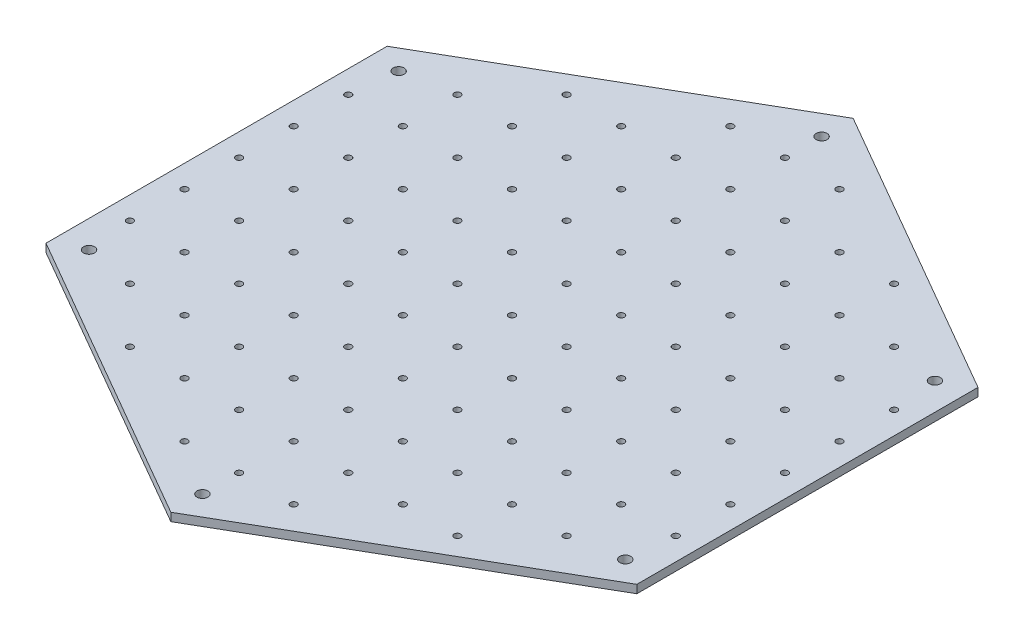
ISO-10303-21;
HEADER;
FILE_DESCRIPTION(('STEP AP214'),'2;1');
FILE_NAME('part.step','',(''),(''),'','','');
FILE_SCHEMA(('AUTOMOTIVE_DESIGN { 1 0 10303 214 1 1 1 1 }'));
ENDSEC;
DATA;
#1=APPLICATION_CONTEXT('core data for automotive mechanical design processes');
#2=APPLICATION_PROTOCOL_DEFINITION('international standard','automotive_design',2000,#1);
#3=PRODUCT_CONTEXT('',#1,'mechanical');
#4=PRODUCT('Part','Part','',(#3));
#5=PRODUCT_RELATED_PRODUCT_CATEGORY('part','',(#4));
#6=PRODUCT_DEFINITION_FORMATION('','',#4);
#7=PRODUCT_DEFINITION_CONTEXT('part definition',#1,'design');
#8=PRODUCT_DEFINITION('design','',#6,#7);
#9=PRODUCT_DEFINITION_SHAPE('','',#8);
#10=(LENGTH_UNIT() NAMED_UNIT(*) SI_UNIT(.MILLI.,.METRE.));
#11=(NAMED_UNIT(*) PLANE_ANGLE_UNIT() SI_UNIT($,.RADIAN.));
#12=(NAMED_UNIT(*) SI_UNIT($,.STERADIAN.) SOLID_ANGLE_UNIT());
#13=UNCERTAINTY_MEASURE_WITH_UNIT(LENGTH_MEASURE(1.E-05),#10,'distance_accuracy_value','');
#14=(GEOMETRIC_REPRESENTATION_CONTEXT(3) GLOBAL_UNCERTAINTY_ASSIGNED_CONTEXT((#13)) GLOBAL_UNIT_ASSIGNED_CONTEXT((#10,
#11,#12)) REPRESENTATION_CONTEXT('',''));
#15=CARTESIAN_POINT('',(0.,0.,0.));
#16=DIRECTION('',(0.,0.,1.));
#17=DIRECTION('',(1.,0.,0.));
#18=AXIS2_PLACEMENT_3D('',#15,#16,#17);
#19=CARTESIAN_POINT('',(0.,1.5,0.));
#20=DIRECTION('',(0.,1.,0.));
#21=DIRECTION('',(0.,0.,1.));
#22=AXIS2_PLACEMENT_3D('',#19,#20,#21);
#23=PLANE('',#22);
#24=DIRECTION('',(0.,0.,1.));
#25=VECTOR('',#24,1.);
#26=CARTESIAN_POINT('',(-54.1265877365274,1.5,-31.25));
#27=LINE('',#26,#25);
#28=CARTESIAN_POINT('',(-54.1265877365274,1.5,-31.25));
#29=VERTEX_POINT('',#28);
#30=CARTESIAN_POINT('',(-54.1265877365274,1.5,31.25));
#31=VERTEX_POINT('',#30);
#32=EDGE_CURVE('E99',#29,#31,#27,.T.);
#33=ORIENTED_EDGE('',*,*,#32,.T.);
#34=DIRECTION('',(0.866025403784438,0.,0.5));
#35=VECTOR('',#34,1.);
#36=CARTESIAN_POINT('',(-54.1265877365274,1.5,31.25));
#37=LINE('',#36,#35);
#38=CARTESIAN_POINT('',(0.,1.5,62.5));
#39=VERTEX_POINT('',#38);
#40=EDGE_CURVE('E93',#31,#39,#37,.T.);
#41=ORIENTED_EDGE('',*,*,#40,.T.);
#42=DIRECTION('',(0.866025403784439,0.,-0.5));
#43=VECTOR('',#42,1.);
#44=CARTESIAN_POINT('',(0.,1.5,62.5));
#45=LINE('',#44,#43);
#46=CARTESIAN_POINT('',(54.1265877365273,1.5,31.25));
#47=VERTEX_POINT('',#46);
#48=EDGE_CURVE('E97',#39,#47,#45,.T.);
#49=ORIENTED_EDGE('',*,*,#48,.T.);
#50=DIRECTION('',(0.,0.,-1.));
#51=VECTOR('',#50,1.);
#52=CARTESIAN_POINT('',(54.1265877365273,1.5,31.25));
#53=LINE('',#52,#51);
#54=CARTESIAN_POINT('',(54.1265877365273,1.5,-31.25));
#55=VERTEX_POINT('',#54);
#56=EDGE_CURVE('E50',#47,#55,#53,.T.);
#57=ORIENTED_EDGE('',*,*,#56,.T.);
#58=DIRECTION('',(-0.866025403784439,0.,-0.5));
#59=VECTOR('',#58,1.);
#60=CARTESIAN_POINT('',(54.1265877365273,1.5,-31.25));
#61=LINE('',#60,#59);
#62=CARTESIAN_POINT('',(0.,1.5,-62.5));
#63=VERTEX_POINT('',#62);
#64=EDGE_CURVE('E85',#55,#63,#61,.T.);
#65=ORIENTED_EDGE('',*,*,#64,.T.);
#66=DIRECTION('',(-0.866025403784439,0.,0.5));
#67=VECTOR('',#66,1.);
#68=CARTESIAN_POINT('',(0.,1.5,-62.5));
#69=LINE('',#68,#67);
#70=EDGE_CURVE('E832',#63,#29,#69,.T.);
#71=ORIENTED_EDGE('',*,*,#70,.T.);
#72=EDGE_LOOP('',(#33,#41,#49,#57,#65,#71));
#73=FACE_BOUND('',#72,.T.);
#74=CARTESIAN_POINT('',(49.1265877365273,1.5,-28.3632486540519));
#75=DIRECTION('',(0.,1.,0.));
#76=DIRECTION('',(0.,0.,1.));
#77=AXIS2_PLACEMENT_3D('',#74,#75,#76);
#78=CIRCLE('',#77,0.999999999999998);
#79=CARTESIAN_POINT('',(49.1265877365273,1.5,-27.3632486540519));
#80=VERTEX_POINT('',#79);
#81=EDGE_CURVE('E2065',#80,#80,#78,.T.);
#82=ORIENTED_EDGE('',*,*,#81,.F.);
#83=EDGE_LOOP('',(#82));
#84=FACE_BOUND('',#83,.T.);
#85=CARTESIAN_POINT('',(49.1265877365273,1.5,28.3632486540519));
#86=DIRECTION('',(0.,1.,0.));
#87=DIRECTION('',(0.,0.,1.));
#88=AXIS2_PLACEMENT_3D('',#85,#86,#87);
#89=CIRCLE('',#88,0.999999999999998);
#90=CARTESIAN_POINT('',(49.1265877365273,1.5,29.3632486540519));
#91=VERTEX_POINT('',#90);
#92=EDGE_CURVE('E2067',#91,#91,#89,.T.);
#93=ORIENTED_EDGE('',*,*,#92,.F.);
#94=EDGE_LOOP('',(#93));
#95=FACE_BOUND('',#94,.T.);
#96=CARTESIAN_POINT('',(0.,1.5,56.7264973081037));
#97=DIRECTION('',(0.,1.,0.));
#98=DIRECTION('',(0.,0.,1.));
#99=AXIS2_PLACEMENT_3D('',#96,#97,#98);
#100=CIRCLE('',#99,1.);
#101=CARTESIAN_POINT('',(0.,1.5,57.7264973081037));
#102=VERTEX_POINT('',#101);
#103=EDGE_CURVE('E2073',#102,#102,#100,.T.);
#104=ORIENTED_EDGE('',*,*,#103,.F.);
#105=EDGE_LOOP('',(#104));
#106=FACE_BOUND('',#105,.T.);
#107=CARTESIAN_POINT('',(-49.1265877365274,1.5,28.3632486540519));
#108=DIRECTION('',(0.,1.,0.));
#109=DIRECTION('',(0.,0.,1.));
#110=AXIS2_PLACEMENT_3D('',#107,#108,#109);
#111=CIRCLE('',#110,0.999999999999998);
#112=CARTESIAN_POINT('',(-49.1265877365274,1.5,29.3632486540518));
#113=VERTEX_POINT('',#112);
#114=EDGE_CURVE('E2079',#113,#113,#111,.T.);
#115=ORIENTED_EDGE('',*,*,#114,.F.);
#116=EDGE_LOOP('',(#115));
#117=FACE_BOUND('',#116,.T.);
#118=CARTESIAN_POINT('',(-49.1265877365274,1.5,-28.3632486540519));
#119=DIRECTION('',(0.,1.,0.));
#120=DIRECTION('',(0.,0.,1.));
#121=AXIS2_PLACEMENT_3D('',#118,#119,#120);
#122=CIRCLE('',#121,0.999999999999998);
#123=CARTESIAN_POINT('',(-49.1265877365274,1.5,-27.3632486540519));
#124=VERTEX_POINT('',#123);
#125=EDGE_CURVE('E2085',#124,#124,#122,.T.);
#126=ORIENTED_EDGE('',*,*,#125,.F.);
#127=EDGE_LOOP('',(#126));
#128=FACE_BOUND('',#127,.T.);
#129=CARTESIAN_POINT('',(0.,1.5,-56.7264973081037));
#130=DIRECTION('',(0.,1.,0.));
#131=DIRECTION('',(0.,0.,1.));
#132=AXIS2_PLACEMENT_3D('',#129,#130,#131);
#133=CIRCLE('',#132,1.);
#134=CARTESIAN_POINT('',(0.,1.5,-55.7264973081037));
#135=VERTEX_POINT('',#134);
#136=EDGE_CURVE('E2091',#135,#135,#133,.T.);
#137=ORIENTED_EDGE('',*,*,#136,.F.);
#138=EDGE_LOOP('',(#137));
#139=FACE_BOUND('',#138,.T.);
#140=CARTESIAN_POINT('',(-10.,1.5,-50.));
#141=DIRECTION('',(0.,-1.,0.));
#142=DIRECTION('',(0.,0.,-1.));
#143=AXIS2_PLACEMENT_3D('',#140,#141,#142);
#144=CIRCLE('',#143,0.6);
#145=CARTESIAN_POINT('',(-10.,1.5,-50.6));
#146=VERTEX_POINT('',#145);
#147=EDGE_CURVE('E2097',#146,#146,#144,.T.);
#148=ORIENTED_EDGE('',*,*,#147,.T.);
#149=EDGE_LOOP('',(#148));
#150=FACE_BOUND('',#149,.T.);
#151=CARTESIAN_POINT('',(-30.,1.5,-40.));
#152=DIRECTION('',(0.,-1.,0.));
#153=DIRECTION('',(0.,0.,-1.));
#154=AXIS2_PLACEMENT_3D('',#151,#152,#153);
#155=CIRCLE('',#154,0.6);
#156=CARTESIAN_POINT('',(-30.,1.5,-40.6));
#157=VERTEX_POINT('',#156);
#158=EDGE_CURVE('E441',#157,#157,#155,.T.);
#159=ORIENTED_EDGE('',*,*,#158,.T.);
#160=EDGE_LOOP('',(#159));
#161=FACE_BOUND('',#160,.T.);
#162=CARTESIAN_POINT('',(-10.,1.5,-40.));
#163=DIRECTION('',(0.,-1.,0.));
#164=DIRECTION('',(0.,0.,-1.));
#165=AXIS2_PLACEMENT_3D('',#162,#163,#164);
#166=CIRCLE('',#165,0.6);
#167=CARTESIAN_POINT('',(-10.,1.5,-40.6));
#168=VERTEX_POINT('',#167);
#169=EDGE_CURVE('E438',#168,#168,#166,.T.);
#170=ORIENTED_EDGE('',*,*,#169,.T.);
#171=EDGE_LOOP('',(#170));
#172=FACE_BOUND('',#171,.T.);
#173=CARTESIAN_POINT('',(-40.,1.5,-30.));
#174=DIRECTION('',(0.,-1.,0.));
#175=DIRECTION('',(0.,0.,-1.));
#176=AXIS2_PLACEMENT_3D('',#173,#174,#175);
#177=CIRCLE('',#176,0.6);
#178=CARTESIAN_POINT('',(-40.,1.5,-30.6));
#179=VERTEX_POINT('',#178);
#180=EDGE_CURVE('E448',#179,#179,#177,.T.);
#181=ORIENTED_EDGE('',*,*,#180,.T.);
#182=EDGE_LOOP('',(#181));
#183=FACE_BOUND('',#182,.T.);
#184=CARTESIAN_POINT('',(-20.,1.5,-30.));
#185=DIRECTION('',(0.,-1.,0.));
#186=DIRECTION('',(0.,0.,-1.));
#187=AXIS2_PLACEMENT_3D('',#184,#185,#186);
#188=CIRCLE('',#187,0.6);
#189=CARTESIAN_POINT('',(-20.,1.5,-30.6));
#190=VERTEX_POINT('',#189);
#191=EDGE_CURVE('E459',#190,#190,#188,.T.);
#192=ORIENTED_EDGE('',*,*,#191,.T.);
#193=EDGE_LOOP('',(#192));
#194=FACE_BOUND('',#193,.T.);
#195=CARTESIAN_POINT('',(-50.,1.5,-20.));
#196=DIRECTION('',(0.,-1.,0.));
#197=DIRECTION('',(0.,0.,-1.));
#198=AXIS2_PLACEMENT_3D('',#195,#196,#197);
#199=CIRCLE('',#198,0.6);
#200=CARTESIAN_POINT('',(-50.,1.5,-20.6));
#201=VERTEX_POINT('',#200);
#202=EDGE_CURVE('E469',#201,#201,#199,.T.);
#203=ORIENTED_EDGE('',*,*,#202,.T.);
#204=EDGE_LOOP('',(#203));
#205=FACE_BOUND('',#204,.T.);
#206=CARTESIAN_POINT('',(-30.,1.5,-20.));
#207=DIRECTION('',(0.,-1.,0.));
#208=DIRECTION('',(0.,0.,-1.));
#209=AXIS2_PLACEMENT_3D('',#206,#207,#208);
#210=CIRCLE('',#209,0.6);
#211=CARTESIAN_POINT('',(-30.,1.5,-20.6));
#212=VERTEX_POINT('',#211);
#213=EDGE_CURVE('E479',#212,#212,#210,.T.);
#214=ORIENTED_EDGE('',*,*,#213,.T.);
#215=EDGE_LOOP('',(#214));
#216=FACE_BOUND('',#215,.T.);
#217=CARTESIAN_POINT('',(-10.,1.5,-20.));
#218=DIRECTION('',(0.,-1.,0.));
#219=DIRECTION('',(0.,0.,-1.));
#220=AXIS2_PLACEMENT_3D('',#217,#218,#219);
#221=CIRCLE('',#220,0.6);
#222=CARTESIAN_POINT('',(-10.,1.5,-20.6));
#223=VERTEX_POINT('',#222);
#224=EDGE_CURVE('E489',#223,#223,#221,.T.);
#225=ORIENTED_EDGE('',*,*,#224,.T.);
#226=EDGE_LOOP('',(#225));
#227=FACE_BOUND('',#226,.T.);
#228=CARTESIAN_POINT('',(-40.,1.5,-9.99999999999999));
#229=DIRECTION('',(0.,-1.,0.));
#230=DIRECTION('',(0.,0.,-1.));
#231=AXIS2_PLACEMENT_3D('',#228,#229,#230);
#232=CIRCLE('',#231,0.6);
#233=CARTESIAN_POINT('',(-40.,1.5,-10.6));
#234=VERTEX_POINT('',#233);
#235=EDGE_CURVE('E499',#234,#234,#232,.T.);
#236=ORIENTED_EDGE('',*,*,#235,.T.);
#237=EDGE_LOOP('',(#236));
#238=FACE_BOUND('',#237,.T.);
#239=CARTESIAN_POINT('',(-20.,1.5,-10.));
#240=DIRECTION('',(0.,-1.,0.));
#241=DIRECTION('',(0.,0.,-1.));
#242=AXIS2_PLACEMENT_3D('',#239,#240,#241);
#243=CIRCLE('',#242,0.6);
#244=CARTESIAN_POINT('',(-20.,1.5,-10.6));
#245=VERTEX_POINT('',#244);
#246=EDGE_CURVE('E509',#245,#245,#243,.T.);
#247=ORIENTED_EDGE('',*,*,#246,.T.);
#248=EDGE_LOOP('',(#247));
#249=FACE_BOUND('',#248,.T.);
#250=CARTESIAN_POINT('',(10.,1.5,50.));
#251=DIRECTION('',(0.,-1.,0.));
#252=DIRECTION('',(0.,0.,1.));
#253=AXIS2_PLACEMENT_3D('',#250,#251,#252);
#254=CIRCLE('',#253,0.6);
#255=CARTESIAN_POINT('',(10.,1.5,50.6));
#256=VERTEX_POINT('',#255);
#257=EDGE_CURVE('E683',#256,#256,#254,.T.);
#258=ORIENTED_EDGE('',*,*,#257,.T.);
#259=EDGE_LOOP('',(#258));
#260=FACE_BOUND('',#259,.T.);
#261=CARTESIAN_POINT('',(20.,1.5,40.));
#262=DIRECTION('',(0.,-1.,0.));
#263=DIRECTION('',(0.,0.,1.));
#264=AXIS2_PLACEMENT_3D('',#261,#262,#263);
#265=CIRCLE('',#264,0.6);
#266=CARTESIAN_POINT('',(20.,1.5,40.6));
#267=VERTEX_POINT('',#266);
#268=EDGE_CURVE('E697',#267,#267,#265,.T.);
#269=ORIENTED_EDGE('',*,*,#268,.T.);
#270=EDGE_LOOP('',(#269));
#271=FACE_BOUND('',#270,.T.);
#272=CARTESIAN_POINT('',(0.,1.5,40.));
#273=DIRECTION('',(0.,-1.,0.));
#274=DIRECTION('',(0.,0.,1.));
#275=AXIS2_PLACEMENT_3D('',#272,#273,#274);
#276=CIRCLE('',#275,0.6);
#277=CARTESIAN_POINT('',(0.,1.5,40.6));
#278=VERTEX_POINT('',#277);
#279=EDGE_CURVE('E707',#278,#278,#276,.T.);
#280=ORIENTED_EDGE('',*,*,#279,.T.);
#281=EDGE_LOOP('',(#280));
#282=FACE_BOUND('',#281,.T.);
#283=CARTESIAN_POINT('',(40.,1.5,30.));
#284=DIRECTION('',(0.,-1.,0.));
#285=DIRECTION('',(0.,0.,1.));
#286=AXIS2_PLACEMENT_3D('',#283,#284,#285);
#287=CIRCLE('',#286,0.6);
#288=CARTESIAN_POINT('',(40.,1.5,30.6));
#289=VERTEX_POINT('',#288);
#290=EDGE_CURVE('E712',#289,#289,#287,.T.);
#291=ORIENTED_EDGE('',*,*,#290,.T.);
#292=EDGE_LOOP('',(#291));
#293=FACE_BOUND('',#292,.T.);
#294=CARTESIAN_POINT('',(20.,1.5,30.));
#295=DIRECTION('',(0.,-1.,0.));
#296=DIRECTION('',(0.,0.,1.));
#297=AXIS2_PLACEMENT_3D('',#294,#295,#296);
#298=CIRCLE('',#297,0.6);
#299=CARTESIAN_POINT('',(20.,1.5,30.6));
#300=VERTEX_POINT('',#299);
#301=EDGE_CURVE('E723',#300,#300,#298,.T.);
#302=ORIENTED_EDGE('',*,*,#301,.T.);
#303=EDGE_LOOP('',(#302));
#304=FACE_BOUND('',#303,.T.);
#305=CARTESIAN_POINT('',(0.,1.5,30.));
#306=DIRECTION('',(0.,-1.,0.));
#307=DIRECTION('',(0.,0.,1.));
#308=AXIS2_PLACEMENT_3D('',#305,#306,#307);
#309=CIRCLE('',#308,0.6);
#310=CARTESIAN_POINT('',(0.,1.5,30.6));
#311=VERTEX_POINT('',#310);
#312=EDGE_CURVE('E733',#311,#311,#309,.T.);
#313=ORIENTED_EDGE('',*,*,#312,.T.);
#314=EDGE_LOOP('',(#313));
#315=FACE_BOUND('',#314,.T.);
#316=CARTESIAN_POINT('',(40.,1.5,20.));
#317=DIRECTION('',(0.,-1.,0.));
#318=DIRECTION('',(0.,0.,1.));
#319=AXIS2_PLACEMENT_3D('',#316,#317,#318);
#320=CIRCLE('',#319,0.6);
#321=CARTESIAN_POINT('',(40.,1.5,20.6));
#322=VERTEX_POINT('',#321);
#323=EDGE_CURVE('E743',#322,#322,#320,.T.);
#324=ORIENTED_EDGE('',*,*,#323,.T.);
#325=EDGE_LOOP('',(#324));
#326=FACE_BOUND('',#325,.T.);
#327=CARTESIAN_POINT('',(20.,1.5,20.));
#328=DIRECTION('',(0.,-1.,0.));
#329=DIRECTION('',(0.,0.,1.));
#330=AXIS2_PLACEMENT_3D('',#327,#328,#329);
#331=CIRCLE('',#330,0.6);
#332=CARTESIAN_POINT('',(20.,1.5,20.6));
#333=VERTEX_POINT('',#332);
#334=EDGE_CURVE('E753',#333,#333,#331,.T.);
#335=ORIENTED_EDGE('',*,*,#334,.T.);
#336=EDGE_LOOP('',(#335));
#337=FACE_BOUND('',#336,.T.);
#338=CARTESIAN_POINT('',(0.,1.5,20.));
#339=DIRECTION('',(0.,-1.,0.));
#340=DIRECTION('',(0.,0.,1.));
#341=AXIS2_PLACEMENT_3D('',#338,#339,#340);
#342=CIRCLE('',#341,0.6);
#343=CARTESIAN_POINT('',(0.,1.5,20.6));
#344=VERTEX_POINT('',#343);
#345=EDGE_CURVE('E763',#344,#344,#342,.T.);
#346=ORIENTED_EDGE('',*,*,#345,.T.);
#347=EDGE_LOOP('',(#346));
#348=FACE_BOUND('',#347,.T.);
#349=CARTESIAN_POINT('',(40.,1.5,10.));
#350=DIRECTION('',(0.,-1.,0.));
#351=DIRECTION('',(0.,0.,1.));
#352=AXIS2_PLACEMENT_3D('',#349,#350,#351);
#353=CIRCLE('',#352,0.6);
#354=CARTESIAN_POINT('',(40.,1.5,10.6));
#355=VERTEX_POINT('',#354);
#356=EDGE_CURVE('E773',#355,#355,#353,.T.);
#357=ORIENTED_EDGE('',*,*,#356,.T.);
#358=EDGE_LOOP('',(#357));
#359=FACE_BOUND('',#358,.T.);
#360=CARTESIAN_POINT('',(20.,1.5,10.));
#361=DIRECTION('',(0.,-1.,0.));
#362=DIRECTION('',(0.,0.,1.));
#363=AXIS2_PLACEMENT_3D('',#360,#361,#362);
#364=CIRCLE('',#363,0.6);
#365=CARTESIAN_POINT('',(20.,1.5,10.6));
#366=VERTEX_POINT('',#365);
#367=EDGE_CURVE('E783',#366,#366,#364,.T.);
#368=ORIENTED_EDGE('',*,*,#367,.T.);
#369=EDGE_LOOP('',(#368));
#370=FACE_BOUND('',#369,.T.);
#371=CARTESIAN_POINT('',(0.,1.5,10.));
#372=DIRECTION('',(0.,-1.,0.));
#373=DIRECTION('',(0.,0.,1.));
#374=AXIS2_PLACEMENT_3D('',#371,#372,#373);
#375=CIRCLE('',#374,0.6);
#376=CARTESIAN_POINT('',(0.,1.5,10.6));
#377=VERTEX_POINT('',#376);
#378=EDGE_CURVE('E793',#377,#377,#375,.T.);
#379=ORIENTED_EDGE('',*,*,#378,.T.);
#380=EDGE_LOOP('',(#379));
#381=FACE_BOUND('',#380,.T.);
#382=CARTESIAN_POINT('',(40.,1.5,0.));
#383=DIRECTION('',(0.,-1.,0.));
#384=DIRECTION('',(0.,0.,1.));
#385=AXIS2_PLACEMENT_3D('',#382,#383,#384);
#386=CIRCLE('',#385,0.6);
#387=CARTESIAN_POINT('',(40.,1.5,0.599999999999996));
#388=VERTEX_POINT('',#387);
#389=EDGE_CURVE('E803',#388,#388,#386,.T.);
#390=ORIENTED_EDGE('',*,*,#389,.T.);
#391=EDGE_LOOP('',(#390));
#392=FACE_BOUND('',#391,.T.);
#393=CARTESIAN_POINT('',(20.,1.5,0.));
#394=DIRECTION('',(0.,-1.,0.));
#395=DIRECTION('',(0.,0.,1.));
#396=AXIS2_PLACEMENT_3D('',#393,#394,#395);
#397=CIRCLE('',#396,0.6);
#398=CARTESIAN_POINT('',(20.,1.5,0.599999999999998));
#399=VERTEX_POINT('',#398);
#400=EDGE_CURVE('E813',#399,#399,#397,.T.);
#401=ORIENTED_EDGE('',*,*,#400,.T.);
#402=EDGE_LOOP('',(#401));
#403=FACE_BOUND('',#402,.T.);
#404=CARTESIAN_POINT('',(-50.,1.5,0.));
#405=DIRECTION('',(0.,1.,0.));
#406=DIRECTION('',(0.,0.,1.));
#407=AXIS2_PLACEMENT_3D('',#404,#405,#406);
#408=CIRCLE('',#407,0.6);
#409=CARTESIAN_POINT('',(-50.,1.5,0.59999999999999));
#410=VERTEX_POINT('',#409);
#411=EDGE_CURVE('E11',#410,#410,#408,.T.);
#412=ORIENTED_EDGE('',*,*,#411,.F.);
#413=EDGE_LOOP('',(#412));
#414=FACE_BOUND('',#413,.T.);
#415=CARTESIAN_POINT('',(-40.,1.5,0.));
#416=DIRECTION('',(0.,1.,0.));
#417=DIRECTION('',(0.,0.,1.));
#418=AXIS2_PLACEMENT_3D('',#415,#416,#417);
#419=CIRCLE('',#418,0.6);
#420=CARTESIAN_POINT('',(-40.,1.5,0.599999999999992));
#421=VERTEX_POINT('',#420);
#422=EDGE_CURVE('E151',#421,#421,#419,.T.);
#423=ORIENTED_EDGE('',*,*,#422,.F.);
#424=EDGE_LOOP('',(#423));
#425=FACE_BOUND('',#424,.T.);
#426=CARTESIAN_POINT('',(-30.,1.5,0.));
#427=DIRECTION('',(0.,1.,0.));
#428=DIRECTION('',(0.,0.,1.));
#429=AXIS2_PLACEMENT_3D('',#426,#427,#428);
#430=CIRCLE('',#429,0.6);
#431=CARTESIAN_POINT('',(-30.,1.5,0.599999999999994));
#432=VERTEX_POINT('',#431);
#433=EDGE_CURVE('E145',#432,#432,#430,.T.);
#434=ORIENTED_EDGE('',*,*,#433,.F.);
#435=EDGE_LOOP('',(#434));
#436=FACE_BOUND('',#435,.T.);
#437=CARTESIAN_POINT('',(-20.,1.5,0.));
#438=DIRECTION('',(0.,1.,0.));
#439=DIRECTION('',(0.,0.,1.));
#440=AXIS2_PLACEMENT_3D('',#437,#438,#439);
#441=CIRCLE('',#440,0.6);
#442=CARTESIAN_POINT('',(-20.,1.5,0.599999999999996));
#443=VERTEX_POINT('',#442);
#444=EDGE_CURVE('E139',#443,#443,#441,.T.);
#445=ORIENTED_EDGE('',*,*,#444,.F.);
#446=EDGE_LOOP('',(#445));
#447=FACE_BOUND('',#446,.T.);
#448=CARTESIAN_POINT('',(0.,1.5,0.));
#449=DIRECTION('',(0.,1.,0.));
#450=DIRECTION('',(0.,0.,1.));
#451=AXIS2_PLACEMENT_3D('',#448,#449,#450);
#452=CIRCLE('',#451,0.6);
#453=CARTESIAN_POINT('',(0.,1.5,0.6));
#454=VERTEX_POINT('',#453);
#455=EDGE_CURVE('E177',#454,#454,#452,.T.);
#456=ORIENTED_EDGE('',*,*,#455,.F.);
#457=EDGE_LOOP('',(#456));
#458=FACE_BOUND('',#457,.T.);
#459=CARTESIAN_POINT('',(-10.,1.5,0.));
#460=DIRECTION('',(0.,1.,0.));
#461=DIRECTION('',(0.,0.,1.));
#462=AXIS2_PLACEMENT_3D('',#459,#460,#461);
#463=CIRCLE('',#462,0.6);
#464=CARTESIAN_POINT('',(-10.,1.5,0.599999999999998));
#465=VERTEX_POINT('',#464);
#466=EDGE_CURVE('E181',#465,#465,#463,.T.);
#467=ORIENTED_EDGE('',*,*,#466,.F.);
#468=EDGE_LOOP('',(#467));
#469=FACE_BOUND('',#468,.T.);
#470=CARTESIAN_POINT('',(10.,1.5,0.));
#471=DIRECTION('',(0.,-1.,0.));
#472=DIRECTION('',(0.,0.,1.));
#473=AXIS2_PLACEMENT_3D('',#470,#471,#472);
#474=CIRCLE('',#473,0.6);
#475=CARTESIAN_POINT('',(10.,1.5,0.599999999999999));
#476=VERTEX_POINT('',#475);
#477=EDGE_CURVE('E185',#476,#476,#474,.T.);
#478=ORIENTED_EDGE('',*,*,#477,.T.);
#479=EDGE_LOOP('',(#478));
#480=FACE_BOUND('',#479,.T.);
#481=CARTESIAN_POINT('',(30.,1.5,0.));
#482=DIRECTION('',(0.,-1.,0.));
#483=DIRECTION('',(0.,0.,1.));
#484=AXIS2_PLACEMENT_3D('',#481,#482,#483);
#485=CIRCLE('',#484,0.6);
#486=CARTESIAN_POINT('',(30.,1.5,0.599999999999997));
#487=VERTEX_POINT('',#486);
#488=EDGE_CURVE('E189',#487,#487,#485,.T.);
#489=ORIENTED_EDGE('',*,*,#488,.T.);
#490=EDGE_LOOP('',(#489));
#491=FACE_BOUND('',#490,.T.);
#492=CARTESIAN_POINT('',(50.,1.5,0.));
#493=DIRECTION('',(0.,-1.,0.));
#494=DIRECTION('',(0.,0.,1.));
#495=AXIS2_PLACEMENT_3D('',#492,#493,#494);
#496=CIRCLE('',#495,0.6);
#497=CARTESIAN_POINT('',(50.,1.5,0.599999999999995));
#498=VERTEX_POINT('',#497);
#499=EDGE_CURVE('E193',#498,#498,#496,.T.);
#500=ORIENTED_EDGE('',*,*,#499,.T.);
#501=EDGE_LOOP('',(#500));
#502=FACE_BOUND('',#501,.T.);
#503=CARTESIAN_POINT('',(10.,1.5,10.));
#504=DIRECTION('',(0.,-1.,0.));
#505=DIRECTION('',(0.,0.,1.));
#506=AXIS2_PLACEMENT_3D('',#503,#504,#505);
#507=CIRCLE('',#506,0.6);
#508=CARTESIAN_POINT('',(10.,1.5,10.6));
#509=VERTEX_POINT('',#508);
#510=EDGE_CURVE('E197',#509,#509,#507,.T.);
#511=ORIENTED_EDGE('',*,*,#510,.T.);
#512=EDGE_LOOP('',(#511));
#513=FACE_BOUND('',#512,.T.);
#514=CARTESIAN_POINT('',(30.,1.5,10.));
#515=DIRECTION('',(0.,-1.,0.));
#516=DIRECTION('',(0.,0.,1.));
#517=AXIS2_PLACEMENT_3D('',#514,#515,#516);
#518=CIRCLE('',#517,0.6);
#519=CARTESIAN_POINT('',(30.,1.5,10.6));
#520=VERTEX_POINT('',#519);
#521=EDGE_CURVE('E201',#520,#520,#518,.T.);
#522=ORIENTED_EDGE('',*,*,#521,.T.);
#523=EDGE_LOOP('',(#522));
#524=FACE_BOUND('',#523,.T.);
#525=CARTESIAN_POINT('',(50.,1.5,9.99999999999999));
#526=DIRECTION('',(0.,-1.,0.));
#527=DIRECTION('',(0.,0.,1.));
#528=AXIS2_PLACEMENT_3D('',#525,#526,#527);
#529=CIRCLE('',#528,0.6);
#530=CARTESIAN_POINT('',(50.,1.5,10.6));
#531=VERTEX_POINT('',#530);
#532=EDGE_CURVE('E205',#531,#531,#529,.T.);
#533=ORIENTED_EDGE('',*,*,#532,.T.);
#534=EDGE_LOOP('',(#533));
#535=FACE_BOUND('',#534,.T.);
#536=CARTESIAN_POINT('',(10.,1.5,20.));
#537=DIRECTION('',(0.,-1.,0.));
#538=DIRECTION('',(0.,0.,1.));
#539=AXIS2_PLACEMENT_3D('',#536,#537,#538);
#540=CIRCLE('',#539,0.6);
#541=CARTESIAN_POINT('',(10.,1.5,20.6));
#542=VERTEX_POINT('',#541);
#543=EDGE_CURVE('E209',#542,#542,#540,.T.);
#544=ORIENTED_EDGE('',*,*,#543,.T.);
#545=EDGE_LOOP('',(#544));
#546=FACE_BOUND('',#545,.T.);
#547=CARTESIAN_POINT('',(30.,1.5,20.));
#548=DIRECTION('',(0.,-1.,0.));
#549=DIRECTION('',(0.,0.,1.));
#550=AXIS2_PLACEMENT_3D('',#547,#548,#549);
#551=CIRCLE('',#550,0.6);
#552=CARTESIAN_POINT('',(30.,1.5,20.6));
#553=VERTEX_POINT('',#552);
#554=EDGE_CURVE('E213',#553,#553,#551,.T.);
#555=ORIENTED_EDGE('',*,*,#554,.T.);
#556=EDGE_LOOP('',(#555));
#557=FACE_BOUND('',#556,.T.);
#558=CARTESIAN_POINT('',(50.,1.5,20.));
#559=DIRECTION('',(0.,-1.,0.));
#560=DIRECTION('',(0.,0.,1.));
#561=AXIS2_PLACEMENT_3D('',#558,#559,#560);
#562=CIRCLE('',#561,0.6);
#563=CARTESIAN_POINT('',(50.,1.5,20.6));
#564=VERTEX_POINT('',#563);
#565=EDGE_CURVE('E217',#564,#564,#562,.T.);
#566=ORIENTED_EDGE('',*,*,#565,.T.);
#567=EDGE_LOOP('',(#566));
#568=FACE_BOUND('',#567,.T.);
#569=CARTESIAN_POINT('',(10.,1.5,30.));
#570=DIRECTION('',(0.,-1.,0.));
#571=DIRECTION('',(0.,0.,1.));
#572=AXIS2_PLACEMENT_3D('',#569,#570,#571);
#573=CIRCLE('',#572,0.6);
#574=CARTESIAN_POINT('',(10.,1.5,30.6));
#575=VERTEX_POINT('',#574);
#576=EDGE_CURVE('E221',#575,#575,#573,.T.);
#577=ORIENTED_EDGE('',*,*,#576,.T.);
#578=EDGE_LOOP('',(#577));
#579=FACE_BOUND('',#578,.T.);
#580=CARTESIAN_POINT('',(30.,1.5,30.));
#581=DIRECTION('',(0.,-1.,0.));
#582=DIRECTION('',(0.,0.,1.));
#583=AXIS2_PLACEMENT_3D('',#580,#581,#582);
#584=CIRCLE('',#583,0.6);
#585=CARTESIAN_POINT('',(30.,1.5,30.6));
#586=VERTEX_POINT('',#585);
#587=EDGE_CURVE('E225',#586,#586,#584,.T.);
#588=ORIENTED_EDGE('',*,*,#587,.T.);
#589=EDGE_LOOP('',(#588));
#590=FACE_BOUND('',#589,.T.);
#591=CARTESIAN_POINT('',(10.,1.5,40.));
#592=DIRECTION('',(0.,-1.,0.));
#593=DIRECTION('',(0.,0.,1.));
#594=AXIS2_PLACEMENT_3D('',#591,#592,#593);
#595=CIRCLE('',#594,0.6);
#596=CARTESIAN_POINT('',(10.,1.5,40.6));
#597=VERTEX_POINT('',#596);
#598=EDGE_CURVE('E229',#597,#597,#595,.T.);
#599=ORIENTED_EDGE('',*,*,#598,.T.);
#600=EDGE_LOOP('',(#599));
#601=FACE_BOUND('',#600,.T.);
#602=CARTESIAN_POINT('',(30.,1.5,40.));
#603=DIRECTION('',(0.,-1.,0.));
#604=DIRECTION('',(0.,0.,1.));
#605=AXIS2_PLACEMENT_3D('',#602,#603,#604);
#606=CIRCLE('',#605,0.6);
#607=CARTESIAN_POINT('',(30.,1.5,40.6));
#608=VERTEX_POINT('',#607);
#609=EDGE_CURVE('E233',#608,#608,#606,.T.);
#610=ORIENTED_EDGE('',*,*,#609,.T.);
#611=EDGE_LOOP('',(#610));
#612=FACE_BOUND('',#611,.T.);
#613=CARTESIAN_POINT('',(0.,1.5,50.));
#614=DIRECTION('',(0.,-1.,0.));
#615=DIRECTION('',(0.,0.,1.));
#616=AXIS2_PLACEMENT_3D('',#613,#614,#615);
#617=CIRCLE('',#616,0.6);
#618=CARTESIAN_POINT('',(0.,1.5,50.6));
#619=VERTEX_POINT('',#618);
#620=EDGE_CURVE('E237',#619,#619,#617,.T.);
#621=ORIENTED_EDGE('',*,*,#620,.T.);
#622=EDGE_LOOP('',(#621));
#623=FACE_BOUND('',#622,.T.);
#624=CARTESIAN_POINT('',(-10.,1.5,10.));
#625=DIRECTION('',(0.,1.,0.));
#626=DIRECTION('',(0.,0.,1.));
#627=AXIS2_PLACEMENT_3D('',#624,#625,#626);
#628=CIRCLE('',#627,0.6);
#629=CARTESIAN_POINT('',(-10.,1.5,10.6));
#630=VERTEX_POINT('',#629);
#631=EDGE_CURVE('E241',#630,#630,#628,.T.);
#632=ORIENTED_EDGE('',*,*,#631,.F.);
#633=EDGE_LOOP('',(#632));
#634=FACE_BOUND('',#633,.T.);
#635=CARTESIAN_POINT('',(-20.,1.5,10.));
#636=DIRECTION('',(0.,1.,0.));
#637=DIRECTION('',(0.,0.,1.));
#638=AXIS2_PLACEMENT_3D('',#635,#636,#637);
#639=CIRCLE('',#638,0.6);
#640=CARTESIAN_POINT('',(-20.,1.5,10.6));
#641=VERTEX_POINT('',#640);
#642=EDGE_CURVE('E245',#641,#641,#639,.T.);
#643=ORIENTED_EDGE('',*,*,#642,.F.);
#644=EDGE_LOOP('',(#643));
#645=FACE_BOUND('',#644,.T.);
#646=CARTESIAN_POINT('',(-30.,1.5,9.99999999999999));
#647=DIRECTION('',(0.,1.,0.));
#648=DIRECTION('',(0.,0.,1.));
#649=AXIS2_PLACEMENT_3D('',#646,#647,#648);
#650=CIRCLE('',#649,0.6);
#651=CARTESIAN_POINT('',(-30.,1.5,10.6));
#652=VERTEX_POINT('',#651);
#653=EDGE_CURVE('E249',#652,#652,#650,.T.);
#654=ORIENTED_EDGE('',*,*,#653,.F.);
#655=EDGE_LOOP('',(#654));
#656=FACE_BOUND('',#655,.T.);
#657=CARTESIAN_POINT('',(-40.,1.5,9.99999999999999));
#658=DIRECTION('',(0.,1.,0.));
#659=DIRECTION('',(0.,0.,1.));
#660=AXIS2_PLACEMENT_3D('',#657,#658,#659);
#661=CIRCLE('',#660,0.6);
#662=CARTESIAN_POINT('',(-40.,1.5,10.6));
#663=VERTEX_POINT('',#662);
#664=EDGE_CURVE('E253',#663,#663,#661,.T.);
#665=ORIENTED_EDGE('',*,*,#664,.F.);
#666=EDGE_LOOP('',(#665));
#667=FACE_BOUND('',#666,.T.);
#668=CARTESIAN_POINT('',(-50.,1.5,9.99999999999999));
#669=DIRECTION('',(0.,1.,0.));
#670=DIRECTION('',(0.,0.,1.));
#671=AXIS2_PLACEMENT_3D('',#668,#669,#670);
#672=CIRCLE('',#671,0.6);
#673=CARTESIAN_POINT('',(-50.,1.5,10.6));
#674=VERTEX_POINT('',#673);
#675=EDGE_CURVE('E257',#674,#674,#672,.T.);
#676=ORIENTED_EDGE('',*,*,#675,.F.);
#677=EDGE_LOOP('',(#676));
#678=FACE_BOUND('',#677,.T.);
#679=CARTESIAN_POINT('',(-10.,1.5,20.));
#680=DIRECTION('',(0.,1.,0.));
#681=DIRECTION('',(0.,0.,1.));
#682=AXIS2_PLACEMENT_3D('',#679,#680,#681);
#683=CIRCLE('',#682,0.6);
#684=CARTESIAN_POINT('',(-10.,1.5,20.6));
#685=VERTEX_POINT('',#684);
#686=EDGE_CURVE('E261',#685,#685,#683,.T.);
#687=ORIENTED_EDGE('',*,*,#686,.F.);
#688=EDGE_LOOP('',(#687));
#689=FACE_BOUND('',#688,.T.);
#690=CARTESIAN_POINT('',(-20.,1.5,20.));
#691=DIRECTION('',(0.,1.,0.));
#692=DIRECTION('',(0.,0.,1.));
#693=AXIS2_PLACEMENT_3D('',#690,#691,#692);
#694=CIRCLE('',#693,0.6);
#695=CARTESIAN_POINT('',(-20.,1.5,20.6));
#696=VERTEX_POINT('',#695);
#697=EDGE_CURVE('E265',#696,#696,#694,.T.);
#698=ORIENTED_EDGE('',*,*,#697,.F.);
#699=EDGE_LOOP('',(#698));
#700=FACE_BOUND('',#699,.T.);
#701=CARTESIAN_POINT('',(-30.,1.5,20.));
#702=DIRECTION('',(0.,1.,0.));
#703=DIRECTION('',(0.,0.,1.));
#704=AXIS2_PLACEMENT_3D('',#701,#702,#703);
#705=CIRCLE('',#704,0.6);
#706=CARTESIAN_POINT('',(-30.,1.5,20.6));
#707=VERTEX_POINT('',#706);
#708=EDGE_CURVE('E269',#707,#707,#705,.T.);
#709=ORIENTED_EDGE('',*,*,#708,.F.);
#710=EDGE_LOOP('',(#709));
#711=FACE_BOUND('',#710,.T.);
#712=CARTESIAN_POINT('',(-40.,1.5,20.));
#713=DIRECTION('',(0.,1.,0.));
#714=DIRECTION('',(0.,0.,1.));
#715=AXIS2_PLACEMENT_3D('',#712,#713,#714);
#716=CIRCLE('',#715,0.6);
#717=CARTESIAN_POINT('',(-40.,1.5,20.6));
#718=VERTEX_POINT('',#717);
#719=EDGE_CURVE('E273',#718,#718,#716,.T.);
#720=ORIENTED_EDGE('',*,*,#719,.F.);
#721=EDGE_LOOP('',(#720));
#722=FACE_BOUND('',#721,.T.);
#723=CARTESIAN_POINT('',(-50.,1.5,20.));
#724=DIRECTION('',(0.,1.,0.));
#725=DIRECTION('',(0.,0.,1.));
#726=AXIS2_PLACEMENT_3D('',#723,#724,#725);
#727=CIRCLE('',#726,0.6);
#728=CARTESIAN_POINT('',(-50.,1.5,20.6));
#729=VERTEX_POINT('',#728);
#730=EDGE_CURVE('E277',#729,#729,#727,.T.);
#731=ORIENTED_EDGE('',*,*,#730,.F.);
#732=EDGE_LOOP('',(#731));
#733=FACE_BOUND('',#732,.T.);
#734=CARTESIAN_POINT('',(-10.,1.5,30.));
#735=DIRECTION('',(0.,1.,0.));
#736=DIRECTION('',(0.,0.,1.));
#737=AXIS2_PLACEMENT_3D('',#734,#735,#736);
#738=CIRCLE('',#737,0.6);
#739=CARTESIAN_POINT('',(-10.,1.5,30.6));
#740=VERTEX_POINT('',#739);
#741=EDGE_CURVE('E281',#740,#740,#738,.T.);
#742=ORIENTED_EDGE('',*,*,#741,.F.);
#743=EDGE_LOOP('',(#742));
#744=FACE_BOUND('',#743,.T.);
#745=CARTESIAN_POINT('',(-20.,1.5,30.));
#746=DIRECTION('',(0.,1.,0.));
#747=DIRECTION('',(0.,0.,1.));
#748=AXIS2_PLACEMENT_3D('',#745,#746,#747);
#749=CIRCLE('',#748,0.6);
#750=CARTESIAN_POINT('',(-20.,1.5,30.6));
#751=VERTEX_POINT('',#750);
#752=EDGE_CURVE('E285',#751,#751,#749,.T.);
#753=ORIENTED_EDGE('',*,*,#752,.F.);
#754=EDGE_LOOP('',(#753));
#755=FACE_BOUND('',#754,.T.);
#756=CARTESIAN_POINT('',(-30.,1.5,30.));
#757=DIRECTION('',(0.,1.,0.));
#758=DIRECTION('',(0.,0.,1.));
#759=AXIS2_PLACEMENT_3D('',#756,#757,#758);
#760=CIRCLE('',#759,0.6);
#761=CARTESIAN_POINT('',(-30.,1.5,30.6));
#762=VERTEX_POINT('',#761);
#763=EDGE_CURVE('E289',#762,#762,#760,.T.);
#764=ORIENTED_EDGE('',*,*,#763,.F.);
#765=EDGE_LOOP('',(#764));
#766=FACE_BOUND('',#765,.T.);
#767=CARTESIAN_POINT('',(-40.,1.5,30.));
#768=DIRECTION('',(0.,1.,0.));
#769=DIRECTION('',(0.,0.,1.));
#770=AXIS2_PLACEMENT_3D('',#767,#768,#769);
#771=CIRCLE('',#770,0.6);
#772=CARTESIAN_POINT('',(-40.,1.5,30.6));
#773=VERTEX_POINT('',#772);
#774=EDGE_CURVE('E293',#773,#773,#771,.T.);
#775=ORIENTED_EDGE('',*,*,#774,.F.);
#776=EDGE_LOOP('',(#775));
#777=FACE_BOUND('',#776,.T.);
#778=CARTESIAN_POINT('',(-10.,1.5,40.));
#779=DIRECTION('',(0.,1.,0.));
#780=DIRECTION('',(0.,0.,1.));
#781=AXIS2_PLACEMENT_3D('',#778,#779,#780);
#782=CIRCLE('',#781,0.6);
#783=CARTESIAN_POINT('',(-10.,1.5,40.6));
#784=VERTEX_POINT('',#783);
#785=EDGE_CURVE('E297',#784,#784,#782,.T.);
#786=ORIENTED_EDGE('',*,*,#785,.F.);
#787=EDGE_LOOP('',(#786));
#788=FACE_BOUND('',#787,.T.);
#789=CARTESIAN_POINT('',(-20.,1.5,40.));
#790=DIRECTION('',(0.,1.,0.));
#791=DIRECTION('',(0.,0.,1.));
#792=AXIS2_PLACEMENT_3D('',#789,#790,#791);
#793=CIRCLE('',#792,0.6);
#794=CARTESIAN_POINT('',(-20.,1.5,40.6));
#795=VERTEX_POINT('',#794);
#796=EDGE_CURVE('E301',#795,#795,#793,.T.);
#797=ORIENTED_EDGE('',*,*,#796,.F.);
#798=EDGE_LOOP('',(#797));
#799=FACE_BOUND('',#798,.T.);
#800=CARTESIAN_POINT('',(-30.,1.5,40.));
#801=DIRECTION('',(0.,1.,0.));
#802=DIRECTION('',(0.,0.,1.));
#803=AXIS2_PLACEMENT_3D('',#800,#801,#802);
#804=CIRCLE('',#803,0.6);
#805=CARTESIAN_POINT('',(-30.,1.5,40.6));
#806=VERTEX_POINT('',#805);
#807=EDGE_CURVE('E305',#806,#806,#804,.T.);
#808=ORIENTED_EDGE('',*,*,#807,.F.);
#809=EDGE_LOOP('',(#808));
#810=FACE_BOUND('',#809,.T.);
#811=CARTESIAN_POINT('',(-10.,1.5,50.));
#812=DIRECTION('',(0.,1.,0.));
#813=DIRECTION('',(0.,0.,1.));
#814=AXIS2_PLACEMENT_3D('',#811,#812,#813);
#815=CIRCLE('',#814,0.6);
#816=CARTESIAN_POINT('',(-10.,1.5,50.6));
#817=VERTEX_POINT('',#816);
#818=EDGE_CURVE('E309',#817,#817,#815,.T.);
#819=ORIENTED_EDGE('',*,*,#818,.F.);
#820=EDGE_LOOP('',(#819));
#821=FACE_BOUND('',#820,.T.);
#822=CARTESIAN_POINT('',(0.,1.5,-10.));
#823=DIRECTION('',(0.,1.,0.));
#824=DIRECTION('',(0.,0.,-1.));
#825=AXIS2_PLACEMENT_3D('',#822,#823,#824);
#826=CIRCLE('',#825,0.6);
#827=CARTESIAN_POINT('',(0.,1.5,-10.6));
#828=VERTEX_POINT('',#827);
#829=EDGE_CURVE('E313',#828,#828,#826,.T.);
#830=ORIENTED_EDGE('',*,*,#829,.F.);
#831=EDGE_LOOP('',(#830));
#832=FACE_BOUND('',#831,.T.);
#833=CARTESIAN_POINT('',(10.,1.5,-10.));
#834=DIRECTION('',(0.,1.,0.));
#835=DIRECTION('',(0.,0.,-1.));
#836=AXIS2_PLACEMENT_3D('',#833,#834,#835);
#837=CIRCLE('',#836,0.6);
#838=CARTESIAN_POINT('',(10.,1.5,-10.6));
#839=VERTEX_POINT('',#838);
#840=EDGE_CURVE('E317',#839,#839,#837,.T.);
#841=ORIENTED_EDGE('',*,*,#840,.F.);
#842=EDGE_LOOP('',(#841));
#843=FACE_BOUND('',#842,.T.);
#844=CARTESIAN_POINT('',(20.,1.5,-10.));
#845=DIRECTION('',(0.,1.,0.));
#846=DIRECTION('',(0.,0.,-1.));
#847=AXIS2_PLACEMENT_3D('',#844,#845,#846);
#848=CIRCLE('',#847,0.6);
#849=CARTESIAN_POINT('',(20.,1.5,-10.6));
#850=VERTEX_POINT('',#849);
#851=EDGE_CURVE('E321',#850,#850,#848,.T.);
#852=ORIENTED_EDGE('',*,*,#851,.F.);
#853=EDGE_LOOP('',(#852));
#854=FACE_BOUND('',#853,.T.);
#855=CARTESIAN_POINT('',(30.,1.5,-10.));
#856=DIRECTION('',(0.,1.,0.));
#857=DIRECTION('',(0.,0.,-1.));
#858=AXIS2_PLACEMENT_3D('',#855,#856,#857);
#859=CIRCLE('',#858,0.6);
#860=CARTESIAN_POINT('',(30.,1.5,-10.6));
#861=VERTEX_POINT('',#860);
#862=EDGE_CURVE('E325',#861,#861,#859,.T.);
#863=ORIENTED_EDGE('',*,*,#862,.F.);
#864=EDGE_LOOP('',(#863));
#865=FACE_BOUND('',#864,.T.);
#866=CARTESIAN_POINT('',(40.,1.5,-10.));
#867=DIRECTION('',(0.,1.,0.));
#868=DIRECTION('',(0.,0.,-1.));
#869=AXIS2_PLACEMENT_3D('',#866,#867,#868);
#870=CIRCLE('',#869,0.6);
#871=CARTESIAN_POINT('',(40.,1.5,-10.6));
#872=VERTEX_POINT('',#871);
#873=EDGE_CURVE('E329',#872,#872,#870,.T.);
#874=ORIENTED_EDGE('',*,*,#873,.F.);
#875=EDGE_LOOP('',(#874));
#876=FACE_BOUND('',#875,.T.);
#877=CARTESIAN_POINT('',(50.,1.5,-9.99999999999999));
#878=DIRECTION('',(0.,1.,0.));
#879=DIRECTION('',(0.,0.,-1.));
#880=AXIS2_PLACEMENT_3D('',#877,#878,#879);
#881=CIRCLE('',#880,0.6);
#882=CARTESIAN_POINT('',(50.,1.5,-10.6));
#883=VERTEX_POINT('',#882);
#884=EDGE_CURVE('E333',#883,#883,#881,.T.);
#885=ORIENTED_EDGE('',*,*,#884,.F.);
#886=EDGE_LOOP('',(#885));
#887=FACE_BOUND('',#886,.T.);
#888=CARTESIAN_POINT('',(0.,1.5,-20.));
#889=DIRECTION('',(0.,1.,0.));
#890=DIRECTION('',(0.,0.,-1.));
#891=AXIS2_PLACEMENT_3D('',#888,#889,#890);
#892=CIRCLE('',#891,0.6);
#893=CARTESIAN_POINT('',(0.,1.5,-20.6));
#894=VERTEX_POINT('',#893);
#895=EDGE_CURVE('E337',#894,#894,#892,.T.);
#896=ORIENTED_EDGE('',*,*,#895,.F.);
#897=EDGE_LOOP('',(#896));
#898=FACE_BOUND('',#897,.T.);
#899=CARTESIAN_POINT('',(10.,1.5,-20.));
#900=DIRECTION('',(0.,1.,0.));
#901=DIRECTION('',(0.,0.,-1.));
#902=AXIS2_PLACEMENT_3D('',#899,#900,#901);
#903=CIRCLE('',#902,0.6);
#904=CARTESIAN_POINT('',(10.,1.5,-20.6));
#905=VERTEX_POINT('',#904);
#906=EDGE_CURVE('E341',#905,#905,#903,.T.);
#907=ORIENTED_EDGE('',*,*,#906,.F.);
#908=EDGE_LOOP('',(#907));
#909=FACE_BOUND('',#908,.T.);
#910=CARTESIAN_POINT('',(20.,1.5,-20.));
#911=DIRECTION('',(0.,1.,0.));
#912=DIRECTION('',(0.,0.,-1.));
#913=AXIS2_PLACEMENT_3D('',#910,#911,#912);
#914=CIRCLE('',#913,0.6);
#915=CARTESIAN_POINT('',(20.,1.5,-20.6));
#916=VERTEX_POINT('',#915);
#917=EDGE_CURVE('E345',#916,#916,#914,.T.);
#918=ORIENTED_EDGE('',*,*,#917,.F.);
#919=EDGE_LOOP('',(#918));
#920=FACE_BOUND('',#919,.T.);
#921=CARTESIAN_POINT('',(30.,1.5,-20.));
#922=DIRECTION('',(0.,1.,0.));
#923=DIRECTION('',(0.,0.,-1.));
#924=AXIS2_PLACEMENT_3D('',#921,#922,#923);
#925=CIRCLE('',#924,0.6);
#926=CARTESIAN_POINT('',(30.,1.5,-20.6));
#927=VERTEX_POINT('',#926);
#928=EDGE_CURVE('E349',#927,#927,#925,.T.);
#929=ORIENTED_EDGE('',*,*,#928,.F.);
#930=EDGE_LOOP('',(#929));
#931=FACE_BOUND('',#930,.T.);
#932=CARTESIAN_POINT('',(40.,1.5,-20.));
#933=DIRECTION('',(0.,1.,0.));
#934=DIRECTION('',(0.,0.,-1.));
#935=AXIS2_PLACEMENT_3D('',#932,#933,#934);
#936=CIRCLE('',#935,0.6);
#937=CARTESIAN_POINT('',(40.,1.5,-20.6));
#938=VERTEX_POINT('',#937);
#939=EDGE_CURVE('E353',#938,#938,#936,.T.);
#940=ORIENTED_EDGE('',*,*,#939,.F.);
#941=EDGE_LOOP('',(#940));
#942=FACE_BOUND('',#941,.T.);
#943=CARTESIAN_POINT('',(50.,1.5,-20.));
#944=DIRECTION('',(0.,1.,0.));
#945=DIRECTION('',(0.,0.,-1.));
#946=AXIS2_PLACEMENT_3D('',#943,#944,#945);
#947=CIRCLE('',#946,0.6);
#948=CARTESIAN_POINT('',(50.,1.5,-20.6));
#949=VERTEX_POINT('',#948);
#950=EDGE_CURVE('E357',#949,#949,#947,.T.);
#951=ORIENTED_EDGE('',*,*,#950,.F.);
#952=EDGE_LOOP('',(#951));
#953=FACE_BOUND('',#952,.T.);
#954=CARTESIAN_POINT('',(0.,1.5,-30.));
#955=DIRECTION('',(0.,1.,0.));
#956=DIRECTION('',(0.,0.,-1.));
#957=AXIS2_PLACEMENT_3D('',#954,#955,#956);
#958=CIRCLE('',#957,0.6);
#959=CARTESIAN_POINT('',(0.,1.5,-30.6));
#960=VERTEX_POINT('',#959);
#961=EDGE_CURVE('E361',#960,#960,#958,.T.);
#962=ORIENTED_EDGE('',*,*,#961,.F.);
#963=EDGE_LOOP('',(#962));
#964=FACE_BOUND('',#963,.T.);
#965=CARTESIAN_POINT('',(10.,1.5,-30.));
#966=DIRECTION('',(0.,1.,0.));
#967=DIRECTION('',(0.,0.,-1.));
#968=AXIS2_PLACEMENT_3D('',#965,#966,#967);
#969=CIRCLE('',#968,0.6);
#970=CARTESIAN_POINT('',(10.,1.5,-30.6));
#971=VERTEX_POINT('',#970);
#972=EDGE_CURVE('E365',#971,#971,#969,.T.);
#973=ORIENTED_EDGE('',*,*,#972,.F.);
#974=EDGE_LOOP('',(#973));
#975=FACE_BOUND('',#974,.T.);
#976=CARTESIAN_POINT('',(20.,1.5,-30.));
#977=DIRECTION('',(0.,1.,0.));
#978=DIRECTION('',(0.,0.,-1.));
#979=AXIS2_PLACEMENT_3D('',#976,#977,#978);
#980=CIRCLE('',#979,0.6);
#981=CARTESIAN_POINT('',(20.,1.5,-30.6));
#982=VERTEX_POINT('',#981);
#983=EDGE_CURVE('E369',#982,#982,#980,.T.);
#984=ORIENTED_EDGE('',*,*,#983,.F.);
#985=EDGE_LOOP('',(#984));
#986=FACE_BOUND('',#985,.T.);
#987=CARTESIAN_POINT('',(30.,1.5,-30.));
#988=DIRECTION('',(0.,1.,0.));
#989=DIRECTION('',(0.,0.,-1.));
#990=AXIS2_PLACEMENT_3D('',#987,#988,#989);
#991=CIRCLE('',#990,0.6);
#992=CARTESIAN_POINT('',(30.,1.5,-30.6));
#993=VERTEX_POINT('',#992);
#994=EDGE_CURVE('E373',#993,#993,#991,.T.);
#995=ORIENTED_EDGE('',*,*,#994,.F.);
#996=EDGE_LOOP('',(#995));
#997=FACE_BOUND('',#996,.T.);
#998=CARTESIAN_POINT('',(40.,1.5,-30.));
#999=DIRECTION('',(0.,1.,0.));
#1000=DIRECTION('',(0.,0.,-1.));
#1001=AXIS2_PLACEMENT_3D('',#998,#999,#1000);
#1002=CIRCLE('',#1001,0.6);
#1003=CARTESIAN_POINT('',(40.,1.5,-30.6));
#1004=VERTEX_POINT('',#1003);
#1005=EDGE_CURVE('E377',#1004,#1004,#1002,.T.);
#1006=ORIENTED_EDGE('',*,*,#1005,.F.);
#1007=EDGE_LOOP('',(#1006));
#1008=FACE_BOUND('',#1007,.T.);
#1009=CARTESIAN_POINT('',(0.,1.5,-40.));
#1010=DIRECTION('',(0.,1.,0.));
#1011=DIRECTION('',(0.,0.,-1.));
#1012=AXIS2_PLACEMENT_3D('',#1009,#1010,#1011);
#1013=CIRCLE('',#1012,0.6);
#1014=CARTESIAN_POINT('',(0.,1.5,-40.6));
#1015=VERTEX_POINT('',#1014);
#1016=EDGE_CURVE('E381',#1015,#1015,#1013,.T.);
#1017=ORIENTED_EDGE('',*,*,#1016,.F.);
#1018=EDGE_LOOP('',(#1017));
#1019=FACE_BOUND('',#1018,.T.);
#1020=CARTESIAN_POINT('',(10.,1.5,-40.));
#1021=DIRECTION('',(0.,1.,0.));
#1022=DIRECTION('',(0.,0.,-1.));
#1023=AXIS2_PLACEMENT_3D('',#1020,#1021,#1022);
#1024=CIRCLE('',#1023,0.6);
#1025=CARTESIAN_POINT('',(10.,1.5,-40.6));
#1026=VERTEX_POINT('',#1025);
#1027=EDGE_CURVE('E385',#1026,#1026,#1024,.T.);
#1028=ORIENTED_EDGE('',*,*,#1027,.F.);
#1029=EDGE_LOOP('',(#1028));
#1030=FACE_BOUND('',#1029,.T.);
#1031=CARTESIAN_POINT('',(20.,1.5,-40.));
#1032=DIRECTION('',(0.,1.,0.));
#1033=DIRECTION('',(0.,0.,-1.));
#1034=AXIS2_PLACEMENT_3D('',#1031,#1032,#1033);
#1035=CIRCLE('',#1034,0.6);
#1036=CARTESIAN_POINT('',(20.,1.5,-40.6));
#1037=VERTEX_POINT('',#1036);
#1038=EDGE_CURVE('E389',#1037,#1037,#1035,.T.);
#1039=ORIENTED_EDGE('',*,*,#1038,.F.);
#1040=EDGE_LOOP('',(#1039));
#1041=FACE_BOUND('',#1040,.T.);
#1042=CARTESIAN_POINT('',(30.,1.5,-40.));
#1043=DIRECTION('',(0.,1.,0.));
#1044=DIRECTION('',(0.,0.,-1.));
#1045=AXIS2_PLACEMENT_3D('',#1042,#1043,#1044);
#1046=CIRCLE('',#1045,0.6);
#1047=CARTESIAN_POINT('',(30.,1.5,-40.6));
#1048=VERTEX_POINT('',#1047);
#1049=EDGE_CURVE('E393',#1048,#1048,#1046,.T.);
#1050=ORIENTED_EDGE('',*,*,#1049,.F.);
#1051=EDGE_LOOP('',(#1050));
#1052=FACE_BOUND('',#1051,.T.);
#1053=CARTESIAN_POINT('',(0.,1.5,-50.));
#1054=DIRECTION('',(0.,1.,0.));
#1055=DIRECTION('',(0.,0.,-1.));
#1056=AXIS2_PLACEMENT_3D('',#1053,#1054,#1055);
#1057=CIRCLE('',#1056,0.6);
#1058=CARTESIAN_POINT('',(0.,1.5,-50.6));
#1059=VERTEX_POINT('',#1058);
#1060=EDGE_CURVE('E397',#1059,#1059,#1057,.T.);
#1061=ORIENTED_EDGE('',*,*,#1060,.F.);
#1062=EDGE_LOOP('',(#1061));
#1063=FACE_BOUND('',#1062,.T.);
#1064=CARTESIAN_POINT('',(10.,1.5,-50.));
#1065=DIRECTION('',(0.,1.,0.));
#1066=DIRECTION('',(0.,0.,-1.));
#1067=AXIS2_PLACEMENT_3D('',#1064,#1065,#1066);
#1068=CIRCLE('',#1067,0.6);
#1069=CARTESIAN_POINT('',(10.,1.5,-50.6));
#1070=VERTEX_POINT('',#1069);
#1071=EDGE_CURVE('E401',#1070,#1070,#1068,.T.);
#1072=ORIENTED_EDGE('',*,*,#1071,.F.);
#1073=EDGE_LOOP('',(#1072));
#1074=FACE_BOUND('',#1073,.T.);
#1075=CARTESIAN_POINT('',(-10.,1.5,-10.));
#1076=DIRECTION('',(0.,-1.,0.));
#1077=DIRECTION('',(0.,0.,-1.));
#1078=AXIS2_PLACEMENT_3D('',#1075,#1076,#1077);
#1079=CIRCLE('',#1078,0.6);
#1080=CARTESIAN_POINT('',(-10.,1.5,-10.6));
#1081=VERTEX_POINT('',#1080);
#1082=EDGE_CURVE('E405',#1081,#1081,#1079,.T.);
#1083=ORIENTED_EDGE('',*,*,#1082,.T.);
#1084=EDGE_LOOP('',(#1083));
#1085=FACE_BOUND('',#1084,.T.);
#1086=CARTESIAN_POINT('',(-30.,1.5,-9.99999999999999));
#1087=DIRECTION('',(0.,-1.,0.));
#1088=DIRECTION('',(0.,0.,-1.));
#1089=AXIS2_PLACEMENT_3D('',#1086,#1087,#1088);
#1090=CIRCLE('',#1089,0.6);
#1091=CARTESIAN_POINT('',(-30.,1.5,-10.6));
#1092=VERTEX_POINT('',#1091);
#1093=EDGE_CURVE('E409',#1092,#1092,#1090,.T.);
#1094=ORIENTED_EDGE('',*,*,#1093,.T.);
#1095=EDGE_LOOP('',(#1094));
#1096=FACE_BOUND('',#1095,.T.);
#1097=CARTESIAN_POINT('',(-50.,1.5,-9.99999999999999));
#1098=DIRECTION('',(0.,-1.,0.));
#1099=DIRECTION('',(0.,0.,-1.));
#1100=AXIS2_PLACEMENT_3D('',#1097,#1098,#1099);
#1101=CIRCLE('',#1100,0.6);
#1102=CARTESIAN_POINT('',(-50.,1.5,-10.6));
#1103=VERTEX_POINT('',#1102);
#1104=EDGE_CURVE('E413',#1103,#1103,#1101,.T.);
#1105=ORIENTED_EDGE('',*,*,#1104,.T.);
#1106=EDGE_LOOP('',(#1105));
#1107=FACE_BOUND('',#1106,.T.);
#1108=CARTESIAN_POINT('',(-20.,1.5,-20.));
#1109=DIRECTION('',(0.,-1.,0.));
#1110=DIRECTION('',(0.,0.,-1.));
#1111=AXIS2_PLACEMENT_3D('',#1108,#1109,#1110);
#1112=CIRCLE('',#1111,0.6);
#1113=CARTESIAN_POINT('',(-20.,1.5,-20.6));
#1114=VERTEX_POINT('',#1113);
#1115=EDGE_CURVE('E417',#1114,#1114,#1112,.T.);
#1116=ORIENTED_EDGE('',*,*,#1115,.T.);
#1117=EDGE_LOOP('',(#1116));
#1118=FACE_BOUND('',#1117,.T.);
#1119=CARTESIAN_POINT('',(-40.,1.5,-20.));
#1120=DIRECTION('',(0.,-1.,0.));
#1121=DIRECTION('',(0.,0.,-1.));
#1122=AXIS2_PLACEMENT_3D('',#1119,#1120,#1121);
#1123=CIRCLE('',#1122,0.6);
#1124=CARTESIAN_POINT('',(-40.,1.5,-20.6));
#1125=VERTEX_POINT('',#1124);
#1126=EDGE_CURVE('E421',#1125,#1125,#1123,.T.);
#1127=ORIENTED_EDGE('',*,*,#1126,.T.);
#1128=EDGE_LOOP('',(#1127));
#1129=FACE_BOUND('',#1128,.T.);
#1130=CARTESIAN_POINT('',(-10.,1.5,-30.));
#1131=DIRECTION('',(0.,-1.,0.));
#1132=DIRECTION('',(0.,0.,-1.));
#1133=AXIS2_PLACEMENT_3D('',#1130,#1131,#1132);
#1134=CIRCLE('',#1133,0.6);
#1135=CARTESIAN_POINT('',(-10.,1.5,-30.6));
#1136=VERTEX_POINT('',#1135);
#1137=EDGE_CURVE('E425',#1136,#1136,#1134,.T.);
#1138=ORIENTED_EDGE('',*,*,#1137,.T.);
#1139=EDGE_LOOP('',(#1138));
#1140=FACE_BOUND('',#1139,.T.);
#1141=CARTESIAN_POINT('',(-30.,1.5,-30.));
#1142=DIRECTION('',(0.,-1.,0.));
#1143=DIRECTION('',(0.,0.,-1.));
#1144=AXIS2_PLACEMENT_3D('',#1141,#1142,#1143);
#1145=CIRCLE('',#1144,0.6);
#1146=CARTESIAN_POINT('',(-30.,1.5,-30.6));
#1147=VERTEX_POINT('',#1146);
#1148=EDGE_CURVE('E429',#1147,#1147,#1145,.T.);
#1149=ORIENTED_EDGE('',*,*,#1148,.T.);
#1150=EDGE_LOOP('',(#1149));
#1151=FACE_BOUND('',#1150,.T.);
#1152=CARTESIAN_POINT('',(-20.,1.5,-40.));
#1153=DIRECTION('',(0.,-1.,0.));
#1154=DIRECTION('',(0.,0.,-1.));
#1155=AXIS2_PLACEMENT_3D('',#1152,#1153,#1154);
#1156=CIRCLE('',#1155,0.6);
#1157=CARTESIAN_POINT('',(-20.,1.5,-40.6));
#1158=VERTEX_POINT('',#1157);
#1159=EDGE_CURVE('E432',#1158,#1158,#1156,.T.);
#1160=ORIENTED_EDGE('',*,*,#1159,.T.);
#1161=EDGE_LOOP('',(#1160));
#1162=FACE_BOUND('',#1161,.T.);
#1163=ADVANCED_FACE('F33',(#73,#84,#95,#106,#117,#128,#139,#150,#161,#172,#183,#194,#205,#216,
#227,#238,#249,#260,#271,#282,#293,#304,#315,#326,#337,#348,#359,#370,#381,#392,#403,#414,#425,
#436,#447,#458,#469,#480,#491,#502,#513,#524,#535,#546,#557,#568,#579,#590,#601,#612,#623,#634,
#645,#656,#667,#678,#689,#700,#711,#722,#733,#744,#755,#766,#777,#788,#799,#810,#821,#832,#843,
#854,#865,#876,#887,#898,#909,#920,#931,#942,#953,#964,#975,#986,#997,#1008,#1019,#1030,#1041,
#1052,#1063,#1074,#1085,#1096,#1107,#1118,#1129,#1140,#1151,#1162),#23,.T.);
#1164=CARTESIAN_POINT('',(0.,0.,0.));
#1165=DIRECTION('',(0.,1.,0.));
#1166=DIRECTION('',(0.,0.,1.));
#1167=AXIS2_PLACEMENT_3D('',#1164,#1165,#1166);
#1168=PLANE('',#1167);
#1169=DIRECTION('',(0.866025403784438,0.,0.5));
#1170=VECTOR('',#1169,1.);
#1171=CARTESIAN_POINT('',(-54.1265877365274,0.,31.25));
#1172=LINE('',#1171,#1170);
#1173=CARTESIAN_POINT('',(-54.1265877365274,0.,31.25));
#1174=VERTEX_POINT('',#1173);
#1175=CARTESIAN_POINT('',(0.,0.,62.5));
#1176=VERTEX_POINT('',#1175);
#1177=EDGE_CURVE('E107',#1174,#1176,#1172,.T.);
#1178=ORIENTED_EDGE('',*,*,#1177,.F.);
#1179=DIRECTION('',(0.,0.,1.));
#1180=VECTOR('',#1179,1.);
#1181=CARTESIAN_POINT('',(-54.1265877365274,0.,-31.25));
#1182=LINE('',#1181,#1180);
#1183=CARTESIAN_POINT('',(-54.1265877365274,0.,-31.25));
#1184=VERTEX_POINT('',#1183);
#1185=EDGE_CURVE('E122',#1184,#1174,#1182,.T.);
#1186=ORIENTED_EDGE('',*,*,#1185,.F.);
#1187=DIRECTION('',(-0.866025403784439,0.,0.5));
#1188=VECTOR('',#1187,1.);
#1189=CARTESIAN_POINT('',(0.,0.,-62.5));
#1190=LINE('',#1189,#1188);
#1191=CARTESIAN_POINT('',(0.,0.,-62.5));
#1192=VERTEX_POINT('',#1191);
#1193=EDGE_CURVE('E119',#1192,#1184,#1190,.T.);
#1194=ORIENTED_EDGE('',*,*,#1193,.F.);
#1195=DIRECTION('',(-0.866025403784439,0.,-0.5));
#1196=VECTOR('',#1195,1.);
#1197=CARTESIAN_POINT('',(54.1265877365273,0.,-31.25));
#1198=LINE('',#1197,#1196);
#1199=CARTESIAN_POINT('',(54.1265877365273,0.,-31.25));
#1200=VERTEX_POINT('',#1199);
#1201=EDGE_CURVE('E117',#1200,#1192,#1198,.T.);
#1202=ORIENTED_EDGE('',*,*,#1201,.F.);
#1203=DIRECTION('',(0.,0.,-1.));
#1204=VECTOR('',#1203,1.);
#1205=CARTESIAN_POINT('',(54.1265877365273,0.,31.25));
#1206=LINE('',#1205,#1204);
#1207=CARTESIAN_POINT('',(54.1265877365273,0.,31.25));
#1208=VERTEX_POINT('',#1207);
#1209=EDGE_CURVE('E79',#1208,#1200,#1206,.T.);
#1210=ORIENTED_EDGE('',*,*,#1209,.F.);
#1211=DIRECTION('',(0.866025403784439,0.,-0.5));
#1212=VECTOR('',#1211,1.);
#1213=CARTESIAN_POINT('',(0.,0.,62.5));
#1214=LINE('',#1213,#1212);
#1215=EDGE_CURVE('E73',#1176,#1208,#1214,.T.);
#1216=ORIENTED_EDGE('',*,*,#1215,.F.);
#1217=EDGE_LOOP('',(#1178,#1186,#1194,#1202,#1210,#1216));
#1218=FACE_BOUND('',#1217,.T.);
#1219=CARTESIAN_POINT('',(49.1265877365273,0.,-28.3632486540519));
#1220=DIRECTION('',(0.,1.,0.));
#1221=DIRECTION('',(0.,0.,1.));
#1222=AXIS2_PLACEMENT_3D('',#1219,#1220,#1221);
#1223=CIRCLE('',#1222,0.999999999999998);
#1224=CARTESIAN_POINT('',(49.1265877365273,0.,-27.3632486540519));
#1225=VERTEX_POINT('',#1224);
#1226=EDGE_CURVE('E2062',#1225,#1225,#1223,.T.);
#1227=ORIENTED_EDGE('',*,*,#1226,.T.);
#1228=EDGE_LOOP('',(#1227));
#1229=FACE_BOUND('',#1228,.T.);
#1230=CARTESIAN_POINT('',(49.1265877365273,0.,28.3632486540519));
#1231=DIRECTION('',(0.,1.,0.));
#1232=DIRECTION('',(0.,0.,1.));
#1233=AXIS2_PLACEMENT_3D('',#1230,#1231,#1232);
#1234=CIRCLE('',#1233,0.999999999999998);
#1235=CARTESIAN_POINT('',(49.1265877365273,0.,29.3632486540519));
#1236=VERTEX_POINT('',#1235);
#1237=EDGE_CURVE('E2070',#1236,#1236,#1234,.T.);
#1238=ORIENTED_EDGE('',*,*,#1237,.T.);
#1239=EDGE_LOOP('',(#1238));
#1240=FACE_BOUND('',#1239,.T.);
#1241=CARTESIAN_POINT('',(0.,0.,56.7264973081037));
#1242=DIRECTION('',(0.,1.,0.));
#1243=DIRECTION('',(0.,0.,1.));
#1244=AXIS2_PLACEMENT_3D('',#1241,#1242,#1243);
#1245=CIRCLE('',#1244,1.);
#1246=CARTESIAN_POINT('',(0.,0.,57.7264973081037));
#1247=VERTEX_POINT('',#1246);
#1248=EDGE_CURVE('E2076',#1247,#1247,#1245,.T.);
#1249=ORIENTED_EDGE('',*,*,#1248,.T.);
#1250=EDGE_LOOP('',(#1249));
#1251=FACE_BOUND('',#1250,.T.);
#1252=CARTESIAN_POINT('',(-49.1265877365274,0.,28.3632486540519));
#1253=DIRECTION('',(0.,1.,0.));
#1254=DIRECTION('',(0.,0.,1.));
#1255=AXIS2_PLACEMENT_3D('',#1252,#1253,#1254);
#1256=CIRCLE('',#1255,0.999999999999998);
#1257=CARTESIAN_POINT('',(-49.1265877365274,0.,29.3632486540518));
#1258=VERTEX_POINT('',#1257);
#1259=EDGE_CURVE('E2082',#1258,#1258,#1256,.T.);
#1260=ORIENTED_EDGE('',*,*,#1259,.T.);
#1261=EDGE_LOOP('',(#1260));
#1262=FACE_BOUND('',#1261,.T.);
#1263=CARTESIAN_POINT('',(-49.1265877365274,0.,-28.3632486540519));
#1264=DIRECTION('',(0.,1.,0.));
#1265=DIRECTION('',(0.,0.,1.));
#1266=AXIS2_PLACEMENT_3D('',#1263,#1264,#1265);
#1267=CIRCLE('',#1266,0.999999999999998);
#1268=CARTESIAN_POINT('',(-49.1265877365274,0.,-27.3632486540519));
#1269=VERTEX_POINT('',#1268);
#1270=EDGE_CURVE('E2088',#1269,#1269,#1267,.T.);
#1271=ORIENTED_EDGE('',*,*,#1270,.T.);
#1272=EDGE_LOOP('',(#1271));
#1273=FACE_BOUND('',#1272,.T.);
#1274=CARTESIAN_POINT('',(0.,0.,-56.7264973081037));
#1275=DIRECTION('',(0.,1.,0.));
#1276=DIRECTION('',(0.,0.,1.));
#1277=AXIS2_PLACEMENT_3D('',#1274,#1275,#1276);
#1278=CIRCLE('',#1277,1.);
#1279=CARTESIAN_POINT('',(0.,0.,-55.7264973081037));
#1280=VERTEX_POINT('',#1279);
#1281=EDGE_CURVE('E2094',#1280,#1280,#1278,.T.);
#1282=ORIENTED_EDGE('',*,*,#1281,.T.);
#1283=EDGE_LOOP('',(#1282));
#1284=FACE_BOUND('',#1283,.T.);
#1285=CARTESIAN_POINT('',(-10.,0.,-50.));
#1286=DIRECTION('',(0.,-1.,0.));
#1287=DIRECTION('',(0.,0.,-1.));
#1288=AXIS2_PLACEMENT_3D('',#1285,#1286,#1287);
#1289=CIRCLE('',#1288,0.6);
#1290=CARTESIAN_POINT('',(-10.,0.,-50.6));
#1291=VERTEX_POINT('',#1290);
#1292=EDGE_CURVE('E2100',#1291,#1291,#1289,.T.);
#1293=ORIENTED_EDGE('',*,*,#1292,.F.);
#1294=EDGE_LOOP('',(#1293));
#1295=FACE_BOUND('',#1294,.T.);
#1296=CARTESIAN_POINT('',(-30.,0.,-40.));
#1297=DIRECTION('',(0.,-1.,0.));
#1298=DIRECTION('',(0.,0.,-1.));
#1299=AXIS2_PLACEMENT_3D('',#1296,#1297,#1298);
#1300=CIRCLE('',#1299,0.6);
#1301=CARTESIAN_POINT('',(-30.,0.,-40.6));
#1302=VERTEX_POINT('',#1301);
#1303=EDGE_CURVE('E435',#1302,#1302,#1300,.T.);
#1304=ORIENTED_EDGE('',*,*,#1303,.F.);
#1305=EDGE_LOOP('',(#1304));
#1306=FACE_BOUND('',#1305,.T.);
#1307=CARTESIAN_POINT('',(-10.,0.,-40.));
#1308=DIRECTION('',(0.,-1.,0.));
#1309=DIRECTION('',(0.,0.,-1.));
#1310=AXIS2_PLACEMENT_3D('',#1307,#1308,#1309);
#1311=CIRCLE('',#1310,0.6);
#1312=CARTESIAN_POINT('',(-10.,0.,-40.6));
#1313=VERTEX_POINT('',#1312);
#1314=EDGE_CURVE('E445',#1313,#1313,#1311,.T.);
#1315=ORIENTED_EDGE('',*,*,#1314,.F.);
#1316=EDGE_LOOP('',(#1315));
#1317=FACE_BOUND('',#1316,.T.);
#1318=CARTESIAN_POINT('',(-40.,0.,-30.));
#1319=DIRECTION('',(0.,-1.,0.));
#1320=DIRECTION('',(0.,0.,-1.));
#1321=AXIS2_PLACEMENT_3D('',#1318,#1319,#1320);
#1322=CIRCLE('',#1321,0.6);
#1323=CARTESIAN_POINT('',(-40.,0.,-30.6));
#1324=VERTEX_POINT('',#1323);
#1325=EDGE_CURVE('E451',#1324,#1324,#1322,.T.);
#1326=ORIENTED_EDGE('',*,*,#1325,.F.);
#1327=EDGE_LOOP('',(#1326));
#1328=FACE_BOUND('',#1327,.T.);
#1329=CARTESIAN_POINT('',(-20.,0.,-30.));
#1330=DIRECTION('',(0.,-1.,0.));
#1331=DIRECTION('',(0.,0.,-1.));
#1332=AXIS2_PLACEMENT_3D('',#1329,#1330,#1331);
#1333=CIRCLE('',#1332,0.6);
#1334=CARTESIAN_POINT('',(-20.,0.,-30.6));
#1335=VERTEX_POINT('',#1334);
#1336=EDGE_CURVE('E461',#1335,#1335,#1333,.T.);
#1337=ORIENTED_EDGE('',*,*,#1336,.F.);
#1338=EDGE_LOOP('',(#1337));
#1339=FACE_BOUND('',#1338,.T.);
#1340=CARTESIAN_POINT('',(-50.,0.,-20.));
#1341=DIRECTION('',(0.,-1.,0.));
#1342=DIRECTION('',(0.,0.,-1.));
#1343=AXIS2_PLACEMENT_3D('',#1340,#1341,#1342);
#1344=CIRCLE('',#1343,0.6);
#1345=CARTESIAN_POINT('',(-50.,0.,-20.6));
#1346=VERTEX_POINT('',#1345);
#1347=EDGE_CURVE('E471',#1346,#1346,#1344,.T.);
#1348=ORIENTED_EDGE('',*,*,#1347,.F.);
#1349=EDGE_LOOP('',(#1348));
#1350=FACE_BOUND('',#1349,.T.);
#1351=CARTESIAN_POINT('',(-30.,0.,-20.));
#1352=DIRECTION('',(0.,-1.,0.));
#1353=DIRECTION('',(0.,0.,-1.));
#1354=AXIS2_PLACEMENT_3D('',#1351,#1352,#1353);
#1355=CIRCLE('',#1354,0.6);
#1356=CARTESIAN_POINT('',(-30.,0.,-20.6));
#1357=VERTEX_POINT('',#1356);
#1358=EDGE_CURVE('E481',#1357,#1357,#1355,.T.);
#1359=ORIENTED_EDGE('',*,*,#1358,.F.);
#1360=EDGE_LOOP('',(#1359));
#1361=FACE_BOUND('',#1360,.T.);
#1362=CARTESIAN_POINT('',(-10.,0.,-20.));
#1363=DIRECTION('',(0.,-1.,0.));
#1364=DIRECTION('',(0.,0.,-1.));
#1365=AXIS2_PLACEMENT_3D('',#1362,#1363,#1364);
#1366=CIRCLE('',#1365,0.6);
#1367=CARTESIAN_POINT('',(-10.,0.,-20.6));
#1368=VERTEX_POINT('',#1367);
#1369=EDGE_CURVE('E491',#1368,#1368,#1366,.T.);
#1370=ORIENTED_EDGE('',*,*,#1369,.F.);
#1371=EDGE_LOOP('',(#1370));
#1372=FACE_BOUND('',#1371,.T.);
#1373=CARTESIAN_POINT('',(-40.,0.,-9.99999999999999));
#1374=DIRECTION('',(0.,-1.,0.));
#1375=DIRECTION('',(0.,0.,-1.));
#1376=AXIS2_PLACEMENT_3D('',#1373,#1374,#1375);
#1377=CIRCLE('',#1376,0.6);
#1378=CARTESIAN_POINT('',(-40.,0.,-10.6));
#1379=VERTEX_POINT('',#1378);
#1380=EDGE_CURVE('E501',#1379,#1379,#1377,.T.);
#1381=ORIENTED_EDGE('',*,*,#1380,.F.);
#1382=EDGE_LOOP('',(#1381));
#1383=FACE_BOUND('',#1382,.T.);
#1384=CARTESIAN_POINT('',(-20.,0.,-10.));
#1385=DIRECTION('',(0.,-1.,0.));
#1386=DIRECTION('',(0.,0.,-1.));
#1387=AXIS2_PLACEMENT_3D('',#1384,#1385,#1386);
#1388=CIRCLE('',#1387,0.6);
#1389=CARTESIAN_POINT('',(-20.,0.,-10.6));
#1390=VERTEX_POINT('',#1389);
#1391=EDGE_CURVE('E511',#1390,#1390,#1388,.T.);
#1392=ORIENTED_EDGE('',*,*,#1391,.F.);
#1393=EDGE_LOOP('',(#1392));
#1394=FACE_BOUND('',#1393,.T.);
#1395=CARTESIAN_POINT('',(10.,0.,50.));
#1396=DIRECTION('',(0.,-1.,0.));
#1397=DIRECTION('',(0.,0.,1.));
#1398=AXIS2_PLACEMENT_3D('',#1395,#1396,#1397);
#1399=CIRCLE('',#1398,0.6);
#1400=CARTESIAN_POINT('',(10.,0.,50.6));
#1401=VERTEX_POINT('',#1400);
#1402=EDGE_CURVE('E685',#1401,#1401,#1399,.T.);
#1403=ORIENTED_EDGE('',*,*,#1402,.F.);
#1404=EDGE_LOOP('',(#1403));
#1405=FACE_BOUND('',#1404,.T.);
#1406=CARTESIAN_POINT('',(20.,0.,40.));
#1407=DIRECTION('',(0.,-1.,0.));
#1408=DIRECTION('',(0.,0.,1.));
#1409=AXIS2_PLACEMENT_3D('',#1406,#1407,#1408);
#1410=CIRCLE('',#1409,0.6);
#1411=CARTESIAN_POINT('',(20.,0.,40.6));
#1412=VERTEX_POINT('',#1411);
#1413=EDGE_CURVE('E699',#1412,#1412,#1410,.T.);
#1414=ORIENTED_EDGE('',*,*,#1413,.F.);
#1415=EDGE_LOOP('',(#1414));
#1416=FACE_BOUND('',#1415,.T.);
#1417=CARTESIAN_POINT('',(0.,0.,40.));
#1418=DIRECTION('',(0.,-1.,0.));
#1419=DIRECTION('',(0.,0.,1.));
#1420=AXIS2_PLACEMENT_3D('',#1417,#1418,#1419);
#1421=CIRCLE('',#1420,0.6);
#1422=CARTESIAN_POINT('',(0.,0.,40.6));
#1423=VERTEX_POINT('',#1422);
#1424=EDGE_CURVE('E709',#1423,#1423,#1421,.T.);
#1425=ORIENTED_EDGE('',*,*,#1424,.F.);
#1426=EDGE_LOOP('',(#1425));
#1427=FACE_BOUND('',#1426,.T.);
#1428=CARTESIAN_POINT('',(40.,0.,30.));
#1429=DIRECTION('',(0.,-1.,0.));
#1430=DIRECTION('',(0.,0.,1.));
#1431=AXIS2_PLACEMENT_3D('',#1428,#1429,#1430);
#1432=CIRCLE('',#1431,0.6);
#1433=CARTESIAN_POINT('',(40.,0.,30.6));
#1434=VERTEX_POINT('',#1433);
#1435=EDGE_CURVE('E715',#1434,#1434,#1432,.T.);
#1436=ORIENTED_EDGE('',*,*,#1435,.F.);
#1437=EDGE_LOOP('',(#1436));
#1438=FACE_BOUND('',#1437,.T.);
#1439=CARTESIAN_POINT('',(20.,0.,30.));
#1440=DIRECTION('',(0.,-1.,0.));
#1441=DIRECTION('',(0.,0.,1.));
#1442=AXIS2_PLACEMENT_3D('',#1439,#1440,#1441);
#1443=CIRCLE('',#1442,0.6);
#1444=CARTESIAN_POINT('',(20.,0.,30.6));
#1445=VERTEX_POINT('',#1444);
#1446=EDGE_CURVE('E725',#1445,#1445,#1443,.T.);
#1447=ORIENTED_EDGE('',*,*,#1446,.F.);
#1448=EDGE_LOOP('',(#1447));
#1449=FACE_BOUND('',#1448,.T.);
#1450=CARTESIAN_POINT('',(0.,0.,30.));
#1451=DIRECTION('',(0.,-1.,0.));
#1452=DIRECTION('',(0.,0.,1.));
#1453=AXIS2_PLACEMENT_3D('',#1450,#1451,#1452);
#1454=CIRCLE('',#1453,0.6);
#1455=CARTESIAN_POINT('',(0.,0.,30.6));
#1456=VERTEX_POINT('',#1455);
#1457=EDGE_CURVE('E735',#1456,#1456,#1454,.T.);
#1458=ORIENTED_EDGE('',*,*,#1457,.F.);
#1459=EDGE_LOOP('',(#1458));
#1460=FACE_BOUND('',#1459,.T.);
#1461=CARTESIAN_POINT('',(40.,0.,20.));
#1462=DIRECTION('',(0.,-1.,0.));
#1463=DIRECTION('',(0.,0.,1.));
#1464=AXIS2_PLACEMENT_3D('',#1461,#1462,#1463);
#1465=CIRCLE('',#1464,0.6);
#1466=CARTESIAN_POINT('',(40.,0.,20.6));
#1467=VERTEX_POINT('',#1466);
#1468=EDGE_CURVE('E745',#1467,#1467,#1465,.T.);
#1469=ORIENTED_EDGE('',*,*,#1468,.F.);
#1470=EDGE_LOOP('',(#1469));
#1471=FACE_BOUND('',#1470,.T.);
#1472=CARTESIAN_POINT('',(20.,0.,20.));
#1473=DIRECTION('',(0.,-1.,0.));
#1474=DIRECTION('',(0.,0.,1.));
#1475=AXIS2_PLACEMENT_3D('',#1472,#1473,#1474);
#1476=CIRCLE('',#1475,0.6);
#1477=CARTESIAN_POINT('',(20.,0.,20.6));
#1478=VERTEX_POINT('',#1477);
#1479=EDGE_CURVE('E755',#1478,#1478,#1476,.T.);
#1480=ORIENTED_EDGE('',*,*,#1479,.F.);
#1481=EDGE_LOOP('',(#1480));
#1482=FACE_BOUND('',#1481,.T.);
#1483=CARTESIAN_POINT('',(0.,0.,20.));
#1484=DIRECTION('',(0.,-1.,0.));
#1485=DIRECTION('',(0.,0.,1.));
#1486=AXIS2_PLACEMENT_3D('',#1483,#1484,#1485);
#1487=CIRCLE('',#1486,0.6);
#1488=CARTESIAN_POINT('',(0.,0.,20.6));
#1489=VERTEX_POINT('',#1488);
#1490=EDGE_CURVE('E765',#1489,#1489,#1487,.T.);
#1491=ORIENTED_EDGE('',*,*,#1490,.F.);
#1492=EDGE_LOOP('',(#1491));
#1493=FACE_BOUND('',#1492,.T.);
#1494=CARTESIAN_POINT('',(40.,0.,10.));
#1495=DIRECTION('',(0.,-1.,0.));
#1496=DIRECTION('',(0.,0.,1.));
#1497=AXIS2_PLACEMENT_3D('',#1494,#1495,#1496);
#1498=CIRCLE('',#1497,0.6);
#1499=CARTESIAN_POINT('',(40.,0.,10.6));
#1500=VERTEX_POINT('',#1499);
#1501=EDGE_CURVE('E775',#1500,#1500,#1498,.T.);
#1502=ORIENTED_EDGE('',*,*,#1501,.F.);
#1503=EDGE_LOOP('',(#1502));
#1504=FACE_BOUND('',#1503,.T.);
#1505=CARTESIAN_POINT('',(20.,0.,10.));
#1506=DIRECTION('',(0.,-1.,0.));
#1507=DIRECTION('',(0.,0.,1.));
#1508=AXIS2_PLACEMENT_3D('',#1505,#1506,#1507);
#1509=CIRCLE('',#1508,0.6);
#1510=CARTESIAN_POINT('',(20.,0.,10.6));
#1511=VERTEX_POINT('',#1510);
#1512=EDGE_CURVE('E785',#1511,#1511,#1509,.T.);
#1513=ORIENTED_EDGE('',*,*,#1512,.F.);
#1514=EDGE_LOOP('',(#1513));
#1515=FACE_BOUND('',#1514,.T.);
#1516=CARTESIAN_POINT('',(0.,0.,10.));
#1517=DIRECTION('',(0.,-1.,0.));
#1518=DIRECTION('',(0.,0.,1.));
#1519=AXIS2_PLACEMENT_3D('',#1516,#1517,#1518);
#1520=CIRCLE('',#1519,0.6);
#1521=CARTESIAN_POINT('',(0.,0.,10.6));
#1522=VERTEX_POINT('',#1521);
#1523=EDGE_CURVE('E795',#1522,#1522,#1520,.T.);
#1524=ORIENTED_EDGE('',*,*,#1523,.F.);
#1525=EDGE_LOOP('',(#1524));
#1526=FACE_BOUND('',#1525,.T.);
#1527=CARTESIAN_POINT('',(40.,0.,0.));
#1528=DIRECTION('',(0.,-1.,0.));
#1529=DIRECTION('',(0.,0.,1.));
#1530=AXIS2_PLACEMENT_3D('',#1527,#1528,#1529);
#1531=CIRCLE('',#1530,0.6);
#1532=CARTESIAN_POINT('',(40.,0.,0.599999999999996));
#1533=VERTEX_POINT('',#1532);
#1534=EDGE_CURVE('E805',#1533,#1533,#1531,.T.);
#1535=ORIENTED_EDGE('',*,*,#1534,.F.);
#1536=EDGE_LOOP('',(#1535));
#1537=FACE_BOUND('',#1536,.T.);
#1538=CARTESIAN_POINT('',(20.,0.,0.));
#1539=DIRECTION('',(0.,-1.,0.));
#1540=DIRECTION('',(0.,0.,1.));
#1541=AXIS2_PLACEMENT_3D('',#1538,#1539,#1540);
#1542=CIRCLE('',#1541,0.6);
#1543=CARTESIAN_POINT('',(20.,0.,0.599999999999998));
#1544=VERTEX_POINT('',#1543);
#1545=EDGE_CURVE('E815',#1544,#1544,#1542,.T.);
#1546=ORIENTED_EDGE('',*,*,#1545,.F.);
#1547=EDGE_LOOP('',(#1546));
#1548=FACE_BOUND('',#1547,.T.);
#1549=CARTESIAN_POINT('',(-50.,0.,0.));
#1550=DIRECTION('',(0.,1.,0.));
#1551=DIRECTION('',(0.,0.,1.));
#1552=AXIS2_PLACEMENT_3D('',#1549,#1550,#1551);
#1553=CIRCLE('',#1552,0.6);
#1554=CARTESIAN_POINT('',(-50.,0.,0.59999999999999));
#1555=VERTEX_POINT('',#1554);
#1556=EDGE_CURVE('E42',#1555,#1555,#1553,.T.);
#1557=ORIENTED_EDGE('',*,*,#1556,.T.);
#1558=EDGE_LOOP('',(#1557));
#1559=FACE_BOUND('',#1558,.T.);
#1560=CARTESIAN_POINT('',(-40.,0.,0.));
#1561=DIRECTION('',(0.,1.,0.));
#1562=DIRECTION('',(0.,0.,1.));
#1563=AXIS2_PLACEMENT_3D('',#1560,#1561,#1562);
#1564=CIRCLE('',#1563,0.6);
#1565=CARTESIAN_POINT('',(-40.,0.,0.599999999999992));
#1566=VERTEX_POINT('',#1565);
#1567=EDGE_CURVE('E148',#1566,#1566,#1564,.T.);
#1568=ORIENTED_EDGE('',*,*,#1567,.T.);
#1569=EDGE_LOOP('',(#1568));
#1570=FACE_BOUND('',#1569,.T.);
#1571=CARTESIAN_POINT('',(-30.,0.,0.));
#1572=DIRECTION('',(0.,1.,0.));
#1573=DIRECTION('',(0.,0.,1.));
#1574=AXIS2_PLACEMENT_3D('',#1571,#1572,#1573);
#1575=CIRCLE('',#1574,0.6);
#1576=CARTESIAN_POINT('',(-30.,0.,0.599999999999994));
#1577=VERTEX_POINT('',#1576);
#1578=EDGE_CURVE('E142',#1577,#1577,#1575,.T.);
#1579=ORIENTED_EDGE('',*,*,#1578,.T.);
#1580=EDGE_LOOP('',(#1579));
#1581=FACE_BOUND('',#1580,.T.);
#1582=CARTESIAN_POINT('',(-20.,0.,0.));
#1583=DIRECTION('',(0.,1.,0.));
#1584=DIRECTION('',(0.,0.,1.));
#1585=AXIS2_PLACEMENT_3D('',#1582,#1583,#1584);
#1586=CIRCLE('',#1585,0.6);
#1587=CARTESIAN_POINT('',(-20.,0.,0.599999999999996));
#1588=VERTEX_POINT('',#1587);
#1589=EDGE_CURVE('E136',#1588,#1588,#1586,.T.);
#1590=ORIENTED_EDGE('',*,*,#1589,.T.);
#1591=EDGE_LOOP('',(#1590));
#1592=FACE_BOUND('',#1591,.T.);
#1593=CARTESIAN_POINT('',(0.,0.,0.));
#1594=DIRECTION('',(0.,1.,0.));
#1595=DIRECTION('',(0.,0.,1.));
#1596=AXIS2_PLACEMENT_3D('',#1593,#1594,#1595);
#1597=CIRCLE('',#1596,0.6);
#1598=CARTESIAN_POINT('',(0.,0.,0.6));
#1599=VERTEX_POINT('',#1598);
#1600=EDGE_CURVE('E120',#1599,#1599,#1597,.T.);
#1601=ORIENTED_EDGE('',*,*,#1600,.T.);
#1602=EDGE_LOOP('',(#1601));
#1603=FACE_BOUND('',#1602,.T.);
#1604=CARTESIAN_POINT('',(-10.,0.,0.));
#1605=DIRECTION('',(0.,1.,0.));
#1606=DIRECTION('',(0.,0.,1.));
#1607=AXIS2_PLACEMENT_3D('',#1604,#1605,#1606);
#1608=CIRCLE('',#1607,0.6);
#1609=CARTESIAN_POINT('',(-10.,0.,0.599999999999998));
#1610=VERTEX_POINT('',#1609);
#1611=EDGE_CURVE('E823',#1610,#1610,#1608,.T.);
#1612=ORIENTED_EDGE('',*,*,#1611,.T.);
#1613=EDGE_LOOP('',(#1612));
#1614=FACE_BOUND('',#1613,.T.);
#1615=CARTESIAN_POINT('',(10.,0.,0.));
#1616=DIRECTION('',(0.,-1.,0.));
#1617=DIRECTION('',(0.,0.,1.));
#1618=AXIS2_PLACEMENT_3D('',#1615,#1616,#1617);
#1619=CIRCLE('',#1618,0.6);
#1620=CARTESIAN_POINT('',(10.,0.,0.599999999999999));
#1621=VERTEX_POINT('',#1620);
#1622=EDGE_CURVE('E820',#1621,#1621,#1619,.T.);
#1623=ORIENTED_EDGE('',*,*,#1622,.F.);
#1624=EDGE_LOOP('',(#1623));
#1625=FACE_BOUND('',#1624,.T.);
#1626=CARTESIAN_POINT('',(30.,0.,0.));
#1627=DIRECTION('',(0.,-1.,0.));
#1628=DIRECTION('',(0.,0.,1.));
#1629=AXIS2_PLACEMENT_3D('',#1626,#1627,#1628);
#1630=CIRCLE('',#1629,0.6);
#1631=CARTESIAN_POINT('',(30.,0.,0.599999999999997));
#1632=VERTEX_POINT('',#1631);
#1633=EDGE_CURVE('E810',#1632,#1632,#1630,.T.);
#1634=ORIENTED_EDGE('',*,*,#1633,.F.);
#1635=EDGE_LOOP('',(#1634));
#1636=FACE_BOUND('',#1635,.T.);
#1637=CARTESIAN_POINT('',(50.,0.,0.));
#1638=DIRECTION('',(0.,-1.,0.));
#1639=DIRECTION('',(0.,0.,1.));
#1640=AXIS2_PLACEMENT_3D('',#1637,#1638,#1639);
#1641=CIRCLE('',#1640,0.6);
#1642=CARTESIAN_POINT('',(50.,0.,0.599999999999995));
#1643=VERTEX_POINT('',#1642);
#1644=EDGE_CURVE('E800',#1643,#1643,#1641,.T.);
#1645=ORIENTED_EDGE('',*,*,#1644,.F.);
#1646=EDGE_LOOP('',(#1645));
#1647=FACE_BOUND('',#1646,.T.);
#1648=CARTESIAN_POINT('',(10.,0.,10.));
#1649=DIRECTION('',(0.,-1.,0.));
#1650=DIRECTION('',(0.,0.,1.));
#1651=AXIS2_PLACEMENT_3D('',#1648,#1649,#1650);
#1652=CIRCLE('',#1651,0.6);
#1653=CARTESIAN_POINT('',(10.,0.,10.6));
#1654=VERTEX_POINT('',#1653);
#1655=EDGE_CURVE('E790',#1654,#1654,#1652,.T.);
#1656=ORIENTED_EDGE('',*,*,#1655,.F.);
#1657=EDGE_LOOP('',(#1656));
#1658=FACE_BOUND('',#1657,.T.);
#1659=CARTESIAN_POINT('',(30.,0.,10.));
#1660=DIRECTION('',(0.,-1.,0.));
#1661=DIRECTION('',(0.,0.,1.));
#1662=AXIS2_PLACEMENT_3D('',#1659,#1660,#1661);
#1663=CIRCLE('',#1662,0.6);
#1664=CARTESIAN_POINT('',(30.,0.,10.6));
#1665=VERTEX_POINT('',#1664);
#1666=EDGE_CURVE('E780',#1665,#1665,#1663,.T.);
#1667=ORIENTED_EDGE('',*,*,#1666,.F.);
#1668=EDGE_LOOP('',(#1667));
#1669=FACE_BOUND('',#1668,.T.);
#1670=CARTESIAN_POINT('',(50.,0.,9.99999999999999));
#1671=DIRECTION('',(0.,-1.,0.));
#1672=DIRECTION('',(0.,0.,1.));
#1673=AXIS2_PLACEMENT_3D('',#1670,#1671,#1672);
#1674=CIRCLE('',#1673,0.6);
#1675=CARTESIAN_POINT('',(50.,0.,10.6));
#1676=VERTEX_POINT('',#1675);
#1677=EDGE_CURVE('E770',#1676,#1676,#1674,.T.);
#1678=ORIENTED_EDGE('',*,*,#1677,.F.);
#1679=EDGE_LOOP('',(#1678));
#1680=FACE_BOUND('',#1679,.T.);
#1681=CARTESIAN_POINT('',(10.,0.,20.));
#1682=DIRECTION('',(0.,-1.,0.));
#1683=DIRECTION('',(0.,0.,1.));
#1684=AXIS2_PLACEMENT_3D('',#1681,#1682,#1683);
#1685=CIRCLE('',#1684,0.6);
#1686=CARTESIAN_POINT('',(10.,0.,20.6));
#1687=VERTEX_POINT('',#1686);
#1688=EDGE_CURVE('E760',#1687,#1687,#1685,.T.);
#1689=ORIENTED_EDGE('',*,*,#1688,.F.);
#1690=EDGE_LOOP('',(#1689));
#1691=FACE_BOUND('',#1690,.T.);
#1692=CARTESIAN_POINT('',(30.,0.,20.));
#1693=DIRECTION('',(0.,-1.,0.));
#1694=DIRECTION('',(0.,0.,1.));
#1695=AXIS2_PLACEMENT_3D('',#1692,#1693,#1694);
#1696=CIRCLE('',#1695,0.6);
#1697=CARTESIAN_POINT('',(30.,0.,20.6));
#1698=VERTEX_POINT('',#1697);
#1699=EDGE_CURVE('E750',#1698,#1698,#1696,.T.);
#1700=ORIENTED_EDGE('',*,*,#1699,.F.);
#1701=EDGE_LOOP('',(#1700));
#1702=FACE_BOUND('',#1701,.T.);
#1703=CARTESIAN_POINT('',(50.,0.,20.));
#1704=DIRECTION('',(0.,-1.,0.));
#1705=DIRECTION('',(0.,0.,1.));
#1706=AXIS2_PLACEMENT_3D('',#1703,#1704,#1705);
#1707=CIRCLE('',#1706,0.6);
#1708=CARTESIAN_POINT('',(50.,0.,20.6));
#1709=VERTEX_POINT('',#1708);
#1710=EDGE_CURVE('E740',#1709,#1709,#1707,.T.);
#1711=ORIENTED_EDGE('',*,*,#1710,.F.);
#1712=EDGE_LOOP('',(#1711));
#1713=FACE_BOUND('',#1712,.T.);
#1714=CARTESIAN_POINT('',(10.,0.,30.));
#1715=DIRECTION('',(0.,-1.,0.));
#1716=DIRECTION('',(0.,0.,1.));
#1717=AXIS2_PLACEMENT_3D('',#1714,#1715,#1716);
#1718=CIRCLE('',#1717,0.6);
#1719=CARTESIAN_POINT('',(10.,0.,30.6));
#1720=VERTEX_POINT('',#1719);
#1721=EDGE_CURVE('E730',#1720,#1720,#1718,.T.);
#1722=ORIENTED_EDGE('',*,*,#1721,.F.);
#1723=EDGE_LOOP('',(#1722));
#1724=FACE_BOUND('',#1723,.T.);
#1725=CARTESIAN_POINT('',(30.,0.,30.));
#1726=DIRECTION('',(0.,-1.,0.));
#1727=DIRECTION('',(0.,0.,1.));
#1728=AXIS2_PLACEMENT_3D('',#1725,#1726,#1727);
#1729=CIRCLE('',#1728,0.6);
#1730=CARTESIAN_POINT('',(30.,0.,30.6));
#1731=VERTEX_POINT('',#1730);
#1732=EDGE_CURVE('E720',#1731,#1731,#1729,.T.);
#1733=ORIENTED_EDGE('',*,*,#1732,.F.);
#1734=EDGE_LOOP('',(#1733));
#1735=FACE_BOUND('',#1734,.T.);
#1736=CARTESIAN_POINT('',(10.,0.,40.));
#1737=DIRECTION('',(0.,-1.,0.));
#1738=DIRECTION('',(0.,0.,1.));
#1739=AXIS2_PLACEMENT_3D('',#1736,#1737,#1738);
#1740=CIRCLE('',#1739,0.6);
#1741=CARTESIAN_POINT('',(10.,0.,40.6));
#1742=VERTEX_POINT('',#1741);
#1743=EDGE_CURVE('E704',#1742,#1742,#1740,.T.);
#1744=ORIENTED_EDGE('',*,*,#1743,.F.);
#1745=EDGE_LOOP('',(#1744));
#1746=FACE_BOUND('',#1745,.T.);
#1747=CARTESIAN_POINT('',(30.,0.,40.));
#1748=DIRECTION('',(0.,-1.,0.));
#1749=DIRECTION('',(0.,0.,1.));
#1750=AXIS2_PLACEMENT_3D('',#1747,#1748,#1749);
#1751=CIRCLE('',#1750,0.6);
#1752=CARTESIAN_POINT('',(30.,0.,40.6));
#1753=VERTEX_POINT('',#1752);
#1754=EDGE_CURVE('E694',#1753,#1753,#1751,.T.);
#1755=ORIENTED_EDGE('',*,*,#1754,.F.);
#1756=EDGE_LOOP('',(#1755));
#1757=FACE_BOUND('',#1756,.T.);
#1758=CARTESIAN_POINT('',(0.,0.,50.));
#1759=DIRECTION('',(0.,-1.,0.));
#1760=DIRECTION('',(0.,0.,1.));
#1761=AXIS2_PLACEMENT_3D('',#1758,#1759,#1760);
#1762=CIRCLE('',#1761,0.6);
#1763=CARTESIAN_POINT('',(0.,0.,50.6));
#1764=VERTEX_POINT('',#1763);
#1765=EDGE_CURVE('E690',#1764,#1764,#1762,.T.);
#1766=ORIENTED_EDGE('',*,*,#1765,.F.);
#1767=EDGE_LOOP('',(#1766));
#1768=FACE_BOUND('',#1767,.T.);
#1769=CARTESIAN_POINT('',(-10.,0.,10.));
#1770=DIRECTION('',(0.,1.,0.));
#1771=DIRECTION('',(0.,0.,1.));
#1772=AXIS2_PLACEMENT_3D('',#1769,#1770,#1771);
#1773=CIRCLE('',#1772,0.6);
#1774=CARTESIAN_POINT('',(-10.,0.,10.6));
#1775=VERTEX_POINT('',#1774);
#1776=EDGE_CURVE('E680',#1775,#1775,#1773,.T.);
#1777=ORIENTED_EDGE('',*,*,#1776,.T.);
#1778=EDGE_LOOP('',(#1777));
#1779=FACE_BOUND('',#1778,.T.);
#1780=CARTESIAN_POINT('',(-20.,0.,10.));
#1781=DIRECTION('',(0.,1.,0.));
#1782=DIRECTION('',(0.,0.,1.));
#1783=AXIS2_PLACEMENT_3D('',#1780,#1781,#1782);
#1784=CIRCLE('',#1783,0.6);
#1785=CARTESIAN_POINT('',(-20.,0.,10.6));
#1786=VERTEX_POINT('',#1785);
#1787=EDGE_CURVE('E676',#1786,#1786,#1784,.T.);
#1788=ORIENTED_EDGE('',*,*,#1787,.T.);
#1789=EDGE_LOOP('',(#1788));
#1790=FACE_BOUND('',#1789,.T.);
#1791=CARTESIAN_POINT('',(-30.,0.,9.99999999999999));
#1792=DIRECTION('',(0.,1.,0.));
#1793=DIRECTION('',(0.,0.,1.));
#1794=AXIS2_PLACEMENT_3D('',#1791,#1792,#1793);
#1795=CIRCLE('',#1794,0.6);
#1796=CARTESIAN_POINT('',(-30.,0.,10.6));
#1797=VERTEX_POINT('',#1796);
#1798=EDGE_CURVE('E672',#1797,#1797,#1795,.T.);
#1799=ORIENTED_EDGE('',*,*,#1798,.T.);
#1800=EDGE_LOOP('',(#1799));
#1801=FACE_BOUND('',#1800,.T.);
#1802=CARTESIAN_POINT('',(-40.,0.,9.99999999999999));
#1803=DIRECTION('',(0.,1.,0.));
#1804=DIRECTION('',(0.,0.,1.));
#1805=AXIS2_PLACEMENT_3D('',#1802,#1803,#1804);
#1806=CIRCLE('',#1805,0.6);
#1807=CARTESIAN_POINT('',(-40.,0.,10.6));
#1808=VERTEX_POINT('',#1807);
#1809=EDGE_CURVE('E668',#1808,#1808,#1806,.T.);
#1810=ORIENTED_EDGE('',*,*,#1809,.T.);
#1811=EDGE_LOOP('',(#1810));
#1812=FACE_BOUND('',#1811,.T.);
#1813=CARTESIAN_POINT('',(-50.,0.,9.99999999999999));
#1814=DIRECTION('',(0.,1.,0.));
#1815=DIRECTION('',(0.,0.,1.));
#1816=AXIS2_PLACEMENT_3D('',#1813,#1814,#1815);
#1817=CIRCLE('',#1816,0.6);
#1818=CARTESIAN_POINT('',(-50.,0.,10.6));
#1819=VERTEX_POINT('',#1818);
#1820=EDGE_CURVE('E664',#1819,#1819,#1817,.T.);
#1821=ORIENTED_EDGE('',*,*,#1820,.T.);
#1822=EDGE_LOOP('',(#1821));
#1823=FACE_BOUND('',#1822,.T.);
#1824=CARTESIAN_POINT('',(-10.,0.,20.));
#1825=DIRECTION('',(0.,1.,0.));
#1826=DIRECTION('',(0.,0.,1.));
#1827=AXIS2_PLACEMENT_3D('',#1824,#1825,#1826);
#1828=CIRCLE('',#1827,0.6);
#1829=CARTESIAN_POINT('',(-10.,0.,20.6));
#1830=VERTEX_POINT('',#1829);
#1831=EDGE_CURVE('E660',#1830,#1830,#1828,.T.);
#1832=ORIENTED_EDGE('',*,*,#1831,.T.);
#1833=EDGE_LOOP('',(#1832));
#1834=FACE_BOUND('',#1833,.T.);
#1835=CARTESIAN_POINT('',(-20.,0.,20.));
#1836=DIRECTION('',(0.,1.,0.));
#1837=DIRECTION('',(0.,0.,1.));
#1838=AXIS2_PLACEMENT_3D('',#1835,#1836,#1837);
#1839=CIRCLE('',#1838,0.6);
#1840=CARTESIAN_POINT('',(-20.,0.,20.6));
#1841=VERTEX_POINT('',#1840);
#1842=EDGE_CURVE('E656',#1841,#1841,#1839,.T.);
#1843=ORIENTED_EDGE('',*,*,#1842,.T.);
#1844=EDGE_LOOP('',(#1843));
#1845=FACE_BOUND('',#1844,.T.);
#1846=CARTESIAN_POINT('',(-30.,0.,20.));
#1847=DIRECTION('',(0.,1.,0.));
#1848=DIRECTION('',(0.,0.,1.));
#1849=AXIS2_PLACEMENT_3D('',#1846,#1847,#1848);
#1850=CIRCLE('',#1849,0.6);
#1851=CARTESIAN_POINT('',(-30.,0.,20.6));
#1852=VERTEX_POINT('',#1851);
#1853=EDGE_CURVE('E652',#1852,#1852,#1850,.T.);
#1854=ORIENTED_EDGE('',*,*,#1853,.T.);
#1855=EDGE_LOOP('',(#1854));
#1856=FACE_BOUND('',#1855,.T.);
#1857=CARTESIAN_POINT('',(-40.,0.,20.));
#1858=DIRECTION('',(0.,1.,0.));
#1859=DIRECTION('',(0.,0.,1.));
#1860=AXIS2_PLACEMENT_3D('',#1857,#1858,#1859);
#1861=CIRCLE('',#1860,0.6);
#1862=CARTESIAN_POINT('',(-40.,0.,20.6));
#1863=VERTEX_POINT('',#1862);
#1864=EDGE_CURVE('E648',#1863,#1863,#1861,.T.);
#1865=ORIENTED_EDGE('',*,*,#1864,.T.);
#1866=EDGE_LOOP('',(#1865));
#1867=FACE_BOUND('',#1866,.T.);
#1868=CARTESIAN_POINT('',(-50.,0.,20.));
#1869=DIRECTION('',(0.,1.,0.));
#1870=DIRECTION('',(0.,0.,1.));
#1871=AXIS2_PLACEMENT_3D('',#1868,#1869,#1870);
#1872=CIRCLE('',#1871,0.6);
#1873=CARTESIAN_POINT('',(-50.,0.,20.6));
#1874=VERTEX_POINT('',#1873);
#1875=EDGE_CURVE('E644',#1874,#1874,#1872,.T.);
#1876=ORIENTED_EDGE('',*,*,#1875,.T.);
#1877=EDGE_LOOP('',(#1876));
#1878=FACE_BOUND('',#1877,.T.);
#1879=CARTESIAN_POINT('',(-10.,0.,30.));
#1880=DIRECTION('',(0.,1.,0.));
#1881=DIRECTION('',(0.,0.,1.));
#1882=AXIS2_PLACEMENT_3D('',#1879,#1880,#1881);
#1883=CIRCLE('',#1882,0.6);
#1884=CARTESIAN_POINT('',(-10.,0.,30.6));
#1885=VERTEX_POINT('',#1884);
#1886=EDGE_CURVE('E640',#1885,#1885,#1883,.T.);
#1887=ORIENTED_EDGE('',*,*,#1886,.T.);
#1888=EDGE_LOOP('',(#1887));
#1889=FACE_BOUND('',#1888,.T.);
#1890=CARTESIAN_POINT('',(-20.,0.,30.));
#1891=DIRECTION('',(0.,1.,0.));
#1892=DIRECTION('',(0.,0.,1.));
#1893=AXIS2_PLACEMENT_3D('',#1890,#1891,#1892);
#1894=CIRCLE('',#1893,0.6);
#1895=CARTESIAN_POINT('',(-20.,0.,30.6));
#1896=VERTEX_POINT('',#1895);
#1897=EDGE_CURVE('E636',#1896,#1896,#1894,.T.);
#1898=ORIENTED_EDGE('',*,*,#1897,.T.);
#1899=EDGE_LOOP('',(#1898));
#1900=FACE_BOUND('',#1899,.T.);
#1901=CARTESIAN_POINT('',(-30.,0.,30.));
#1902=DIRECTION('',(0.,1.,0.));
#1903=DIRECTION('',(0.,0.,1.));
#1904=AXIS2_PLACEMENT_3D('',#1901,#1902,#1903);
#1905=CIRCLE('',#1904,0.6);
#1906=CARTESIAN_POINT('',(-30.,0.,30.6));
#1907=VERTEX_POINT('',#1906);
#1908=EDGE_CURVE('E632',#1907,#1907,#1905,.T.);
#1909=ORIENTED_EDGE('',*,*,#1908,.T.);
#1910=EDGE_LOOP('',(#1909));
#1911=FACE_BOUND('',#1910,.T.);
#1912=CARTESIAN_POINT('',(-40.,0.,30.));
#1913=DIRECTION('',(0.,1.,0.));
#1914=DIRECTION('',(0.,0.,1.));
#1915=AXIS2_PLACEMENT_3D('',#1912,#1913,#1914);
#1916=CIRCLE('',#1915,0.6);
#1917=CARTESIAN_POINT('',(-40.,0.,30.6));
#1918=VERTEX_POINT('',#1917);
#1919=EDGE_CURVE('E628',#1918,#1918,#1916,.T.);
#1920=ORIENTED_EDGE('',*,*,#1919,.T.);
#1921=EDGE_LOOP('',(#1920));
#1922=FACE_BOUND('',#1921,.T.);
#1923=CARTESIAN_POINT('',(-10.,0.,40.));
#1924=DIRECTION('',(0.,1.,0.));
#1925=DIRECTION('',(0.,0.,1.));
#1926=AXIS2_PLACEMENT_3D('',#1923,#1924,#1925);
#1927=CIRCLE('',#1926,0.6);
#1928=CARTESIAN_POINT('',(-10.,0.,40.6));
#1929=VERTEX_POINT('',#1928);
#1930=EDGE_CURVE('E624',#1929,#1929,#1927,.T.);
#1931=ORIENTED_EDGE('',*,*,#1930,.T.);
#1932=EDGE_LOOP('',(#1931));
#1933=FACE_BOUND('',#1932,.T.);
#1934=CARTESIAN_POINT('',(-20.,0.,40.));
#1935=DIRECTION('',(0.,1.,0.));
#1936=DIRECTION('',(0.,0.,1.));
#1937=AXIS2_PLACEMENT_3D('',#1934,#1935,#1936);
#1938=CIRCLE('',#1937,0.6);
#1939=CARTESIAN_POINT('',(-20.,0.,40.6));
#1940=VERTEX_POINT('',#1939);
#1941=EDGE_CURVE('E620',#1940,#1940,#1938,.T.);
#1942=ORIENTED_EDGE('',*,*,#1941,.T.);
#1943=EDGE_LOOP('',(#1942));
#1944=FACE_BOUND('',#1943,.T.);
#1945=CARTESIAN_POINT('',(-30.,0.,40.));
#1946=DIRECTION('',(0.,1.,0.));
#1947=DIRECTION('',(0.,0.,1.));
#1948=AXIS2_PLACEMENT_3D('',#1945,#1946,#1947);
#1949=CIRCLE('',#1948,0.6);
#1950=CARTESIAN_POINT('',(-30.,0.,40.6));
#1951=VERTEX_POINT('',#1950);
#1952=EDGE_CURVE('E616',#1951,#1951,#1949,.T.);
#1953=ORIENTED_EDGE('',*,*,#1952,.T.);
#1954=EDGE_LOOP('',(#1953));
#1955=FACE_BOUND('',#1954,.T.);
#1956=CARTESIAN_POINT('',(-10.,0.,50.));
#1957=DIRECTION('',(0.,1.,0.));
#1958=DIRECTION('',(0.,0.,1.));
#1959=AXIS2_PLACEMENT_3D('',#1956,#1957,#1958);
#1960=CIRCLE('',#1959,0.6);
#1961=CARTESIAN_POINT('',(-10.,0.,50.6));
#1962=VERTEX_POINT('',#1961);
#1963=EDGE_CURVE('E612',#1962,#1962,#1960,.T.);
#1964=ORIENTED_EDGE('',*,*,#1963,.T.);
#1965=EDGE_LOOP('',(#1964));
#1966=FACE_BOUND('',#1965,.T.);
#1967=CARTESIAN_POINT('',(0.,0.,-10.));
#1968=DIRECTION('',(0.,1.,0.));
#1969=DIRECTION('',(0.,0.,-1.));
#1970=AXIS2_PLACEMENT_3D('',#1967,#1968,#1969);
#1971=CIRCLE('',#1970,0.6);
#1972=CARTESIAN_POINT('',(0.,0.,-10.6));
#1973=VERTEX_POINT('',#1972);
#1974=EDGE_CURVE('E608',#1973,#1973,#1971,.T.);
#1975=ORIENTED_EDGE('',*,*,#1974,.T.);
#1976=EDGE_LOOP('',(#1975));
#1977=FACE_BOUND('',#1976,.T.);
#1978=CARTESIAN_POINT('',(10.,0.,-10.));
#1979=DIRECTION('',(0.,1.,0.));
#1980=DIRECTION('',(0.,0.,-1.));
#1981=AXIS2_PLACEMENT_3D('',#1978,#1979,#1980);
#1982=CIRCLE('',#1981,0.6);
#1983=CARTESIAN_POINT('',(10.,0.,-10.6));
#1984=VERTEX_POINT('',#1983);
#1985=EDGE_CURVE('E604',#1984,#1984,#1982,.T.);
#1986=ORIENTED_EDGE('',*,*,#1985,.T.);
#1987=EDGE_LOOP('',(#1986));
#1988=FACE_BOUND('',#1987,.T.);
#1989=CARTESIAN_POINT('',(20.,0.,-10.));
#1990=DIRECTION('',(0.,1.,0.));
#1991=DIRECTION('',(0.,0.,-1.));
#1992=AXIS2_PLACEMENT_3D('',#1989,#1990,#1991);
#1993=CIRCLE('',#1992,0.6);
#1994=CARTESIAN_POINT('',(20.,0.,-10.6));
#1995=VERTEX_POINT('',#1994);
#1996=EDGE_CURVE('E600',#1995,#1995,#1993,.T.);
#1997=ORIENTED_EDGE('',*,*,#1996,.T.);
#1998=EDGE_LOOP('',(#1997));
#1999=FACE_BOUND('',#1998,.T.);
#2000=CARTESIAN_POINT('',(30.,0.,-10.));
#2001=DIRECTION('',(0.,1.,0.));
#2002=DIRECTION('',(0.,0.,-1.));
#2003=AXIS2_PLACEMENT_3D('',#2000,#2001,#2002);
#2004=CIRCLE('',#2003,0.6);
#2005=CARTESIAN_POINT('',(30.,0.,-10.6));
#2006=VERTEX_POINT('',#2005);
#2007=EDGE_CURVE('E596',#2006,#2006,#2004,.T.);
#2008=ORIENTED_EDGE('',*,*,#2007,.T.);
#2009=EDGE_LOOP('',(#2008));
#2010=FACE_BOUND('',#2009,.T.);
#2011=CARTESIAN_POINT('',(40.,0.,-10.));
#2012=DIRECTION('',(0.,1.,0.));
#2013=DIRECTION('',(0.,0.,-1.));
#2014=AXIS2_PLACEMENT_3D('',#2011,#2012,#2013);
#2015=CIRCLE('',#2014,0.6);
#2016=CARTESIAN_POINT('',(40.,0.,-10.6));
#2017=VERTEX_POINT('',#2016);
#2018=EDGE_CURVE('E592',#2017,#2017,#2015,.T.);
#2019=ORIENTED_EDGE('',*,*,#2018,.T.);
#2020=EDGE_LOOP('',(#2019));
#2021=FACE_BOUND('',#2020,.T.);
#2022=CARTESIAN_POINT('',(50.,0.,-9.99999999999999));
#2023=DIRECTION('',(0.,1.,0.));
#2024=DIRECTION('',(0.,0.,-1.));
#2025=AXIS2_PLACEMENT_3D('',#2022,#2023,#2024);
#2026=CIRCLE('',#2025,0.6);
#2027=CARTESIAN_POINT('',(50.,0.,-10.6));
#2028=VERTEX_POINT('',#2027);
#2029=EDGE_CURVE('E588',#2028,#2028,#2026,.T.);
#2030=ORIENTED_EDGE('',*,*,#2029,.T.);
#2031=EDGE_LOOP('',(#2030));
#2032=FACE_BOUND('',#2031,.T.);
#2033=CARTESIAN_POINT('',(0.,0.,-20.));
#2034=DIRECTION('',(0.,1.,0.));
#2035=DIRECTION('',(0.,0.,-1.));
#2036=AXIS2_PLACEMENT_3D('',#2033,#2034,#2035);
#2037=CIRCLE('',#2036,0.6);
#2038=CARTESIAN_POINT('',(0.,0.,-20.6));
#2039=VERTEX_POINT('',#2038);
#2040=EDGE_CURVE('E584',#2039,#2039,#2037,.T.);
#2041=ORIENTED_EDGE('',*,*,#2040,.T.);
#2042=EDGE_LOOP('',(#2041));
#2043=FACE_BOUND('',#2042,.T.);
#2044=CARTESIAN_POINT('',(10.,0.,-20.));
#2045=DIRECTION('',(0.,1.,0.));
#2046=DIRECTION('',(0.,0.,-1.));
#2047=AXIS2_PLACEMENT_3D('',#2044,#2045,#2046);
#2048=CIRCLE('',#2047,0.6);
#2049=CARTESIAN_POINT('',(10.,0.,-20.6));
#2050=VERTEX_POINT('',#2049);
#2051=EDGE_CURVE('E580',#2050,#2050,#2048,.T.);
#2052=ORIENTED_EDGE('',*,*,#2051,.T.);
#2053=EDGE_LOOP('',(#2052));
#2054=FACE_BOUND('',#2053,.T.);
#2055=CARTESIAN_POINT('',(20.,0.,-20.));
#2056=DIRECTION('',(0.,1.,0.));
#2057=DIRECTION('',(0.,0.,-1.));
#2058=AXIS2_PLACEMENT_3D('',#2055,#2056,#2057);
#2059=CIRCLE('',#2058,0.6);
#2060=CARTESIAN_POINT('',(20.,0.,-20.6));
#2061=VERTEX_POINT('',#2060);
#2062=EDGE_CURVE('E576',#2061,#2061,#2059,.T.);
#2063=ORIENTED_EDGE('',*,*,#2062,.T.);
#2064=EDGE_LOOP('',(#2063));
#2065=FACE_BOUND('',#2064,.T.);
#2066=CARTESIAN_POINT('',(30.,0.,-20.));
#2067=DIRECTION('',(0.,1.,0.));
#2068=DIRECTION('',(0.,0.,-1.));
#2069=AXIS2_PLACEMENT_3D('',#2066,#2067,#2068);
#2070=CIRCLE('',#2069,0.6);
#2071=CARTESIAN_POINT('',(30.,0.,-20.6));
#2072=VERTEX_POINT('',#2071);
#2073=EDGE_CURVE('E572',#2072,#2072,#2070,.T.);
#2074=ORIENTED_EDGE('',*,*,#2073,.T.);
#2075=EDGE_LOOP('',(#2074));
#2076=FACE_BOUND('',#2075,.T.);
#2077=CARTESIAN_POINT('',(40.,0.,-20.));
#2078=DIRECTION('',(0.,1.,0.));
#2079=DIRECTION('',(0.,0.,-1.));
#2080=AXIS2_PLACEMENT_3D('',#2077,#2078,#2079);
#2081=CIRCLE('',#2080,0.6);
#2082=CARTESIAN_POINT('',(40.,0.,-20.6));
#2083=VERTEX_POINT('',#2082);
#2084=EDGE_CURVE('E568',#2083,#2083,#2081,.T.);
#2085=ORIENTED_EDGE('',*,*,#2084,.T.);
#2086=EDGE_LOOP('',(#2085));
#2087=FACE_BOUND('',#2086,.T.);
#2088=CARTESIAN_POINT('',(50.,0.,-20.));
#2089=DIRECTION('',(0.,1.,0.));
#2090=DIRECTION('',(0.,0.,-1.));
#2091=AXIS2_PLACEMENT_3D('',#2088,#2089,#2090);
#2092=CIRCLE('',#2091,0.6);
#2093=CARTESIAN_POINT('',(50.,0.,-20.6));
#2094=VERTEX_POINT('',#2093);
#2095=EDGE_CURVE('E564',#2094,#2094,#2092,.T.);
#2096=ORIENTED_EDGE('',*,*,#2095,.T.);
#2097=EDGE_LOOP('',(#2096));
#2098=FACE_BOUND('',#2097,.T.);
#2099=CARTESIAN_POINT('',(0.,0.,-30.));
#2100=DIRECTION('',(0.,1.,0.));
#2101=DIRECTION('',(0.,0.,-1.));
#2102=AXIS2_PLACEMENT_3D('',#2099,#2100,#2101);
#2103=CIRCLE('',#2102,0.6);
#2104=CARTESIAN_POINT('',(0.,0.,-30.6));
#2105=VERTEX_POINT('',#2104);
#2106=EDGE_CURVE('E560',#2105,#2105,#2103,.T.);
#2107=ORIENTED_EDGE('',*,*,#2106,.T.);
#2108=EDGE_LOOP('',(#2107));
#2109=FACE_BOUND('',#2108,.T.);
#2110=CARTESIAN_POINT('',(10.,0.,-30.));
#2111=DIRECTION('',(0.,1.,0.));
#2112=DIRECTION('',(0.,0.,-1.));
#2113=AXIS2_PLACEMENT_3D('',#2110,#2111,#2112);
#2114=CIRCLE('',#2113,0.6);
#2115=CARTESIAN_POINT('',(10.,0.,-30.6));
#2116=VERTEX_POINT('',#2115);
#2117=EDGE_CURVE('E556',#2116,#2116,#2114,.T.);
#2118=ORIENTED_EDGE('',*,*,#2117,.T.);
#2119=EDGE_LOOP('',(#2118));
#2120=FACE_BOUND('',#2119,.T.);
#2121=CARTESIAN_POINT('',(20.,0.,-30.));
#2122=DIRECTION('',(0.,1.,0.));
#2123=DIRECTION('',(0.,0.,-1.));
#2124=AXIS2_PLACEMENT_3D('',#2121,#2122,#2123);
#2125=CIRCLE('',#2124,0.6);
#2126=CARTESIAN_POINT('',(20.,0.,-30.6));
#2127=VERTEX_POINT('',#2126);
#2128=EDGE_CURVE('E552',#2127,#2127,#2125,.T.);
#2129=ORIENTED_EDGE('',*,*,#2128,.T.);
#2130=EDGE_LOOP('',(#2129));
#2131=FACE_BOUND('',#2130,.T.);
#2132=CARTESIAN_POINT('',(30.,0.,-30.));
#2133=DIRECTION('',(0.,1.,0.));
#2134=DIRECTION('',(0.,0.,-1.));
#2135=AXIS2_PLACEMENT_3D('',#2132,#2133,#2134);
#2136=CIRCLE('',#2135,0.6);
#2137=CARTESIAN_POINT('',(30.,0.,-30.6));
#2138=VERTEX_POINT('',#2137);
#2139=EDGE_CURVE('E548',#2138,#2138,#2136,.T.);
#2140=ORIENTED_EDGE('',*,*,#2139,.T.);
#2141=EDGE_LOOP('',(#2140));
#2142=FACE_BOUND('',#2141,.T.);
#2143=CARTESIAN_POINT('',(40.,0.,-30.));
#2144=DIRECTION('',(0.,1.,0.));
#2145=DIRECTION('',(0.,0.,-1.));
#2146=AXIS2_PLACEMENT_3D('',#2143,#2144,#2145);
#2147=CIRCLE('',#2146,0.6);
#2148=CARTESIAN_POINT('',(40.,0.,-30.6));
#2149=VERTEX_POINT('',#2148);
#2150=EDGE_CURVE('E544',#2149,#2149,#2147,.T.);
#2151=ORIENTED_EDGE('',*,*,#2150,.T.);
#2152=EDGE_LOOP('',(#2151));
#2153=FACE_BOUND('',#2152,.T.);
#2154=CARTESIAN_POINT('',(0.,0.,-40.));
#2155=DIRECTION('',(0.,1.,0.));
#2156=DIRECTION('',(0.,0.,-1.));
#2157=AXIS2_PLACEMENT_3D('',#2154,#2155,#2156);
#2158=CIRCLE('',#2157,0.6);
#2159=CARTESIAN_POINT('',(0.,0.,-40.6));
#2160=VERTEX_POINT('',#2159);
#2161=EDGE_CURVE('E540',#2160,#2160,#2158,.T.);
#2162=ORIENTED_EDGE('',*,*,#2161,.T.);
#2163=EDGE_LOOP('',(#2162));
#2164=FACE_BOUND('',#2163,.T.);
#2165=CARTESIAN_POINT('',(10.,0.,-40.));
#2166=DIRECTION('',(0.,1.,0.));
#2167=DIRECTION('',(0.,0.,-1.));
#2168=AXIS2_PLACEMENT_3D('',#2165,#2166,#2167);
#2169=CIRCLE('',#2168,0.6);
#2170=CARTESIAN_POINT('',(10.,0.,-40.6));
#2171=VERTEX_POINT('',#2170);
#2172=EDGE_CURVE('E536',#2171,#2171,#2169,.T.);
#2173=ORIENTED_EDGE('',*,*,#2172,.T.);
#2174=EDGE_LOOP('',(#2173));
#2175=FACE_BOUND('',#2174,.T.);
#2176=CARTESIAN_POINT('',(20.,0.,-40.));
#2177=DIRECTION('',(0.,1.,0.));
#2178=DIRECTION('',(0.,0.,-1.));
#2179=AXIS2_PLACEMENT_3D('',#2176,#2177,#2178);
#2180=CIRCLE('',#2179,0.6);
#2181=CARTESIAN_POINT('',(20.,0.,-40.6));
#2182=VERTEX_POINT('',#2181);
#2183=EDGE_CURVE('E532',#2182,#2182,#2180,.T.);
#2184=ORIENTED_EDGE('',*,*,#2183,.T.);
#2185=EDGE_LOOP('',(#2184));
#2186=FACE_BOUND('',#2185,.T.);
#2187=CARTESIAN_POINT('',(30.,0.,-40.));
#2188=DIRECTION('',(0.,1.,0.));
#2189=DIRECTION('',(0.,0.,-1.));
#2190=AXIS2_PLACEMENT_3D('',#2187,#2188,#2189);
#2191=CIRCLE('',#2190,0.6);
#2192=CARTESIAN_POINT('',(30.,0.,-40.6));
#2193=VERTEX_POINT('',#2192);
#2194=EDGE_CURVE('E528',#2193,#2193,#2191,.T.);
#2195=ORIENTED_EDGE('',*,*,#2194,.T.);
#2196=EDGE_LOOP('',(#2195));
#2197=FACE_BOUND('',#2196,.T.);
#2198=CARTESIAN_POINT('',(0.,0.,-50.));
#2199=DIRECTION('',(0.,1.,0.));
#2200=DIRECTION('',(0.,0.,-1.));
#2201=AXIS2_PLACEMENT_3D('',#2198,#2199,#2200);
#2202=CIRCLE('',#2201,0.6);
#2203=CARTESIAN_POINT('',(0.,0.,-50.6));
#2204=VERTEX_POINT('',#2203);
#2205=EDGE_CURVE('E524',#2204,#2204,#2202,.T.);
#2206=ORIENTED_EDGE('',*,*,#2205,.T.);
#2207=EDGE_LOOP('',(#2206));
#2208=FACE_BOUND('',#2207,.T.);
#2209=CARTESIAN_POINT('',(10.,0.,-50.));
#2210=DIRECTION('',(0.,1.,0.));
#2211=DIRECTION('',(0.,0.,-1.));
#2212=AXIS2_PLACEMENT_3D('',#2209,#2210,#2211);
#2213=CIRCLE('',#2212,0.6);
#2214=CARTESIAN_POINT('',(10.,0.,-50.6));
#2215=VERTEX_POINT('',#2214);
#2216=EDGE_CURVE('E520',#2215,#2215,#2213,.T.);
#2217=ORIENTED_EDGE('',*,*,#2216,.T.);
#2218=EDGE_LOOP('',(#2217));
#2219=FACE_BOUND('',#2218,.T.);
#2220=CARTESIAN_POINT('',(-10.,0.,-10.));
#2221=DIRECTION('',(0.,-1.,0.));
#2222=DIRECTION('',(0.,0.,-1.));
#2223=AXIS2_PLACEMENT_3D('',#2220,#2221,#2222);
#2224=CIRCLE('',#2223,0.6);
#2225=CARTESIAN_POINT('',(-10.,0.,-10.6));
#2226=VERTEX_POINT('',#2225);
#2227=EDGE_CURVE('E516',#2226,#2226,#2224,.T.);
#2228=ORIENTED_EDGE('',*,*,#2227,.F.);
#2229=EDGE_LOOP('',(#2228));
#2230=FACE_BOUND('',#2229,.T.);
#2231=CARTESIAN_POINT('',(-30.,0.,-9.99999999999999));
#2232=DIRECTION('',(0.,-1.,0.));
#2233=DIRECTION('',(0.,0.,-1.));
#2234=AXIS2_PLACEMENT_3D('',#2231,#2232,#2233);
#2235=CIRCLE('',#2234,0.6);
#2236=CARTESIAN_POINT('',(-30.,0.,-10.6));
#2237=VERTEX_POINT('',#2236);
#2238=EDGE_CURVE('E506',#2237,#2237,#2235,.T.);
#2239=ORIENTED_EDGE('',*,*,#2238,.F.);
#2240=EDGE_LOOP('',(#2239));
#2241=FACE_BOUND('',#2240,.T.);
#2242=CARTESIAN_POINT('',(-50.,0.,-9.99999999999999));
#2243=DIRECTION('',(0.,-1.,0.));
#2244=DIRECTION('',(0.,0.,-1.));
#2245=AXIS2_PLACEMENT_3D('',#2242,#2243,#2244);
#2246=CIRCLE('',#2245,0.6);
#2247=CARTESIAN_POINT('',(-50.,0.,-10.6));
#2248=VERTEX_POINT('',#2247);
#2249=EDGE_CURVE('E496',#2248,#2248,#2246,.T.);
#2250=ORIENTED_EDGE('',*,*,#2249,.F.);
#2251=EDGE_LOOP('',(#2250));
#2252=FACE_BOUND('',#2251,.T.);
#2253=CARTESIAN_POINT('',(-20.,0.,-20.));
#2254=DIRECTION('',(0.,-1.,0.));
#2255=DIRECTION('',(0.,0.,-1.));
#2256=AXIS2_PLACEMENT_3D('',#2253,#2254,#2255);
#2257=CIRCLE('',#2256,0.6);
#2258=CARTESIAN_POINT('',(-20.,0.,-20.6));
#2259=VERTEX_POINT('',#2258);
#2260=EDGE_CURVE('E486',#2259,#2259,#2257,.T.);
#2261=ORIENTED_EDGE('',*,*,#2260,.F.);
#2262=EDGE_LOOP('',(#2261));
#2263=FACE_BOUND('',#2262,.T.);
#2264=CARTESIAN_POINT('',(-40.,0.,-20.));
#2265=DIRECTION('',(0.,-1.,0.));
#2266=DIRECTION('',(0.,0.,-1.));
#2267=AXIS2_PLACEMENT_3D('',#2264,#2265,#2266);
#2268=CIRCLE('',#2267,0.6);
#2269=CARTESIAN_POINT('',(-40.,0.,-20.6));
#2270=VERTEX_POINT('',#2269);
#2271=EDGE_CURVE('E476',#2270,#2270,#2268,.T.);
#2272=ORIENTED_EDGE('',*,*,#2271,.F.);
#2273=EDGE_LOOP('',(#2272));
#2274=FACE_BOUND('',#2273,.T.);
#2275=CARTESIAN_POINT('',(-10.,0.,-30.));
#2276=DIRECTION('',(0.,-1.,0.));
#2277=DIRECTION('',(0.,0.,-1.));
#2278=AXIS2_PLACEMENT_3D('',#2275,#2276,#2277);
#2279=CIRCLE('',#2278,0.6);
#2280=CARTESIAN_POINT('',(-10.,0.,-30.6));
#2281=VERTEX_POINT('',#2280);
#2282=EDGE_CURVE('E466',#2281,#2281,#2279,.T.);
#2283=ORIENTED_EDGE('',*,*,#2282,.F.);
#2284=EDGE_LOOP('',(#2283));
#2285=FACE_BOUND('',#2284,.T.);
#2286=CARTESIAN_POINT('',(-30.,0.,-30.));
#2287=DIRECTION('',(0.,-1.,0.));
#2288=DIRECTION('',(0.,0.,-1.));
#2289=AXIS2_PLACEMENT_3D('',#2286,#2287,#2288);
#2290=CIRCLE('',#2289,0.6);
#2291=CARTESIAN_POINT('',(-30.,0.,-30.6));
#2292=VERTEX_POINT('',#2291);
#2293=EDGE_CURVE('E456',#2292,#2292,#2290,.T.);
#2294=ORIENTED_EDGE('',*,*,#2293,.F.);
#2295=EDGE_LOOP('',(#2294));
#2296=FACE_BOUND('',#2295,.T.);
#2297=CARTESIAN_POINT('',(-20.,0.,-40.));
#2298=DIRECTION('',(0.,-1.,0.));
#2299=DIRECTION('',(0.,0.,-1.));
#2300=AXIS2_PLACEMENT_3D('',#2297,#2298,#2299);
#2301=CIRCLE('',#2300,0.6);
#2302=CARTESIAN_POINT('',(-20.,0.,-40.6));
#2303=VERTEX_POINT('',#2302);
#2304=EDGE_CURVE('E434',#2303,#2303,#2301,.T.);
#2305=ORIENTED_EDGE('',*,*,#2304,.F.);
#2306=EDGE_LOOP('',(#2305));
#2307=FACE_BOUND('',#2306,.T.);
#2308=ADVANCED_FACE('F156',(#1218,#1229,#1240,#1251,#1262,#1273,#1284,#1295,#1306,#1317,#1328,
#1339,#1350,#1361,#1372,#1383,#1394,#1405,#1416,#1427,#1438,#1449,#1460,#1471,#1482,#1493,#1504,
#1515,#1526,#1537,#1548,#1559,#1570,#1581,#1592,#1603,#1614,#1625,#1636,#1647,#1658,#1669,#1680,
#1691,#1702,#1713,#1724,#1735,#1746,#1757,#1768,#1779,#1790,#1801,#1812,#1823,#1834,#1845,#1856,
#1867,#1878,#1889,#1900,#1911,#1922,#1933,#1944,#1955,#1966,#1977,#1988,#1999,#2010,#2021,#2032,
#2043,#2054,#2065,#2076,#2087,#2098,#2109,#2120,#2131,#2142,#2153,#2164,#2175,#2186,#2197,#2208,
#2219,#2230,#2241,#2252,#2263,#2274,#2285,#2296,#2307),#1168,.F.);
#2309=CARTESIAN_POINT('',(0.,1.5,-62.5));
#2310=DIRECTION('',(0.5,0.,0.866025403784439));
#2311=DIRECTION('',(0.866025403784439,0.,-0.5));
#2312=AXIS2_PLACEMENT_3D('',#2309,#2310,#2311);
#2313=PLANE('',#2312);
#2314=DIRECTION('',(0.,-1.,0.));
#2315=VECTOR('',#2314,1.);
#2316=CARTESIAN_POINT('',(-54.1265877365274,1.5,-31.25));
#2317=LINE('',#2316,#2315);
#2318=EDGE_CURVE('E130',#29,#1184,#2317,.T.);
#2319=ORIENTED_EDGE('',*,*,#2318,.F.);
#2320=ORIENTED_EDGE('',*,*,#70,.F.);
#2321=DIRECTION('',(0.,-1.,0.));
#2322=VECTOR('',#2321,1.);
#2323=CARTESIAN_POINT('',(0.,1.5,-62.5));
#2324=LINE('',#2323,#2322);
#2325=EDGE_CURVE('E133',#63,#1192,#2324,.T.);
#2326=ORIENTED_EDGE('',*,*,#2325,.T.);
#2327=ORIENTED_EDGE('',*,*,#1193,.T.);
#2328=EDGE_LOOP('',(#2319,#2320,#2326,#2327));
#2329=FACE_BOUND('',#2328,.T.);
#2330=ADVANCED_FACE('F836',(#2329),#2313,.F.);
#2331=CARTESIAN_POINT('',(0.,1.5,62.5));
#2332=DIRECTION('',(-0.5,0.,-0.866025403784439));
#2333=DIRECTION('',(-0.866025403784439,0.,0.5));
#2334=AXIS2_PLACEMENT_3D('',#2331,#2332,#2333);
#2335=PLANE('',#2334);
#2336=DIRECTION('',(0.,-1.,0.));
#2337=VECTOR('',#2336,1.);
#2338=CARTESIAN_POINT('',(54.1265877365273,1.5,31.25));
#2339=LINE('',#2338,#2337);
#2340=EDGE_CURVE('E109',#47,#1208,#2339,.T.);
#2341=ORIENTED_EDGE('',*,*,#2340,.F.);
#2342=ORIENTED_EDGE('',*,*,#48,.F.);
#2343=DIRECTION('',(0.,-1.,0.));
#2344=VECTOR('',#2343,1.);
#2345=CARTESIAN_POINT('',(0.,1.5,62.5));
#2346=LINE('',#2345,#2344);
#2347=EDGE_CURVE('E104',#39,#1176,#2346,.T.);
#2348=ORIENTED_EDGE('',*,*,#2347,.T.);
#2349=ORIENTED_EDGE('',*,*,#1215,.T.);
#2350=EDGE_LOOP('',(#2341,#2342,#2348,#2349));
#2351=FACE_BOUND('',#2350,.T.);
#2352=ADVANCED_FACE('F111',(#2351),#2335,.F.);
#2353=CARTESIAN_POINT('',(54.1265877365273,1.5,-31.25));
#2354=DIRECTION('',(-0.5,0.,0.866025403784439));
#2355=DIRECTION('',(0.866025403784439,0.,0.5));
#2356=AXIS2_PLACEMENT_3D('',#2353,#2354,#2355);
#2357=PLANE('',#2356);
#2358=ORIENTED_EDGE('',*,*,#1201,.T.);
#2359=ORIENTED_EDGE('',*,*,#2325,.F.);
#2360=ORIENTED_EDGE('',*,*,#64,.F.);
#2361=DIRECTION('',(0.,-1.,0.));
#2362=VECTOR('',#2361,1.);
#2363=CARTESIAN_POINT('',(54.1265877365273,1.5,-31.25));
#2364=LINE('',#2363,#2362);
#2365=EDGE_CURVE('E113',#55,#1200,#2364,.T.);
#2366=ORIENTED_EDGE('',*,*,#2365,.T.);
#2367=EDGE_LOOP('',(#2358,#2359,#2360,#2366));
#2368=FACE_BOUND('',#2367,.T.);
#2369=ADVANCED_FACE('F845',(#2368),#2357,.F.);
#2370=CARTESIAN_POINT('',(-54.1265877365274,1.5,-31.25));
#2371=DIRECTION('',(1.,0.,0.));
#2372=DIRECTION('',(0.,0.,-1.));
#2373=AXIS2_PLACEMENT_3D('',#2370,#2371,#2372);
#2374=PLANE('',#2373);
#2375=ORIENTED_EDGE('',*,*,#1185,.T.);
#2376=DIRECTION('',(0.,-1.,0.));
#2377=VECTOR('',#2376,1.);
#2378=CARTESIAN_POINT('',(-54.1265877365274,1.5,31.25));
#2379=LINE('',#2378,#2377);
#2380=EDGE_CURVE('E108',#31,#1174,#2379,.T.);
#2381=ORIENTED_EDGE('',*,*,#2380,.F.);
#2382=ORIENTED_EDGE('',*,*,#32,.F.);
#2383=ORIENTED_EDGE('',*,*,#2318,.T.);
#2384=EDGE_LOOP('',(#2375,#2381,#2382,#2383));
#2385=FACE_BOUND('',#2384,.T.);
#2386=ADVANCED_FACE('F840',(#2385),#2374,.F.);
#2387=CARTESIAN_POINT('',(-54.1265877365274,1.5,31.25));
#2388=DIRECTION('',(0.5,0.,-0.866025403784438));
#2389=DIRECTION('',(-0.866025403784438,0.,-0.5));
#2390=AXIS2_PLACEMENT_3D('',#2387,#2388,#2389);
#2391=PLANE('',#2390);
#2392=ORIENTED_EDGE('',*,*,#2347,.F.);
#2393=ORIENTED_EDGE('',*,*,#40,.F.);
#2394=ORIENTED_EDGE('',*,*,#2380,.T.);
#2395=ORIENTED_EDGE('',*,*,#1177,.T.);
#2396=EDGE_LOOP('',(#2392,#2393,#2394,#2395));
#2397=FACE_BOUND('',#2396,.T.);
#2398=ADVANCED_FACE('F105',(#2397),#2391,.F.);
#2399=CARTESIAN_POINT('',(54.1265877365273,1.5,31.25));
#2400=DIRECTION('',(-1.,0.,0.));
#2401=DIRECTION('',(0.,0.,1.));
#2402=AXIS2_PLACEMENT_3D('',#2399,#2400,#2401);
#2403=PLANE('',#2402);
#2404=ORIENTED_EDGE('',*,*,#2365,.F.);
#2405=ORIENTED_EDGE('',*,*,#56,.F.);
#2406=ORIENTED_EDGE('',*,*,#2340,.T.);
#2407=ORIENTED_EDGE('',*,*,#1209,.T.);
#2408=EDGE_LOOP('',(#2404,#2405,#2406,#2407));
#2409=FACE_BOUND('',#2408,.T.);
#2410=ADVANCED_FACE('F846',(#2409),#2403,.F.);
#2411=CARTESIAN_POINT('',(0.,0.,0.));
#2412=DIRECTION('',(0.,1.,0.));
#2413=DIRECTION('',(0.,0.,1.));
#2414=AXIS2_PLACEMENT_3D('',#2411,#2412,#2413);
#2415=CYLINDRICAL_SURFACE('',#2414,0.6);
#2416=ORIENTED_EDGE('',*,*,#1600,.F.);
#2417=EDGE_LOOP('',(#2416));
#2418=FACE_BOUND('',#2417,.T.);
#2419=ORIENTED_EDGE('',*,*,#455,.T.);
#2420=EDGE_LOOP('',(#2419));
#2421=FACE_BOUND('',#2420,.T.);
#2422=ADVANCED_FACE('F848',(#2418,#2421),#2415,.F.);
#2423=CARTESIAN_POINT('',(-10.,0.,0.));
#2424=DIRECTION('',(0.,1.,0.));
#2425=DIRECTION('',(0.,0.,1.));
#2426=AXIS2_PLACEMENT_3D('',#2423,#2424,#2425);
#2427=CYLINDRICAL_SURFACE('',#2426,0.6);
#2428=ORIENTED_EDGE('',*,*,#1611,.F.);
#2429=EDGE_LOOP('',(#2428));
#2430=FACE_BOUND('',#2429,.T.);
#2431=ORIENTED_EDGE('',*,*,#466,.T.);
#2432=EDGE_LOOP('',(#2431));
#2433=FACE_BOUND('',#2432,.T.);
#2434=ADVANCED_FACE('F854',(#2430,#2433),#2427,.F.);
#2435=CARTESIAN_POINT('',(-20.,0.,0.));
#2436=DIRECTION('',(0.,1.,0.));
#2437=DIRECTION('',(0.,0.,1.));
#2438=AXIS2_PLACEMENT_3D('',#2435,#2436,#2437);
#2439=CYLINDRICAL_SURFACE('',#2438,0.6);
#2440=ORIENTED_EDGE('',*,*,#1589,.F.);
#2441=EDGE_LOOP('',(#2440));
#2442=FACE_BOUND('',#2441,.T.);
#2443=ORIENTED_EDGE('',*,*,#444,.T.);
#2444=EDGE_LOOP('',(#2443));
#2445=FACE_BOUND('',#2444,.T.);
#2446=ADVANCED_FACE('F869',(#2442,#2445),#2439,.F.);
#2447=CARTESIAN_POINT('',(-30.,0.,0.));
#2448=DIRECTION('',(0.,1.,0.));
#2449=DIRECTION('',(0.,0.,1.));
#2450=AXIS2_PLACEMENT_3D('',#2447,#2448,#2449);
#2451=CYLINDRICAL_SURFACE('',#2450,0.6);
#2452=ORIENTED_EDGE('',*,*,#1578,.F.);
#2453=EDGE_LOOP('',(#2452));
#2454=FACE_BOUND('',#2453,.T.);
#2455=ORIENTED_EDGE('',*,*,#433,.T.);
#2456=EDGE_LOOP('',(#2455));
#2457=FACE_BOUND('',#2456,.T.);
#2458=ADVANCED_FACE('F872',(#2454,#2457),#2451,.F.);
#2459=CARTESIAN_POINT('',(-40.,0.,0.));
#2460=DIRECTION('',(0.,1.,0.));
#2461=DIRECTION('',(0.,0.,1.));
#2462=AXIS2_PLACEMENT_3D('',#2459,#2460,#2461);
#2463=CYLINDRICAL_SURFACE('',#2462,0.6);
#2464=ORIENTED_EDGE('',*,*,#1567,.F.);
#2465=EDGE_LOOP('',(#2464));
#2466=FACE_BOUND('',#2465,.T.);
#2467=ORIENTED_EDGE('',*,*,#422,.T.);
#2468=EDGE_LOOP('',(#2467));
#2469=FACE_BOUND('',#2468,.T.);
#2470=ADVANCED_FACE('F162',(#2466,#2469),#2463,.F.);
#2471=CARTESIAN_POINT('',(-50.,0.,0.));
#2472=DIRECTION('',(0.,1.,0.));
#2473=DIRECTION('',(0.,0.,1.));
#2474=AXIS2_PLACEMENT_3D('',#2471,#2472,#2473);
#2475=CYLINDRICAL_SURFACE('',#2474,0.6);
#2476=ORIENTED_EDGE('',*,*,#1556,.F.);
#2477=EDGE_LOOP('',(#2476));
#2478=FACE_BOUND('',#2477,.T.);
#2479=ORIENTED_EDGE('',*,*,#411,.T.);
#2480=EDGE_LOOP('',(#2479));
#2481=FACE_BOUND('',#2480,.T.);
#2482=ADVANCED_FACE('F35',(#2478,#2481),#2475,.F.);
#2483=CARTESIAN_POINT('',(10.,0.,0.));
#2484=DIRECTION('',(0.,1.,0.));
#2485=DIRECTION('',(0.,0.,1.));
#2486=AXIS2_PLACEMENT_3D('',#2483,#2484,#2485);
#2487=CYLINDRICAL_SURFACE('',#2486,0.6);
#2488=ORIENTED_EDGE('',*,*,#1622,.T.);
#2489=EDGE_LOOP('',(#2488));
#2490=FACE_BOUND('',#2489,.T.);
#2491=ORIENTED_EDGE('',*,*,#477,.F.);
#2492=EDGE_LOOP('',(#2491));
#2493=FACE_BOUND('',#2492,.T.);
#2494=ADVANCED_FACE('F161',(#2490,#2493),#2487,.F.);
#2495=CARTESIAN_POINT('',(20.,0.,0.));
#2496=DIRECTION('',(0.,1.,0.));
#2497=DIRECTION('',(0.,0.,1.));
#2498=AXIS2_PLACEMENT_3D('',#2495,#2496,#2497);
#2499=CYLINDRICAL_SURFACE('',#2498,0.6);
#2500=ORIENTED_EDGE('',*,*,#1545,.T.);
#2501=EDGE_LOOP('',(#2500));
#2502=FACE_BOUND('',#2501,.T.);
#2503=ORIENTED_EDGE('',*,*,#400,.F.);
#2504=EDGE_LOOP('',(#2503));
#2505=FACE_BOUND('',#2504,.T.);
#2506=ADVANCED_FACE('F1357',(#2502,#2505),#2499,.F.);
#2507=CARTESIAN_POINT('',(30.,0.,0.));
#2508=DIRECTION('',(0.,1.,0.));
#2509=DIRECTION('',(0.,0.,1.));
#2510=AXIS2_PLACEMENT_3D('',#2507,#2508,#2509);
#2511=CYLINDRICAL_SURFACE('',#2510,0.6);
#2512=ORIENTED_EDGE('',*,*,#1633,.T.);
#2513=EDGE_LOOP('',(#2512));
#2514=FACE_BOUND('',#2513,.T.);
#2515=ORIENTED_EDGE('',*,*,#488,.F.);
#2516=EDGE_LOOP('',(#2515));
#2517=FACE_BOUND('',#2516,.T.);
#2518=ADVANCED_FACE('F1353',(#2514,#2517),#2511,.F.);
#2519=CARTESIAN_POINT('',(40.,0.,0.));
#2520=DIRECTION('',(0.,1.,0.));
#2521=DIRECTION('',(0.,0.,1.));
#2522=AXIS2_PLACEMENT_3D('',#2519,#2520,#2521);
#2523=CYLINDRICAL_SURFACE('',#2522,0.6);
#2524=ORIENTED_EDGE('',*,*,#1534,.T.);
#2525=EDGE_LOOP('',(#2524));
#2526=FACE_BOUND('',#2525,.T.);
#2527=ORIENTED_EDGE('',*,*,#389,.F.);
#2528=EDGE_LOOP('',(#2527));
#2529=FACE_BOUND('',#2528,.T.);
#2530=ADVANCED_FACE('F1349',(#2526,#2529),#2523,.F.);
#2531=CARTESIAN_POINT('',(50.,0.,0.));
#2532=DIRECTION('',(0.,1.,0.));
#2533=DIRECTION('',(0.,0.,1.));
#2534=AXIS2_PLACEMENT_3D('',#2531,#2532,#2533);
#2535=CYLINDRICAL_SURFACE('',#2534,0.6);
#2536=ORIENTED_EDGE('',*,*,#1644,.T.);
#2537=EDGE_LOOP('',(#2536));
#2538=FACE_BOUND('',#2537,.T.);
#2539=ORIENTED_EDGE('',*,*,#499,.F.);
#2540=EDGE_LOOP('',(#2539));
#2541=FACE_BOUND('',#2540,.T.);
#2542=ADVANCED_FACE('F1345',(#2538,#2541),#2535,.F.);
#2543=CARTESIAN_POINT('',(0.,0.,10.));
#2544=DIRECTION('',(0.,1.,0.));
#2545=DIRECTION('',(0.,0.,1.));
#2546=AXIS2_PLACEMENT_3D('',#2543,#2544,#2545);
#2547=CYLINDRICAL_SURFACE('',#2546,0.6);
#2548=ORIENTED_EDGE('',*,*,#1523,.T.);
#2549=EDGE_LOOP('',(#2548));
#2550=FACE_BOUND('',#2549,.T.);
#2551=ORIENTED_EDGE('',*,*,#378,.F.);
#2552=EDGE_LOOP('',(#2551));
#2553=FACE_BOUND('',#2552,.T.);
#2554=ADVANCED_FACE('F1341',(#2550,#2553),#2547,.F.);
#2555=CARTESIAN_POINT('',(10.,0.,10.));
#2556=DIRECTION('',(0.,1.,0.));
#2557=DIRECTION('',(0.,0.,1.));
#2558=AXIS2_PLACEMENT_3D('',#2555,#2556,#2557);
#2559=CYLINDRICAL_SURFACE('',#2558,0.6);
#2560=ORIENTED_EDGE('',*,*,#1655,.T.);
#2561=EDGE_LOOP('',(#2560));
#2562=FACE_BOUND('',#2561,.T.);
#2563=ORIENTED_EDGE('',*,*,#510,.F.);
#2564=EDGE_LOOP('',(#2563));
#2565=FACE_BOUND('',#2564,.T.);
#2566=ADVANCED_FACE('F1337',(#2562,#2565),#2559,.F.);
#2567=CARTESIAN_POINT('',(20.,0.,10.));
#2568=DIRECTION('',(0.,1.,0.));
#2569=DIRECTION('',(0.,0.,1.));
#2570=AXIS2_PLACEMENT_3D('',#2567,#2568,#2569);
#2571=CYLINDRICAL_SURFACE('',#2570,0.6);
#2572=ORIENTED_EDGE('',*,*,#1512,.T.);
#2573=EDGE_LOOP('',(#2572));
#2574=FACE_BOUND('',#2573,.T.);
#2575=ORIENTED_EDGE('',*,*,#367,.F.);
#2576=EDGE_LOOP('',(#2575));
#2577=FACE_BOUND('',#2576,.T.);
#2578=ADVANCED_FACE('F1333',(#2574,#2577),#2571,.F.);
#2579=CARTESIAN_POINT('',(30.,0.,10.));
#2580=DIRECTION('',(0.,1.,0.));
#2581=DIRECTION('',(0.,0.,1.));
#2582=AXIS2_PLACEMENT_3D('',#2579,#2580,#2581);
#2583=CYLINDRICAL_SURFACE('',#2582,0.6);
#2584=ORIENTED_EDGE('',*,*,#1666,.T.);
#2585=EDGE_LOOP('',(#2584));
#2586=FACE_BOUND('',#2585,.T.);
#2587=ORIENTED_EDGE('',*,*,#521,.F.);
#2588=EDGE_LOOP('',(#2587));
#2589=FACE_BOUND('',#2588,.T.);
#2590=ADVANCED_FACE('F1329',(#2586,#2589),#2583,.F.);
#2591=CARTESIAN_POINT('',(40.,0.,10.));
#2592=DIRECTION('',(0.,1.,0.));
#2593=DIRECTION('',(0.,0.,1.));
#2594=AXIS2_PLACEMENT_3D('',#2591,#2592,#2593);
#2595=CYLINDRICAL_SURFACE('',#2594,0.6);
#2596=ORIENTED_EDGE('',*,*,#1501,.T.);
#2597=EDGE_LOOP('',(#2596));
#2598=FACE_BOUND('',#2597,.T.);
#2599=ORIENTED_EDGE('',*,*,#356,.F.);
#2600=EDGE_LOOP('',(#2599));
#2601=FACE_BOUND('',#2600,.T.);
#2602=ADVANCED_FACE('F1325',(#2598,#2601),#2595,.F.);
#2603=CARTESIAN_POINT('',(50.,0.,9.99999999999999));
#2604=DIRECTION('',(0.,1.,0.));
#2605=DIRECTION('',(0.,0.,1.));
#2606=AXIS2_PLACEMENT_3D('',#2603,#2604,#2605);
#2607=CYLINDRICAL_SURFACE('',#2606,0.6);
#2608=ORIENTED_EDGE('',*,*,#1677,.T.);
#2609=EDGE_LOOP('',(#2608));
#2610=FACE_BOUND('',#2609,.T.);
#2611=ORIENTED_EDGE('',*,*,#532,.F.);
#2612=EDGE_LOOP('',(#2611));
#2613=FACE_BOUND('',#2612,.T.);
#2614=ADVANCED_FACE('F1321',(#2610,#2613),#2607,.F.);
#2615=CARTESIAN_POINT('',(0.,0.,20.));
#2616=DIRECTION('',(0.,1.,0.));
#2617=DIRECTION('',(0.,0.,1.));
#2618=AXIS2_PLACEMENT_3D('',#2615,#2616,#2617);
#2619=CYLINDRICAL_SURFACE('',#2618,0.6);
#2620=ORIENTED_EDGE('',*,*,#1490,.T.);
#2621=EDGE_LOOP('',(#2620));
#2622=FACE_BOUND('',#2621,.T.);
#2623=ORIENTED_EDGE('',*,*,#345,.F.);
#2624=EDGE_LOOP('',(#2623));
#2625=FACE_BOUND('',#2624,.T.);
#2626=ADVANCED_FACE('F1317',(#2622,#2625),#2619,.F.);
#2627=CARTESIAN_POINT('',(10.,0.,20.));
#2628=DIRECTION('',(0.,1.,0.));
#2629=DIRECTION('',(0.,0.,1.));
#2630=AXIS2_PLACEMENT_3D('',#2627,#2628,#2629);
#2631=CYLINDRICAL_SURFACE('',#2630,0.6);
#2632=ORIENTED_EDGE('',*,*,#1688,.T.);
#2633=EDGE_LOOP('',(#2632));
#2634=FACE_BOUND('',#2633,.T.);
#2635=ORIENTED_EDGE('',*,*,#543,.F.);
#2636=EDGE_LOOP('',(#2635));
#2637=FACE_BOUND('',#2636,.T.);
#2638=ADVANCED_FACE('F1313',(#2634,#2637),#2631,.F.);
#2639=CARTESIAN_POINT('',(20.,0.,20.));
#2640=DIRECTION('',(0.,1.,0.));
#2641=DIRECTION('',(0.,0.,1.));
#2642=AXIS2_PLACEMENT_3D('',#2639,#2640,#2641);
#2643=CYLINDRICAL_SURFACE('',#2642,0.6);
#2644=ORIENTED_EDGE('',*,*,#1479,.T.);
#2645=EDGE_LOOP('',(#2644));
#2646=FACE_BOUND('',#2645,.T.);
#2647=ORIENTED_EDGE('',*,*,#334,.F.);
#2648=EDGE_LOOP('',(#2647));
#2649=FACE_BOUND('',#2648,.T.);
#2650=ADVANCED_FACE('F1309',(#2646,#2649),#2643,.F.);
#2651=CARTESIAN_POINT('',(30.,0.,20.));
#2652=DIRECTION('',(0.,1.,0.));
#2653=DIRECTION('',(0.,0.,1.));
#2654=AXIS2_PLACEMENT_3D('',#2651,#2652,#2653);
#2655=CYLINDRICAL_SURFACE('',#2654,0.6);
#2656=ORIENTED_EDGE('',*,*,#1699,.T.);
#2657=EDGE_LOOP('',(#2656));
#2658=FACE_BOUND('',#2657,.T.);
#2659=ORIENTED_EDGE('',*,*,#554,.F.);
#2660=EDGE_LOOP('',(#2659));
#2661=FACE_BOUND('',#2660,.T.);
#2662=ADVANCED_FACE('F1305',(#2658,#2661),#2655,.F.);
#2663=CARTESIAN_POINT('',(40.,0.,20.));
#2664=DIRECTION('',(0.,1.,0.));
#2665=DIRECTION('',(0.,0.,1.));
#2666=AXIS2_PLACEMENT_3D('',#2663,#2664,#2665);
#2667=CYLINDRICAL_SURFACE('',#2666,0.6);
#2668=ORIENTED_EDGE('',*,*,#1468,.T.);
#2669=EDGE_LOOP('',(#2668));
#2670=FACE_BOUND('',#2669,.T.);
#2671=ORIENTED_EDGE('',*,*,#323,.F.);
#2672=EDGE_LOOP('',(#2671));
#2673=FACE_BOUND('',#2672,.T.);
#2674=ADVANCED_FACE('F1301',(#2670,#2673),#2667,.F.);
#2675=CARTESIAN_POINT('',(50.,0.,20.));
#2676=DIRECTION('',(0.,1.,0.));
#2677=DIRECTION('',(0.,0.,1.));
#2678=AXIS2_PLACEMENT_3D('',#2675,#2676,#2677);
#2679=CYLINDRICAL_SURFACE('',#2678,0.6);
#2680=ORIENTED_EDGE('',*,*,#1710,.T.);
#2681=EDGE_LOOP('',(#2680));
#2682=FACE_BOUND('',#2681,.T.);
#2683=ORIENTED_EDGE('',*,*,#565,.F.);
#2684=EDGE_LOOP('',(#2683));
#2685=FACE_BOUND('',#2684,.T.);
#2686=ADVANCED_FACE('F1297',(#2682,#2685),#2679,.F.);
#2687=CARTESIAN_POINT('',(0.,0.,30.));
#2688=DIRECTION('',(0.,1.,0.));
#2689=DIRECTION('',(0.,0.,1.));
#2690=AXIS2_PLACEMENT_3D('',#2687,#2688,#2689);
#2691=CYLINDRICAL_SURFACE('',#2690,0.6);
#2692=ORIENTED_EDGE('',*,*,#1457,.T.);
#2693=EDGE_LOOP('',(#2692));
#2694=FACE_BOUND('',#2693,.T.);
#2695=ORIENTED_EDGE('',*,*,#312,.F.);
#2696=EDGE_LOOP('',(#2695));
#2697=FACE_BOUND('',#2696,.T.);
#2698=ADVANCED_FACE('F1293',(#2694,#2697),#2691,.F.);
#2699=CARTESIAN_POINT('',(10.,0.,30.));
#2700=DIRECTION('',(0.,1.,0.));
#2701=DIRECTION('',(0.,0.,1.));
#2702=AXIS2_PLACEMENT_3D('',#2699,#2700,#2701);
#2703=CYLINDRICAL_SURFACE('',#2702,0.6);
#2704=ORIENTED_EDGE('',*,*,#1721,.T.);
#2705=EDGE_LOOP('',(#2704));
#2706=FACE_BOUND('',#2705,.T.);
#2707=ORIENTED_EDGE('',*,*,#576,.F.);
#2708=EDGE_LOOP('',(#2707));
#2709=FACE_BOUND('',#2708,.T.);
#2710=ADVANCED_FACE('F1289',(#2706,#2709),#2703,.F.);
#2711=CARTESIAN_POINT('',(20.,0.,30.));
#2712=DIRECTION('',(0.,1.,0.));
#2713=DIRECTION('',(0.,0.,1.));
#2714=AXIS2_PLACEMENT_3D('',#2711,#2712,#2713);
#2715=CYLINDRICAL_SURFACE('',#2714,0.6);
#2716=ORIENTED_EDGE('',*,*,#1446,.T.);
#2717=EDGE_LOOP('',(#2716));
#2718=FACE_BOUND('',#2717,.T.);
#2719=ORIENTED_EDGE('',*,*,#301,.F.);
#2720=EDGE_LOOP('',(#2719));
#2721=FACE_BOUND('',#2720,.T.);
#2722=ADVANCED_FACE('F1285',(#2718,#2721),#2715,.F.);
#2723=CARTESIAN_POINT('',(30.,0.,30.));
#2724=DIRECTION('',(0.,1.,0.));
#2725=DIRECTION('',(0.,0.,1.));
#2726=AXIS2_PLACEMENT_3D('',#2723,#2724,#2725);
#2727=CYLINDRICAL_SURFACE('',#2726,0.6);
#2728=ORIENTED_EDGE('',*,*,#1732,.T.);
#2729=EDGE_LOOP('',(#2728));
#2730=FACE_BOUND('',#2729,.T.);
#2731=ORIENTED_EDGE('',*,*,#587,.F.);
#2732=EDGE_LOOP('',(#2731));
#2733=FACE_BOUND('',#2732,.T.);
#2734=ADVANCED_FACE('F1281',(#2730,#2733),#2727,.F.);
#2735=CARTESIAN_POINT('',(40.,0.,30.));
#2736=DIRECTION('',(0.,1.,0.));
#2737=DIRECTION('',(0.,0.,1.));
#2738=AXIS2_PLACEMENT_3D('',#2735,#2736,#2737);
#2739=CYLINDRICAL_SURFACE('',#2738,0.6);
#2740=ORIENTED_EDGE('',*,*,#1435,.T.);
#2741=EDGE_LOOP('',(#2740));
#2742=FACE_BOUND('',#2741,.T.);
#2743=ORIENTED_EDGE('',*,*,#290,.F.);
#2744=EDGE_LOOP('',(#2743));
#2745=FACE_BOUND('',#2744,.T.);
#2746=ADVANCED_FACE('F1277',(#2742,#2745),#2739,.F.);
#2747=CARTESIAN_POINT('',(0.,0.,40.));
#2748=DIRECTION('',(0.,1.,0.));
#2749=DIRECTION('',(0.,0.,1.));
#2750=AXIS2_PLACEMENT_3D('',#2747,#2748,#2749);
#2751=CYLINDRICAL_SURFACE('',#2750,0.6);
#2752=ORIENTED_EDGE('',*,*,#1424,.T.);
#2753=EDGE_LOOP('',(#2752));
#2754=FACE_BOUND('',#2753,.T.);
#2755=ORIENTED_EDGE('',*,*,#279,.F.);
#2756=EDGE_LOOP('',(#2755));
#2757=FACE_BOUND('',#2756,.T.);
#2758=ADVANCED_FACE('F1273',(#2754,#2757),#2751,.F.);
#2759=CARTESIAN_POINT('',(10.,0.,40.));
#2760=DIRECTION('',(0.,1.,0.));
#2761=DIRECTION('',(0.,0.,1.));
#2762=AXIS2_PLACEMENT_3D('',#2759,#2760,#2761);
#2763=CYLINDRICAL_SURFACE('',#2762,0.6);
#2764=ORIENTED_EDGE('',*,*,#1743,.T.);
#2765=EDGE_LOOP('',(#2764));
#2766=FACE_BOUND('',#2765,.T.);
#2767=ORIENTED_EDGE('',*,*,#598,.F.);
#2768=EDGE_LOOP('',(#2767));
#2769=FACE_BOUND('',#2768,.T.);
#2770=ADVANCED_FACE('F1269',(#2766,#2769),#2763,.F.);
#2771=CARTESIAN_POINT('',(20.,0.,40.));
#2772=DIRECTION('',(0.,1.,0.));
#2773=DIRECTION('',(0.,0.,1.));
#2774=AXIS2_PLACEMENT_3D('',#2771,#2772,#2773);
#2775=CYLINDRICAL_SURFACE('',#2774,0.6);
#2776=ORIENTED_EDGE('',*,*,#1413,.T.);
#2777=EDGE_LOOP('',(#2776));
#2778=FACE_BOUND('',#2777,.T.);
#2779=ORIENTED_EDGE('',*,*,#268,.F.);
#2780=EDGE_LOOP('',(#2779));
#2781=FACE_BOUND('',#2780,.T.);
#2782=ADVANCED_FACE('F1265',(#2778,#2781),#2775,.F.);
#2783=CARTESIAN_POINT('',(30.,0.,40.));
#2784=DIRECTION('',(0.,1.,0.));
#2785=DIRECTION('',(0.,0.,1.));
#2786=AXIS2_PLACEMENT_3D('',#2783,#2784,#2785);
#2787=CYLINDRICAL_SURFACE('',#2786,0.6);
#2788=ORIENTED_EDGE('',*,*,#1754,.T.);
#2789=EDGE_LOOP('',(#2788));
#2790=FACE_BOUND('',#2789,.T.);
#2791=ORIENTED_EDGE('',*,*,#609,.F.);
#2792=EDGE_LOOP('',(#2791));
#2793=FACE_BOUND('',#2792,.T.);
#2794=ADVANCED_FACE('F1261',(#2790,#2793),#2787,.F.);
#2795=CARTESIAN_POINT('',(0.,0.,50.));
#2796=DIRECTION('',(0.,1.,0.));
#2797=DIRECTION('',(0.,0.,1.));
#2798=AXIS2_PLACEMENT_3D('',#2795,#2796,#2797);
#2799=CYLINDRICAL_SURFACE('',#2798,0.6);
#2800=ORIENTED_EDGE('',*,*,#1765,.T.);
#2801=EDGE_LOOP('',(#2800));
#2802=FACE_BOUND('',#2801,.T.);
#2803=ORIENTED_EDGE('',*,*,#620,.F.);
#2804=EDGE_LOOP('',(#2803));
#2805=FACE_BOUND('',#2804,.T.);
#2806=ADVANCED_FACE('F1257',(#2802,#2805),#2799,.F.);
#2807=CARTESIAN_POINT('',(10.,0.,50.));
#2808=DIRECTION('',(0.,1.,0.));
#2809=DIRECTION('',(0.,0.,1.));
#2810=AXIS2_PLACEMENT_3D('',#2807,#2808,#2809);
#2811=CYLINDRICAL_SURFACE('',#2810,0.6);
#2812=ORIENTED_EDGE('',*,*,#1402,.T.);
#2813=EDGE_LOOP('',(#2812));
#2814=FACE_BOUND('',#2813,.T.);
#2815=ORIENTED_EDGE('',*,*,#257,.F.);
#2816=EDGE_LOOP('',(#2815));
#2817=FACE_BOUND('',#2816,.T.);
#2818=ADVANCED_FACE('F1253',(#2814,#2817),#2811,.F.);
#2819=CARTESIAN_POINT('',(-10.,0.,10.));
#2820=DIRECTION('',(0.,1.,0.));
#2821=DIRECTION('',(0.,0.,1.));
#2822=AXIS2_PLACEMENT_3D('',#2819,#2820,#2821);
#2823=CYLINDRICAL_SURFACE('',#2822,0.6);
#2824=ORIENTED_EDGE('',*,*,#1776,.F.);
#2825=EDGE_LOOP('',(#2824));
#2826=FACE_BOUND('',#2825,.T.);
#2827=ORIENTED_EDGE('',*,*,#631,.T.);
#2828=EDGE_LOOP('',(#2827));
#2829=FACE_BOUND('',#2828,.T.);
#2830=ADVANCED_FACE('F1249',(#2826,#2829),#2823,.F.);
#2831=CARTESIAN_POINT('',(-20.,0.,10.));
#2832=DIRECTION('',(0.,1.,0.));
#2833=DIRECTION('',(0.,0.,1.));
#2834=AXIS2_PLACEMENT_3D('',#2831,#2832,#2833);
#2835=CYLINDRICAL_SURFACE('',#2834,0.6);
#2836=ORIENTED_EDGE('',*,*,#1787,.F.);
#2837=EDGE_LOOP('',(#2836));
#2838=FACE_BOUND('',#2837,.T.);
#2839=ORIENTED_EDGE('',*,*,#642,.T.);
#2840=EDGE_LOOP('',(#2839));
#2841=FACE_BOUND('',#2840,.T.);
#2842=ADVANCED_FACE('F1245',(#2838,#2841),#2835,.F.);
#2843=CARTESIAN_POINT('',(-30.,0.,9.99999999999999));
#2844=DIRECTION('',(0.,1.,0.));
#2845=DIRECTION('',(0.,0.,1.));
#2846=AXIS2_PLACEMENT_3D('',#2843,#2844,#2845);
#2847=CYLINDRICAL_SURFACE('',#2846,0.6);
#2848=ORIENTED_EDGE('',*,*,#1798,.F.);
#2849=EDGE_LOOP('',(#2848));
#2850=FACE_BOUND('',#2849,.T.);
#2851=ORIENTED_EDGE('',*,*,#653,.T.);
#2852=EDGE_LOOP('',(#2851));
#2853=FACE_BOUND('',#2852,.T.);
#2854=ADVANCED_FACE('F1241',(#2850,#2853),#2847,.F.);
#2855=CARTESIAN_POINT('',(-40.,0.,9.99999999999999));
#2856=DIRECTION('',(0.,1.,0.));
#2857=DIRECTION('',(0.,0.,1.));
#2858=AXIS2_PLACEMENT_3D('',#2855,#2856,#2857);
#2859=CYLINDRICAL_SURFACE('',#2858,0.6);
#2860=ORIENTED_EDGE('',*,*,#1809,.F.);
#2861=EDGE_LOOP('',(#2860));
#2862=FACE_BOUND('',#2861,.T.);
#2863=ORIENTED_EDGE('',*,*,#664,.T.);
#2864=EDGE_LOOP('',(#2863));
#2865=FACE_BOUND('',#2864,.T.);
#2866=ADVANCED_FACE('F1237',(#2862,#2865),#2859,.F.);
#2867=CARTESIAN_POINT('',(-50.,0.,9.99999999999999));
#2868=DIRECTION('',(0.,1.,0.));
#2869=DIRECTION('',(0.,0.,1.));
#2870=AXIS2_PLACEMENT_3D('',#2867,#2868,#2869);
#2871=CYLINDRICAL_SURFACE('',#2870,0.6);
#2872=ORIENTED_EDGE('',*,*,#1820,.F.);
#2873=EDGE_LOOP('',(#2872));
#2874=FACE_BOUND('',#2873,.T.);
#2875=ORIENTED_EDGE('',*,*,#675,.T.);
#2876=EDGE_LOOP('',(#2875));
#2877=FACE_BOUND('',#2876,.T.);
#2878=ADVANCED_FACE('F1233',(#2874,#2877),#2871,.F.);
#2879=CARTESIAN_POINT('',(-10.,0.,20.));
#2880=DIRECTION('',(0.,1.,0.));
#2881=DIRECTION('',(0.,0.,1.));
#2882=AXIS2_PLACEMENT_3D('',#2879,#2880,#2881);
#2883=CYLINDRICAL_SURFACE('',#2882,0.6);
#2884=ORIENTED_EDGE('',*,*,#1831,.F.);
#2885=EDGE_LOOP('',(#2884));
#2886=FACE_BOUND('',#2885,.T.);
#2887=ORIENTED_EDGE('',*,*,#686,.T.);
#2888=EDGE_LOOP('',(#2887));
#2889=FACE_BOUND('',#2888,.T.);
#2890=ADVANCED_FACE('F1229',(#2886,#2889),#2883,.F.);
#2891=CARTESIAN_POINT('',(-20.,0.,20.));
#2892=DIRECTION('',(0.,1.,0.));
#2893=DIRECTION('',(0.,0.,1.));
#2894=AXIS2_PLACEMENT_3D('',#2891,#2892,#2893);
#2895=CYLINDRICAL_SURFACE('',#2894,0.6);
#2896=ORIENTED_EDGE('',*,*,#1842,.F.);
#2897=EDGE_LOOP('',(#2896));
#2898=FACE_BOUND('',#2897,.T.);
#2899=ORIENTED_EDGE('',*,*,#697,.T.);
#2900=EDGE_LOOP('',(#2899));
#2901=FACE_BOUND('',#2900,.T.);
#2902=ADVANCED_FACE('F1225',(#2898,#2901),#2895,.F.);
#2903=CARTESIAN_POINT('',(-30.,0.,20.));
#2904=DIRECTION('',(0.,1.,0.));
#2905=DIRECTION('',(0.,0.,1.));
#2906=AXIS2_PLACEMENT_3D('',#2903,#2904,#2905);
#2907=CYLINDRICAL_SURFACE('',#2906,0.6);
#2908=ORIENTED_EDGE('',*,*,#1853,.F.);
#2909=EDGE_LOOP('',(#2908));
#2910=FACE_BOUND('',#2909,.T.);
#2911=ORIENTED_EDGE('',*,*,#708,.T.);
#2912=EDGE_LOOP('',(#2911));
#2913=FACE_BOUND('',#2912,.T.);
#2914=ADVANCED_FACE('F1221',(#2910,#2913),#2907,.F.);
#2915=CARTESIAN_POINT('',(-40.,0.,20.));
#2916=DIRECTION('',(0.,1.,0.));
#2917=DIRECTION('',(0.,0.,1.));
#2918=AXIS2_PLACEMENT_3D('',#2915,#2916,#2917);
#2919=CYLINDRICAL_SURFACE('',#2918,0.6);
#2920=ORIENTED_EDGE('',*,*,#1864,.F.);
#2921=EDGE_LOOP('',(#2920));
#2922=FACE_BOUND('',#2921,.T.);
#2923=ORIENTED_EDGE('',*,*,#719,.T.);
#2924=EDGE_LOOP('',(#2923));
#2925=FACE_BOUND('',#2924,.T.);
#2926=ADVANCED_FACE('F1217',(#2922,#2925),#2919,.F.);
#2927=CARTESIAN_POINT('',(-50.,0.,20.));
#2928=DIRECTION('',(0.,1.,0.));
#2929=DIRECTION('',(0.,0.,1.));
#2930=AXIS2_PLACEMENT_3D('',#2927,#2928,#2929);
#2931=CYLINDRICAL_SURFACE('',#2930,0.6);
#2932=ORIENTED_EDGE('',*,*,#1875,.F.);
#2933=EDGE_LOOP('',(#2932));
#2934=FACE_BOUND('',#2933,.T.);
#2935=ORIENTED_EDGE('',*,*,#730,.T.);
#2936=EDGE_LOOP('',(#2935));
#2937=FACE_BOUND('',#2936,.T.);
#2938=ADVANCED_FACE('F1213',(#2934,#2937),#2931,.F.);
#2939=CARTESIAN_POINT('',(-10.,0.,30.));
#2940=DIRECTION('',(0.,1.,0.));
#2941=DIRECTION('',(0.,0.,1.));
#2942=AXIS2_PLACEMENT_3D('',#2939,#2940,#2941);
#2943=CYLINDRICAL_SURFACE('',#2942,0.6);
#2944=ORIENTED_EDGE('',*,*,#1886,.F.);
#2945=EDGE_LOOP('',(#2944));
#2946=FACE_BOUND('',#2945,.T.);
#2947=ORIENTED_EDGE('',*,*,#741,.T.);
#2948=EDGE_LOOP('',(#2947));
#2949=FACE_BOUND('',#2948,.T.);
#2950=ADVANCED_FACE('F1209',(#2946,#2949),#2943,.F.);
#2951=CARTESIAN_POINT('',(-20.,0.,30.));
#2952=DIRECTION('',(0.,1.,0.));
#2953=DIRECTION('',(0.,0.,1.));
#2954=AXIS2_PLACEMENT_3D('',#2951,#2952,#2953);
#2955=CYLINDRICAL_SURFACE('',#2954,0.6);
#2956=ORIENTED_EDGE('',*,*,#1897,.F.);
#2957=EDGE_LOOP('',(#2956));
#2958=FACE_BOUND('',#2957,.T.);
#2959=ORIENTED_EDGE('',*,*,#752,.T.);
#2960=EDGE_LOOP('',(#2959));
#2961=FACE_BOUND('',#2960,.T.);
#2962=ADVANCED_FACE('F1205',(#2958,#2961),#2955,.F.);
#2963=CARTESIAN_POINT('',(-30.,0.,30.));
#2964=DIRECTION('',(0.,1.,0.));
#2965=DIRECTION('',(0.,0.,1.));
#2966=AXIS2_PLACEMENT_3D('',#2963,#2964,#2965);
#2967=CYLINDRICAL_SURFACE('',#2966,0.6);
#2968=ORIENTED_EDGE('',*,*,#1908,.F.);
#2969=EDGE_LOOP('',(#2968));
#2970=FACE_BOUND('',#2969,.T.);
#2971=ORIENTED_EDGE('',*,*,#763,.T.);
#2972=EDGE_LOOP('',(#2971));
#2973=FACE_BOUND('',#2972,.T.);
#2974=ADVANCED_FACE('F1201',(#2970,#2973),#2967,.F.);
#2975=CARTESIAN_POINT('',(-40.,0.,30.));
#2976=DIRECTION('',(0.,1.,0.));
#2977=DIRECTION('',(0.,0.,1.));
#2978=AXIS2_PLACEMENT_3D('',#2975,#2976,#2977);
#2979=CYLINDRICAL_SURFACE('',#2978,0.6);
#2980=ORIENTED_EDGE('',*,*,#1919,.F.);
#2981=EDGE_LOOP('',(#2980));
#2982=FACE_BOUND('',#2981,.T.);
#2983=ORIENTED_EDGE('',*,*,#774,.T.);
#2984=EDGE_LOOP('',(#2983));
#2985=FACE_BOUND('',#2984,.T.);
#2986=ADVANCED_FACE('F1197',(#2982,#2985),#2979,.F.);
#2987=CARTESIAN_POINT('',(-10.,0.,40.));
#2988=DIRECTION('',(0.,1.,0.));
#2989=DIRECTION('',(0.,0.,1.));
#2990=AXIS2_PLACEMENT_3D('',#2987,#2988,#2989);
#2991=CYLINDRICAL_SURFACE('',#2990,0.6);
#2992=ORIENTED_EDGE('',*,*,#1930,.F.);
#2993=EDGE_LOOP('',(#2992));
#2994=FACE_BOUND('',#2993,.T.);
#2995=ORIENTED_EDGE('',*,*,#785,.T.);
#2996=EDGE_LOOP('',(#2995));
#2997=FACE_BOUND('',#2996,.T.);
#2998=ADVANCED_FACE('F1193',(#2994,#2997),#2991,.F.);
#2999=CARTESIAN_POINT('',(-20.,0.,40.));
#3000=DIRECTION('',(0.,1.,0.));
#3001=DIRECTION('',(0.,0.,1.));
#3002=AXIS2_PLACEMENT_3D('',#2999,#3000,#3001);
#3003=CYLINDRICAL_SURFACE('',#3002,0.6);
#3004=ORIENTED_EDGE('',*,*,#1941,.F.);
#3005=EDGE_LOOP('',(#3004));
#3006=FACE_BOUND('',#3005,.T.);
#3007=ORIENTED_EDGE('',*,*,#796,.T.);
#3008=EDGE_LOOP('',(#3007));
#3009=FACE_BOUND('',#3008,.T.);
#3010=ADVANCED_FACE('F1189',(#3006,#3009),#3003,.F.);
#3011=CARTESIAN_POINT('',(-30.,0.,40.));
#3012=DIRECTION('',(0.,1.,0.));
#3013=DIRECTION('',(0.,0.,1.));
#3014=AXIS2_PLACEMENT_3D('',#3011,#3012,#3013);
#3015=CYLINDRICAL_SURFACE('',#3014,0.6);
#3016=ORIENTED_EDGE('',*,*,#1952,.F.);
#3017=EDGE_LOOP('',(#3016));
#3018=FACE_BOUND('',#3017,.T.);
#3019=ORIENTED_EDGE('',*,*,#807,.T.);
#3020=EDGE_LOOP('',(#3019));
#3021=FACE_BOUND('',#3020,.T.);
#3022=ADVANCED_FACE('F1185',(#3018,#3021),#3015,.F.);
#3023=CARTESIAN_POINT('',(-10.,0.,50.));
#3024=DIRECTION('',(0.,1.,0.));
#3025=DIRECTION('',(0.,0.,1.));
#3026=AXIS2_PLACEMENT_3D('',#3023,#3024,#3025);
#3027=CYLINDRICAL_SURFACE('',#3026,0.6);
#3028=ORIENTED_EDGE('',*,*,#1963,.F.);
#3029=EDGE_LOOP('',(#3028));
#3030=FACE_BOUND('',#3029,.T.);
#3031=ORIENTED_EDGE('',*,*,#818,.T.);
#3032=EDGE_LOOP('',(#3031));
#3033=FACE_BOUND('',#3032,.T.);
#3034=ADVANCED_FACE('F1181',(#3030,#3033),#3027,.F.);
#3035=CARTESIAN_POINT('',(0.,0.,-10.));
#3036=DIRECTION('',(0.,1.,0.));
#3037=DIRECTION('',(0.,0.,1.));
#3038=AXIS2_PLACEMENT_3D('',#3035,#3036,#3037);
#3039=CYLINDRICAL_SURFACE('',#3038,0.6);
#3040=ORIENTED_EDGE('',*,*,#1974,.F.);
#3041=EDGE_LOOP('',(#3040));
#3042=FACE_BOUND('',#3041,.T.);
#3043=ORIENTED_EDGE('',*,*,#829,.T.);
#3044=EDGE_LOOP('',(#3043));
#3045=FACE_BOUND('',#3044,.T.);
#3046=ADVANCED_FACE('F1177',(#3042,#3045),#3039,.F.);
#3047=CARTESIAN_POINT('',(10.,0.,-10.));
#3048=DIRECTION('',(0.,1.,0.));
#3049=DIRECTION('',(0.,0.,1.));
#3050=AXIS2_PLACEMENT_3D('',#3047,#3048,#3049);
#3051=CYLINDRICAL_SURFACE('',#3050,0.6);
#3052=ORIENTED_EDGE('',*,*,#1985,.F.);
#3053=EDGE_LOOP('',(#3052));
#3054=FACE_BOUND('',#3053,.T.);
#3055=ORIENTED_EDGE('',*,*,#840,.T.);
#3056=EDGE_LOOP('',(#3055));
#3057=FACE_BOUND('',#3056,.T.);
#3058=ADVANCED_FACE('F1173',(#3054,#3057),#3051,.F.);
#3059=CARTESIAN_POINT('',(20.,0.,-10.));
#3060=DIRECTION('',(0.,1.,0.));
#3061=DIRECTION('',(0.,0.,1.));
#3062=AXIS2_PLACEMENT_3D('',#3059,#3060,#3061);
#3063=CYLINDRICAL_SURFACE('',#3062,0.6);
#3064=ORIENTED_EDGE('',*,*,#1996,.F.);
#3065=EDGE_LOOP('',(#3064));
#3066=FACE_BOUND('',#3065,.T.);
#3067=ORIENTED_EDGE('',*,*,#851,.T.);
#3068=EDGE_LOOP('',(#3067));
#3069=FACE_BOUND('',#3068,.T.);
#3070=ADVANCED_FACE('F1169',(#3066,#3069),#3063,.F.);
#3071=CARTESIAN_POINT('',(30.,0.,-10.));
#3072=DIRECTION('',(0.,1.,0.));
#3073=DIRECTION('',(0.,0.,1.));
#3074=AXIS2_PLACEMENT_3D('',#3071,#3072,#3073);
#3075=CYLINDRICAL_SURFACE('',#3074,0.6);
#3076=ORIENTED_EDGE('',*,*,#2007,.F.);
#3077=EDGE_LOOP('',(#3076));
#3078=FACE_BOUND('',#3077,.T.);
#3079=ORIENTED_EDGE('',*,*,#862,.T.);
#3080=EDGE_LOOP('',(#3079));
#3081=FACE_BOUND('',#3080,.T.);
#3082=ADVANCED_FACE('F1165',(#3078,#3081),#3075,.F.);
#3083=CARTESIAN_POINT('',(40.,0.,-10.));
#3084=DIRECTION('',(0.,1.,0.));
#3085=DIRECTION('',(0.,0.,1.));
#3086=AXIS2_PLACEMENT_3D('',#3083,#3084,#3085);
#3087=CYLINDRICAL_SURFACE('',#3086,0.6);
#3088=ORIENTED_EDGE('',*,*,#2018,.F.);
#3089=EDGE_LOOP('',(#3088));
#3090=FACE_BOUND('',#3089,.T.);
#3091=ORIENTED_EDGE('',*,*,#873,.T.);
#3092=EDGE_LOOP('',(#3091));
#3093=FACE_BOUND('',#3092,.T.);
#3094=ADVANCED_FACE('F1161',(#3090,#3093),#3087,.F.);
#3095=CARTESIAN_POINT('',(50.,0.,-9.99999999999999));
#3096=DIRECTION('',(0.,1.,0.));
#3097=DIRECTION('',(0.,0.,1.));
#3098=AXIS2_PLACEMENT_3D('',#3095,#3096,#3097);
#3099=CYLINDRICAL_SURFACE('',#3098,0.6);
#3100=ORIENTED_EDGE('',*,*,#2029,.F.);
#3101=EDGE_LOOP('',(#3100));
#3102=FACE_BOUND('',#3101,.T.);
#3103=ORIENTED_EDGE('',*,*,#884,.T.);
#3104=EDGE_LOOP('',(#3103));
#3105=FACE_BOUND('',#3104,.T.);
#3106=ADVANCED_FACE('F1157',(#3102,#3105),#3099,.F.);
#3107=CARTESIAN_POINT('',(0.,0.,-20.));
#3108=DIRECTION('',(0.,1.,0.));
#3109=DIRECTION('',(0.,0.,1.));
#3110=AXIS2_PLACEMENT_3D('',#3107,#3108,#3109);
#3111=CYLINDRICAL_SURFACE('',#3110,0.6);
#3112=ORIENTED_EDGE('',*,*,#2040,.F.);
#3113=EDGE_LOOP('',(#3112));
#3114=FACE_BOUND('',#3113,.T.);
#3115=ORIENTED_EDGE('',*,*,#895,.T.);
#3116=EDGE_LOOP('',(#3115));
#3117=FACE_BOUND('',#3116,.T.);
#3118=ADVANCED_FACE('F1153',(#3114,#3117),#3111,.F.);
#3119=CARTESIAN_POINT('',(10.,0.,-20.));
#3120=DIRECTION('',(0.,1.,0.));
#3121=DIRECTION('',(0.,0.,1.));
#3122=AXIS2_PLACEMENT_3D('',#3119,#3120,#3121);
#3123=CYLINDRICAL_SURFACE('',#3122,0.6);
#3124=ORIENTED_EDGE('',*,*,#2051,.F.);
#3125=EDGE_LOOP('',(#3124));
#3126=FACE_BOUND('',#3125,.T.);
#3127=ORIENTED_EDGE('',*,*,#906,.T.);
#3128=EDGE_LOOP('',(#3127));
#3129=FACE_BOUND('',#3128,.T.);
#3130=ADVANCED_FACE('F1149',(#3126,#3129),#3123,.F.);
#3131=CARTESIAN_POINT('',(20.,0.,-20.));
#3132=DIRECTION('',(0.,1.,0.));
#3133=DIRECTION('',(0.,0.,1.));
#3134=AXIS2_PLACEMENT_3D('',#3131,#3132,#3133);
#3135=CYLINDRICAL_SURFACE('',#3134,0.6);
#3136=ORIENTED_EDGE('',*,*,#2062,.F.);
#3137=EDGE_LOOP('',(#3136));
#3138=FACE_BOUND('',#3137,.T.);
#3139=ORIENTED_EDGE('',*,*,#917,.T.);
#3140=EDGE_LOOP('',(#3139));
#3141=FACE_BOUND('',#3140,.T.);
#3142=ADVANCED_FACE('F1145',(#3138,#3141),#3135,.F.);
#3143=CARTESIAN_POINT('',(30.,0.,-20.));
#3144=DIRECTION('',(0.,1.,0.));
#3145=DIRECTION('',(0.,0.,1.));
#3146=AXIS2_PLACEMENT_3D('',#3143,#3144,#3145);
#3147=CYLINDRICAL_SURFACE('',#3146,0.6);
#3148=ORIENTED_EDGE('',*,*,#2073,.F.);
#3149=EDGE_LOOP('',(#3148));
#3150=FACE_BOUND('',#3149,.T.);
#3151=ORIENTED_EDGE('',*,*,#928,.T.);
#3152=EDGE_LOOP('',(#3151));
#3153=FACE_BOUND('',#3152,.T.);
#3154=ADVANCED_FACE('F1141',(#3150,#3153),#3147,.F.);
#3155=CARTESIAN_POINT('',(40.,0.,-20.));
#3156=DIRECTION('',(0.,1.,0.));
#3157=DIRECTION('',(0.,0.,1.));
#3158=AXIS2_PLACEMENT_3D('',#3155,#3156,#3157);
#3159=CYLINDRICAL_SURFACE('',#3158,0.6);
#3160=ORIENTED_EDGE('',*,*,#2084,.F.);
#3161=EDGE_LOOP('',(#3160));
#3162=FACE_BOUND('',#3161,.T.);
#3163=ORIENTED_EDGE('',*,*,#939,.T.);
#3164=EDGE_LOOP('',(#3163));
#3165=FACE_BOUND('',#3164,.T.);
#3166=ADVANCED_FACE('F1137',(#3162,#3165),#3159,.F.);
#3167=CARTESIAN_POINT('',(50.,0.,-20.));
#3168=DIRECTION('',(0.,1.,0.));
#3169=DIRECTION('',(0.,0.,1.));
#3170=AXIS2_PLACEMENT_3D('',#3167,#3168,#3169);
#3171=CYLINDRICAL_SURFACE('',#3170,0.6);
#3172=ORIENTED_EDGE('',*,*,#2095,.F.);
#3173=EDGE_LOOP('',(#3172));
#3174=FACE_BOUND('',#3173,.T.);
#3175=ORIENTED_EDGE('',*,*,#950,.T.);
#3176=EDGE_LOOP('',(#3175));
#3177=FACE_BOUND('',#3176,.T.);
#3178=ADVANCED_FACE('F1133',(#3174,#3177),#3171,.F.);
#3179=CARTESIAN_POINT('',(0.,0.,-30.));
#3180=DIRECTION('',(0.,1.,0.));
#3181=DIRECTION('',(0.,0.,1.));
#3182=AXIS2_PLACEMENT_3D('',#3179,#3180,#3181);
#3183=CYLINDRICAL_SURFACE('',#3182,0.6);
#3184=ORIENTED_EDGE('',*,*,#2106,.F.);
#3185=EDGE_LOOP('',(#3184));
#3186=FACE_BOUND('',#3185,.T.);
#3187=ORIENTED_EDGE('',*,*,#961,.T.);
#3188=EDGE_LOOP('',(#3187));
#3189=FACE_BOUND('',#3188,.T.);
#3190=ADVANCED_FACE('F1129',(#3186,#3189),#3183,.F.);
#3191=CARTESIAN_POINT('',(10.,0.,-30.));
#3192=DIRECTION('',(0.,1.,0.));
#3193=DIRECTION('',(0.,0.,1.));
#3194=AXIS2_PLACEMENT_3D('',#3191,#3192,#3193);
#3195=CYLINDRICAL_SURFACE('',#3194,0.6);
#3196=ORIENTED_EDGE('',*,*,#2117,.F.);
#3197=EDGE_LOOP('',(#3196));
#3198=FACE_BOUND('',#3197,.T.);
#3199=ORIENTED_EDGE('',*,*,#972,.T.);
#3200=EDGE_LOOP('',(#3199));
#3201=FACE_BOUND('',#3200,.T.);
#3202=ADVANCED_FACE('F1125',(#3198,#3201),#3195,.F.);
#3203=CARTESIAN_POINT('',(20.,0.,-30.));
#3204=DIRECTION('',(0.,1.,0.));
#3205=DIRECTION('',(0.,0.,1.));
#3206=AXIS2_PLACEMENT_3D('',#3203,#3204,#3205);
#3207=CYLINDRICAL_SURFACE('',#3206,0.6);
#3208=ORIENTED_EDGE('',*,*,#2128,.F.);
#3209=EDGE_LOOP('',(#3208));
#3210=FACE_BOUND('',#3209,.T.);
#3211=ORIENTED_EDGE('',*,*,#983,.T.);
#3212=EDGE_LOOP('',(#3211));
#3213=FACE_BOUND('',#3212,.T.);
#3214=ADVANCED_FACE('F1121',(#3210,#3213),#3207,.F.);
#3215=CARTESIAN_POINT('',(30.,0.,-30.));
#3216=DIRECTION('',(0.,1.,0.));
#3217=DIRECTION('',(0.,0.,1.));
#3218=AXIS2_PLACEMENT_3D('',#3215,#3216,#3217);
#3219=CYLINDRICAL_SURFACE('',#3218,0.6);
#3220=ORIENTED_EDGE('',*,*,#2139,.F.);
#3221=EDGE_LOOP('',(#3220));
#3222=FACE_BOUND('',#3221,.T.);
#3223=ORIENTED_EDGE('',*,*,#994,.T.);
#3224=EDGE_LOOP('',(#3223));
#3225=FACE_BOUND('',#3224,.T.);
#3226=ADVANCED_FACE('F1117',(#3222,#3225),#3219,.F.);
#3227=CARTESIAN_POINT('',(40.,0.,-30.));
#3228=DIRECTION('',(0.,1.,0.));
#3229=DIRECTION('',(0.,0.,1.));
#3230=AXIS2_PLACEMENT_3D('',#3227,#3228,#3229);
#3231=CYLINDRICAL_SURFACE('',#3230,0.6);
#3232=ORIENTED_EDGE('',*,*,#2150,.F.);
#3233=EDGE_LOOP('',(#3232));
#3234=FACE_BOUND('',#3233,.T.);
#3235=ORIENTED_EDGE('',*,*,#1005,.T.);
#3236=EDGE_LOOP('',(#3235));
#3237=FACE_BOUND('',#3236,.T.);
#3238=ADVANCED_FACE('F1113',(#3234,#3237),#3231,.F.);
#3239=CARTESIAN_POINT('',(0.,0.,-40.));
#3240=DIRECTION('',(0.,1.,0.));
#3241=DIRECTION('',(0.,0.,1.));
#3242=AXIS2_PLACEMENT_3D('',#3239,#3240,#3241);
#3243=CYLINDRICAL_SURFACE('',#3242,0.6);
#3244=ORIENTED_EDGE('',*,*,#2161,.F.);
#3245=EDGE_LOOP('',(#3244));
#3246=FACE_BOUND('',#3245,.T.);
#3247=ORIENTED_EDGE('',*,*,#1016,.T.);
#3248=EDGE_LOOP('',(#3247));
#3249=FACE_BOUND('',#3248,.T.);
#3250=ADVANCED_FACE('F1109',(#3246,#3249),#3243,.F.);
#3251=CARTESIAN_POINT('',(10.,0.,-40.));
#3252=DIRECTION('',(0.,1.,0.));
#3253=DIRECTION('',(0.,0.,1.));
#3254=AXIS2_PLACEMENT_3D('',#3251,#3252,#3253);
#3255=CYLINDRICAL_SURFACE('',#3254,0.6);
#3256=ORIENTED_EDGE('',*,*,#2172,.F.);
#3257=EDGE_LOOP('',(#3256));
#3258=FACE_BOUND('',#3257,.T.);
#3259=ORIENTED_EDGE('',*,*,#1027,.T.);
#3260=EDGE_LOOP('',(#3259));
#3261=FACE_BOUND('',#3260,.T.);
#3262=ADVANCED_FACE('F1105',(#3258,#3261),#3255,.F.);
#3263=CARTESIAN_POINT('',(20.,0.,-40.));
#3264=DIRECTION('',(0.,1.,0.));
#3265=DIRECTION('',(0.,0.,1.));
#3266=AXIS2_PLACEMENT_3D('',#3263,#3264,#3265);
#3267=CYLINDRICAL_SURFACE('',#3266,0.6);
#3268=ORIENTED_EDGE('',*,*,#2183,.F.);
#3269=EDGE_LOOP('',(#3268));
#3270=FACE_BOUND('',#3269,.T.);
#3271=ORIENTED_EDGE('',*,*,#1038,.T.);
#3272=EDGE_LOOP('',(#3271));
#3273=FACE_BOUND('',#3272,.T.);
#3274=ADVANCED_FACE('F1101',(#3270,#3273),#3267,.F.);
#3275=CARTESIAN_POINT('',(30.,0.,-40.));
#3276=DIRECTION('',(0.,1.,0.));
#3277=DIRECTION('',(0.,0.,1.));
#3278=AXIS2_PLACEMENT_3D('',#3275,#3276,#3277);
#3279=CYLINDRICAL_SURFACE('',#3278,0.6);
#3280=ORIENTED_EDGE('',*,*,#2194,.F.);
#3281=EDGE_LOOP('',(#3280));
#3282=FACE_BOUND('',#3281,.T.);
#3283=ORIENTED_EDGE('',*,*,#1049,.T.);
#3284=EDGE_LOOP('',(#3283));
#3285=FACE_BOUND('',#3284,.T.);
#3286=ADVANCED_FACE('F1097',(#3282,#3285),#3279,.F.);
#3287=CARTESIAN_POINT('',(0.,0.,-50.));
#3288=DIRECTION('',(0.,1.,0.));
#3289=DIRECTION('',(0.,0.,1.));
#3290=AXIS2_PLACEMENT_3D('',#3287,#3288,#3289);
#3291=CYLINDRICAL_SURFACE('',#3290,0.6);
#3292=ORIENTED_EDGE('',*,*,#2205,.F.);
#3293=EDGE_LOOP('',(#3292));
#3294=FACE_BOUND('',#3293,.T.);
#3295=ORIENTED_EDGE('',*,*,#1060,.T.);
#3296=EDGE_LOOP('',(#3295));
#3297=FACE_BOUND('',#3296,.T.);
#3298=ADVANCED_FACE('F1093',(#3294,#3297),#3291,.F.);
#3299=CARTESIAN_POINT('',(10.,0.,-50.));
#3300=DIRECTION('',(0.,1.,0.));
#3301=DIRECTION('',(0.,0.,1.));
#3302=AXIS2_PLACEMENT_3D('',#3299,#3300,#3301);
#3303=CYLINDRICAL_SURFACE('',#3302,0.6);
#3304=ORIENTED_EDGE('',*,*,#2216,.F.);
#3305=EDGE_LOOP('',(#3304));
#3306=FACE_BOUND('',#3305,.T.);
#3307=ORIENTED_EDGE('',*,*,#1071,.T.);
#3308=EDGE_LOOP('',(#3307));
#3309=FACE_BOUND('',#3308,.T.);
#3310=ADVANCED_FACE('F1089',(#3306,#3309),#3303,.F.);
#3311=CARTESIAN_POINT('',(-10.,0.,-10.));
#3312=DIRECTION('',(0.,1.,0.));
#3313=DIRECTION('',(0.,0.,1.));
#3314=AXIS2_PLACEMENT_3D('',#3311,#3312,#3313);
#3315=CYLINDRICAL_SURFACE('',#3314,0.6);
#3316=ORIENTED_EDGE('',*,*,#2227,.T.);
#3317=EDGE_LOOP('',(#3316));
#3318=FACE_BOUND('',#3317,.T.);
#3319=ORIENTED_EDGE('',*,*,#1082,.F.);
#3320=EDGE_LOOP('',(#3319));
#3321=FACE_BOUND('',#3320,.T.);
#3322=ADVANCED_FACE('F1085',(#3318,#3321),#3315,.F.);
#3323=CARTESIAN_POINT('',(-20.,0.,-10.));
#3324=DIRECTION('',(0.,1.,0.));
#3325=DIRECTION('',(0.,0.,1.));
#3326=AXIS2_PLACEMENT_3D('',#3323,#3324,#3325);
#3327=CYLINDRICAL_SURFACE('',#3326,0.6);
#3328=ORIENTED_EDGE('',*,*,#1391,.T.);
#3329=EDGE_LOOP('',(#3328));
#3330=FACE_BOUND('',#3329,.T.);
#3331=ORIENTED_EDGE('',*,*,#246,.F.);
#3332=EDGE_LOOP('',(#3331));
#3333=FACE_BOUND('',#3332,.T.);
#3334=ADVANCED_FACE('F1081',(#3330,#3333),#3327,.F.);
#3335=CARTESIAN_POINT('',(-30.,0.,-9.99999999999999));
#3336=DIRECTION('',(0.,1.,0.));
#3337=DIRECTION('',(0.,0.,1.));
#3338=AXIS2_PLACEMENT_3D('',#3335,#3336,#3337);
#3339=CYLINDRICAL_SURFACE('',#3338,0.6);
#3340=ORIENTED_EDGE('',*,*,#2238,.T.);
#3341=EDGE_LOOP('',(#3340));
#3342=FACE_BOUND('',#3341,.T.);
#3343=ORIENTED_EDGE('',*,*,#1093,.F.);
#3344=EDGE_LOOP('',(#3343));
#3345=FACE_BOUND('',#3344,.T.);
#3346=ADVANCED_FACE('F1077',(#3342,#3345),#3339,.F.);
#3347=CARTESIAN_POINT('',(-40.,0.,-9.99999999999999));
#3348=DIRECTION('',(0.,1.,0.));
#3349=DIRECTION('',(0.,0.,1.));
#3350=AXIS2_PLACEMENT_3D('',#3347,#3348,#3349);
#3351=CYLINDRICAL_SURFACE('',#3350,0.6);
#3352=ORIENTED_EDGE('',*,*,#1380,.T.);
#3353=EDGE_LOOP('',(#3352));
#3354=FACE_BOUND('',#3353,.T.);
#3355=ORIENTED_EDGE('',*,*,#235,.F.);
#3356=EDGE_LOOP('',(#3355));
#3357=FACE_BOUND('',#3356,.T.);
#3358=ADVANCED_FACE('F1073',(#3354,#3357),#3351,.F.);
#3359=CARTESIAN_POINT('',(-50.,0.,-9.99999999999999));
#3360=DIRECTION('',(0.,1.,0.));
#3361=DIRECTION('',(0.,0.,1.));
#3362=AXIS2_PLACEMENT_3D('',#3359,#3360,#3361);
#3363=CYLINDRICAL_SURFACE('',#3362,0.6);
#3364=ORIENTED_EDGE('',*,*,#2249,.T.);
#3365=EDGE_LOOP('',(#3364));
#3366=FACE_BOUND('',#3365,.T.);
#3367=ORIENTED_EDGE('',*,*,#1104,.F.);
#3368=EDGE_LOOP('',(#3367));
#3369=FACE_BOUND('',#3368,.T.);
#3370=ADVANCED_FACE('F1069',(#3366,#3369),#3363,.F.);
#3371=CARTESIAN_POINT('',(-10.,0.,-20.));
#3372=DIRECTION('',(0.,1.,0.));
#3373=DIRECTION('',(0.,0.,1.));
#3374=AXIS2_PLACEMENT_3D('',#3371,#3372,#3373);
#3375=CYLINDRICAL_SURFACE('',#3374,0.6);
#3376=ORIENTED_EDGE('',*,*,#1369,.T.);
#3377=EDGE_LOOP('',(#3376));
#3378=FACE_BOUND('',#3377,.T.);
#3379=ORIENTED_EDGE('',*,*,#224,.F.);
#3380=EDGE_LOOP('',(#3379));
#3381=FACE_BOUND('',#3380,.T.);
#3382=ADVANCED_FACE('F1065',(#3378,#3381),#3375,.F.);
#3383=CARTESIAN_POINT('',(-20.,0.,-20.));
#3384=DIRECTION('',(0.,1.,0.));
#3385=DIRECTION('',(0.,0.,1.));
#3386=AXIS2_PLACEMENT_3D('',#3383,#3384,#3385);
#3387=CYLINDRICAL_SURFACE('',#3386,0.6);
#3388=ORIENTED_EDGE('',*,*,#2260,.T.);
#3389=EDGE_LOOP('',(#3388));
#3390=FACE_BOUND('',#3389,.T.);
#3391=ORIENTED_EDGE('',*,*,#1115,.F.);
#3392=EDGE_LOOP('',(#3391));
#3393=FACE_BOUND('',#3392,.T.);
#3394=ADVANCED_FACE('F1061',(#3390,#3393),#3387,.F.);
#3395=CARTESIAN_POINT('',(-30.,0.,-20.));
#3396=DIRECTION('',(0.,1.,0.));
#3397=DIRECTION('',(0.,0.,1.));
#3398=AXIS2_PLACEMENT_3D('',#3395,#3396,#3397);
#3399=CYLINDRICAL_SURFACE('',#3398,0.6);
#3400=ORIENTED_EDGE('',*,*,#1358,.T.);
#3401=EDGE_LOOP('',(#3400));
#3402=FACE_BOUND('',#3401,.T.);
#3403=ORIENTED_EDGE('',*,*,#213,.F.);
#3404=EDGE_LOOP('',(#3403));
#3405=FACE_BOUND('',#3404,.T.);
#3406=ADVANCED_FACE('F1057',(#3402,#3405),#3399,.F.);
#3407=CARTESIAN_POINT('',(-40.,0.,-20.));
#3408=DIRECTION('',(0.,1.,0.));
#3409=DIRECTION('',(0.,0.,1.));
#3410=AXIS2_PLACEMENT_3D('',#3407,#3408,#3409);
#3411=CYLINDRICAL_SURFACE('',#3410,0.6);
#3412=ORIENTED_EDGE('',*,*,#2271,.T.);
#3413=EDGE_LOOP('',(#3412));
#3414=FACE_BOUND('',#3413,.T.);
#3415=ORIENTED_EDGE('',*,*,#1126,.F.);
#3416=EDGE_LOOP('',(#3415));
#3417=FACE_BOUND('',#3416,.T.);
#3418=ADVANCED_FACE('F1053',(#3414,#3417),#3411,.F.);
#3419=CARTESIAN_POINT('',(-50.,0.,-20.));
#3420=DIRECTION('',(0.,1.,0.));
#3421=DIRECTION('',(0.,0.,1.));
#3422=AXIS2_PLACEMENT_3D('',#3419,#3420,#3421);
#3423=CYLINDRICAL_SURFACE('',#3422,0.6);
#3424=ORIENTED_EDGE('',*,*,#1347,.T.);
#3425=EDGE_LOOP('',(#3424));
#3426=FACE_BOUND('',#3425,.T.);
#3427=ORIENTED_EDGE('',*,*,#202,.F.);
#3428=EDGE_LOOP('',(#3427));
#3429=FACE_BOUND('',#3428,.T.);
#3430=ADVANCED_FACE('F1049',(#3426,#3429),#3423,.F.);
#3431=CARTESIAN_POINT('',(-10.,0.,-30.));
#3432=DIRECTION('',(0.,1.,0.));
#3433=DIRECTION('',(0.,0.,1.));
#3434=AXIS2_PLACEMENT_3D('',#3431,#3432,#3433);
#3435=CYLINDRICAL_SURFACE('',#3434,0.6);
#3436=ORIENTED_EDGE('',*,*,#2282,.T.);
#3437=EDGE_LOOP('',(#3436));
#3438=FACE_BOUND('',#3437,.T.);
#3439=ORIENTED_EDGE('',*,*,#1137,.F.);
#3440=EDGE_LOOP('',(#3439));
#3441=FACE_BOUND('',#3440,.T.);
#3442=ADVANCED_FACE('F1045',(#3438,#3441),#3435,.F.);
#3443=CARTESIAN_POINT('',(-20.,0.,-30.));
#3444=DIRECTION('',(0.,1.,0.));
#3445=DIRECTION('',(0.,0.,1.));
#3446=AXIS2_PLACEMENT_3D('',#3443,#3444,#3445);
#3447=CYLINDRICAL_SURFACE('',#3446,0.6);
#3448=ORIENTED_EDGE('',*,*,#1336,.T.);
#3449=EDGE_LOOP('',(#3448));
#3450=FACE_BOUND('',#3449,.T.);
#3451=ORIENTED_EDGE('',*,*,#191,.F.);
#3452=EDGE_LOOP('',(#3451));
#3453=FACE_BOUND('',#3452,.T.);
#3454=ADVANCED_FACE('F1041',(#3450,#3453),#3447,.F.);
#3455=CARTESIAN_POINT('',(-30.,0.,-30.));
#3456=DIRECTION('',(0.,1.,0.));
#3457=DIRECTION('',(0.,0.,1.));
#3458=AXIS2_PLACEMENT_3D('',#3455,#3456,#3457);
#3459=CYLINDRICAL_SURFACE('',#3458,0.6);
#3460=ORIENTED_EDGE('',*,*,#2293,.T.);
#3461=EDGE_LOOP('',(#3460));
#3462=FACE_BOUND('',#3461,.T.);
#3463=ORIENTED_EDGE('',*,*,#1148,.F.);
#3464=EDGE_LOOP('',(#3463));
#3465=FACE_BOUND('',#3464,.T.);
#3466=ADVANCED_FACE('F1037',(#3462,#3465),#3459,.F.);
#3467=CARTESIAN_POINT('',(-40.,0.,-30.));
#3468=DIRECTION('',(0.,1.,0.));
#3469=DIRECTION('',(0.,0.,1.));
#3470=AXIS2_PLACEMENT_3D('',#3467,#3468,#3469);
#3471=CYLINDRICAL_SURFACE('',#3470,0.6);
#3472=ORIENTED_EDGE('',*,*,#1325,.T.);
#3473=EDGE_LOOP('',(#3472));
#3474=FACE_BOUND('',#3473,.T.);
#3475=ORIENTED_EDGE('',*,*,#180,.F.);
#3476=EDGE_LOOP('',(#3475));
#3477=FACE_BOUND('',#3476,.T.);
#3478=ADVANCED_FACE('F1030',(#3474,#3477),#3471,.F.);
#3479=CARTESIAN_POINT('',(-10.,0.,-40.));
#3480=DIRECTION('',(0.,1.,0.));
#3481=DIRECTION('',(0.,0.,1.));
#3482=AXIS2_PLACEMENT_3D('',#3479,#3480,#3481);
#3483=CYLINDRICAL_SURFACE('',#3482,0.6);
#3484=ORIENTED_EDGE('',*,*,#1314,.T.);
#3485=EDGE_LOOP('',(#3484));
#3486=FACE_BOUND('',#3485,.T.);
#3487=ORIENTED_EDGE('',*,*,#169,.F.);
#3488=EDGE_LOOP('',(#3487));
#3489=FACE_BOUND('',#3488,.T.);
#3490=ADVANCED_FACE('F1021',(#3486,#3489),#3483,.F.);
#3491=CARTESIAN_POINT('',(-20.,0.,-40.));
#3492=DIRECTION('',(0.,1.,0.));
#3493=DIRECTION('',(0.,0.,1.));
#3494=AXIS2_PLACEMENT_3D('',#3491,#3492,#3493);
#3495=CYLINDRICAL_SURFACE('',#3494,0.6);
#3496=ORIENTED_EDGE('',*,*,#2304,.T.);
#3497=EDGE_LOOP('',(#3496));
#3498=FACE_BOUND('',#3497,.T.);
#3499=ORIENTED_EDGE('',*,*,#1159,.F.);
#3500=EDGE_LOOP('',(#3499));
#3501=FACE_BOUND('',#3500,.T.);
#3502=ADVANCED_FACE('F1018',(#3498,#3501),#3495,.F.);
#3503=CARTESIAN_POINT('',(-30.,0.,-40.));
#3504=DIRECTION('',(0.,1.,0.));
#3505=DIRECTION('',(0.,0.,1.));
#3506=AXIS2_PLACEMENT_3D('',#3503,#3504,#3505);
#3507=CYLINDRICAL_SURFACE('',#3506,0.6);
#3508=ORIENTED_EDGE('',*,*,#1303,.T.);
#3509=EDGE_LOOP('',(#3508));
#3510=FACE_BOUND('',#3509,.T.);
#3511=ORIENTED_EDGE('',*,*,#158,.F.);
#3512=EDGE_LOOP('',(#3511));
#3513=FACE_BOUND('',#3512,.T.);
#3514=ADVANCED_FACE('F1020',(#3510,#3513),#3507,.F.);
#3515=CARTESIAN_POINT('',(-10.,0.,-50.));
#3516=DIRECTION('',(0.,1.,0.));
#3517=DIRECTION('',(0.,0.,1.));
#3518=AXIS2_PLACEMENT_3D('',#3515,#3516,#3517);
#3519=CYLINDRICAL_SURFACE('',#3518,0.6);
#3520=ORIENTED_EDGE('',*,*,#1292,.T.);
#3521=EDGE_LOOP('',(#3520));
#3522=FACE_BOUND('',#3521,.T.);
#3523=ORIENTED_EDGE('',*,*,#147,.F.);
#3524=EDGE_LOOP('',(#3523));
#3525=FACE_BOUND('',#3524,.T.);
#3526=ADVANCED_FACE('F1027',(#3522,#3525),#3519,.F.);
#3527=CARTESIAN_POINT('',(0.,0.,-56.7264973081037));
#3528=DIRECTION('',(0.,1.,0.));
#3529=DIRECTION('',(0.,0.,1.));
#3530=AXIS2_PLACEMENT_3D('',#3527,#3528,#3529);
#3531=CYLINDRICAL_SURFACE('',#3530,1.);
#3532=ORIENTED_EDGE('',*,*,#1281,.F.);
#3533=EDGE_LOOP('',(#3532));
#3534=FACE_BOUND('',#3533,.T.);
#3535=ORIENTED_EDGE('',*,*,#136,.T.);
#3536=EDGE_LOOP('',(#3535));
#3537=FACE_BOUND('',#3536,.T.);
#3538=ADVANCED_FACE('F1916',(#3534,#3537),#3531,.F.);
#3539=CARTESIAN_POINT('',(-49.1265877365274,0.,-28.3632486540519));
#3540=DIRECTION('',(0.,1.,0.));
#3541=DIRECTION('',(0.,0.,1.));
#3542=AXIS2_PLACEMENT_3D('',#3539,#3540,#3541);
#3543=CYLINDRICAL_SURFACE('',#3542,0.999999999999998);
#3544=ORIENTED_EDGE('',*,*,#1270,.F.);
#3545=EDGE_LOOP('',(#3544));
#3546=FACE_BOUND('',#3545,.T.);
#3547=ORIENTED_EDGE('',*,*,#125,.T.);
#3548=EDGE_LOOP('',(#3547));
#3549=FACE_BOUND('',#3548,.T.);
#3550=ADVANCED_FACE('F1925',(#3546,#3549),#3543,.F.);
#3551=CARTESIAN_POINT('',(-49.1265877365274,0.,28.3632486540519));
#3552=DIRECTION('',(0.,1.,0.));
#3553=DIRECTION('',(0.,0.,1.));
#3554=AXIS2_PLACEMENT_3D('',#3551,#3552,#3553);
#3555=CYLINDRICAL_SURFACE('',#3554,0.999999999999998);
#3556=ORIENTED_EDGE('',*,*,#1259,.F.);
#3557=EDGE_LOOP('',(#3556));
#3558=FACE_BOUND('',#3557,.T.);
#3559=ORIENTED_EDGE('',*,*,#114,.T.);
#3560=EDGE_LOOP('',(#3559));
#3561=FACE_BOUND('',#3560,.T.);
#3562=ADVANCED_FACE('F1935',(#3558,#3561),#3555,.F.);
#3563=CARTESIAN_POINT('',(0.,0.,56.7264973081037));
#3564=DIRECTION('',(0.,1.,0.));
#3565=DIRECTION('',(0.,0.,1.));
#3566=AXIS2_PLACEMENT_3D('',#3563,#3564,#3565);
#3567=CYLINDRICAL_SURFACE('',#3566,1.);
#3568=ORIENTED_EDGE('',*,*,#1248,.F.);
#3569=EDGE_LOOP('',(#3568));
#3570=FACE_BOUND('',#3569,.T.);
#3571=ORIENTED_EDGE('',*,*,#103,.T.);
#3572=EDGE_LOOP('',(#3571));
#3573=FACE_BOUND('',#3572,.T.);
#3574=ADVANCED_FACE('F1945',(#3570,#3573),#3567,.F.);
#3575=CARTESIAN_POINT('',(49.1265877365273,0.,28.3632486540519));
#3576=DIRECTION('',(0.,1.,0.));
#3577=DIRECTION('',(0.,0.,1.));
#3578=AXIS2_PLACEMENT_3D('',#3575,#3576,#3577);
#3579=CYLINDRICAL_SURFACE('',#3578,0.999999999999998);
#3580=ORIENTED_EDGE('',*,*,#1237,.F.);
#3581=EDGE_LOOP('',(#3580));
#3582=FACE_BOUND('',#3581,.T.);
#3583=ORIENTED_EDGE('',*,*,#92,.T.);
#3584=EDGE_LOOP('',(#3583));
#3585=FACE_BOUND('',#3584,.T.);
#3586=ADVANCED_FACE('F1955',(#3582,#3585),#3579,.F.);
#3587=CARTESIAN_POINT('',(49.1265877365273,0.,-28.3632486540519));
#3588=DIRECTION('',(0.,1.,0.));
#3589=DIRECTION('',(0.,0.,1.));
#3590=AXIS2_PLACEMENT_3D('',#3587,#3588,#3589);
#3591=CYLINDRICAL_SURFACE('',#3590,0.999999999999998);
#3592=ORIENTED_EDGE('',*,*,#1226,.F.);
#3593=EDGE_LOOP('',(#3592));
#3594=FACE_BOUND('',#3593,.T.);
#3595=ORIENTED_EDGE('',*,*,#81,.T.);
#3596=EDGE_LOOP('',(#3595));
#3597=FACE_BOUND('',#3596,.T.);
#3598=ADVANCED_FACE('F1965',(#3594,#3597),#3591,.F.);
#3599=CLOSED_SHELL('',(#1163,#2308,#2330,#2352,#2369,#2386,#2398,#2410,#2422,#2434,#2446,#2458,
#2470,#2482,#2494,#2506,#2518,#2530,#2542,#2554,#2566,#2578,#2590,#2602,#2614,#2626,#2638,#2650,
#2662,#2674,#2686,#2698,#2710,#2722,#2734,#2746,#2758,#2770,#2782,#2794,#2806,#2818,#2830,#2842,
#2854,#2866,#2878,#2890,#2902,#2914,#2926,#2938,#2950,#2962,#2974,#2986,#2998,#3010,#3022,#3034,
#3046,#3058,#3070,#3082,#3094,#3106,#3118,#3130,#3142,#3154,#3166,#3178,#3190,#3202,#3214,#3226,
#3238,#3250,#3262,#3274,#3286,#3298,#3310,#3322,#3334,#3346,#3358,#3370,#3382,#3394,#3406,#3418,
#3430,#3442,#3454,#3466,#3478,#3490,#3502,#3514,#3526,#3538,#3550,#3562,#3574,#3586,#3598));
#3600=MANIFOLD_SOLID_BREP('B2',#3599);
#3601=ADVANCED_BREP_SHAPE_REPRESENTATION('',(#18,#3600),#14);
#3602=SHAPE_DEFINITION_REPRESENTATION(#9,#3601);
ENDSEC;
END-ISO-10303-21;
